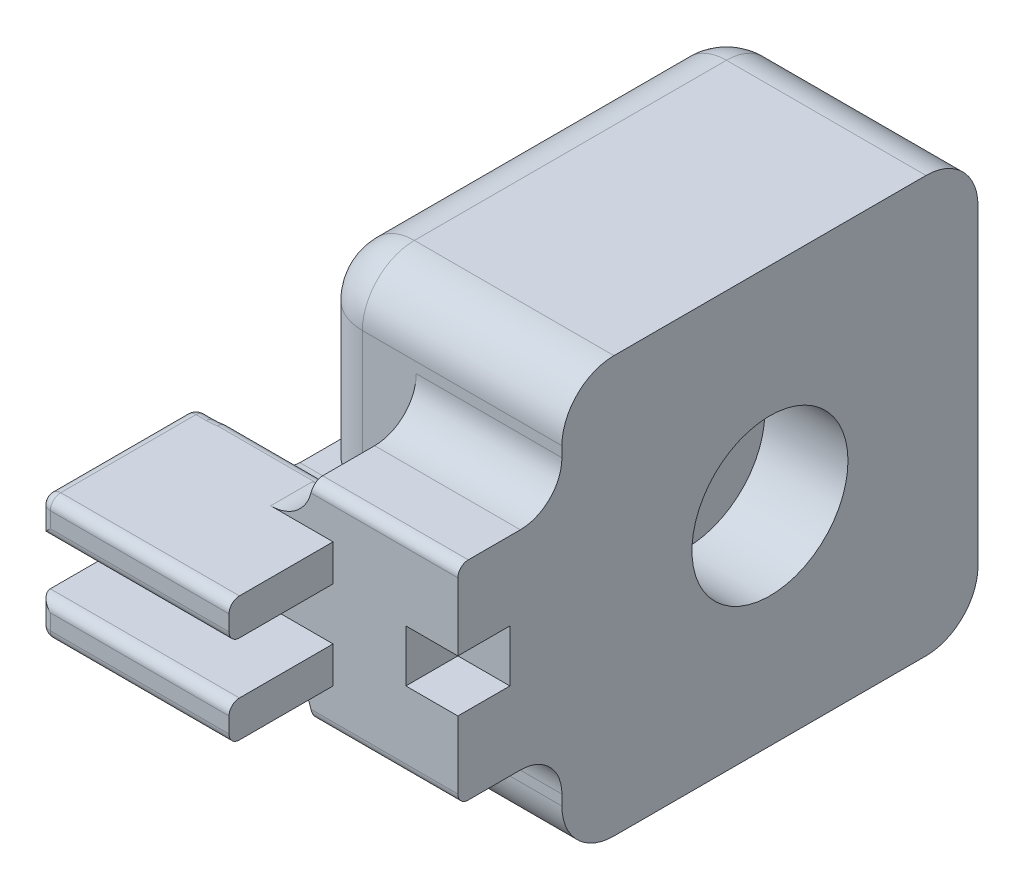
ISO-10303-21;
HEADER;
FILE_DESCRIPTION(('STEP AP214'),'2;1');
FILE_NAME('part.step','',(''),(''),'','','');
FILE_SCHEMA(('AUTOMOTIVE_DESIGN { 1 0 10303 214 1 1 1 1 }'));
ENDSEC;
DATA;
#1=APPLICATION_CONTEXT('core data for automotive mechanical design processes');
#2=APPLICATION_PROTOCOL_DEFINITION('international standard','automotive_design',2000,#1);
#3=PRODUCT_CONTEXT('',#1,'mechanical');
#4=PRODUCT('Part','Part','',(#3));
#5=PRODUCT_RELATED_PRODUCT_CATEGORY('part','',(#4));
#6=PRODUCT_DEFINITION_FORMATION('','',#4);
#7=PRODUCT_DEFINITION_CONTEXT('part definition',#1,'design');
#8=PRODUCT_DEFINITION('design','',#6,#7);
#9=PRODUCT_DEFINITION_SHAPE('','',#8);
#10=(LENGTH_UNIT() NAMED_UNIT(*) SI_UNIT(.MILLI.,.METRE.));
#11=(NAMED_UNIT(*) PLANE_ANGLE_UNIT() SI_UNIT($,.RADIAN.));
#12=(NAMED_UNIT(*) SI_UNIT($,.STERADIAN.) SOLID_ANGLE_UNIT());
#13=UNCERTAINTY_MEASURE_WITH_UNIT(LENGTH_MEASURE(1.E-05),#10,'distance_accuracy_value','');
#14=(GEOMETRIC_REPRESENTATION_CONTEXT(3) GLOBAL_UNCERTAINTY_ASSIGNED_CONTEXT((#13)) GLOBAL_UNIT_ASSIGNED_CONTEXT((#10,
#11,#12)) REPRESENTATION_CONTEXT('',''));
#15=CARTESIAN_POINT('',(0.,0.,0.));
#16=DIRECTION('',(0.,0.,1.));
#17=DIRECTION('',(1.,0.,0.));
#18=AXIS2_PLACEMENT_3D('',#15,#16,#17);
#19=CARTESIAN_POINT('',(111.76,-7.61999999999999,-6.35));
#20=DIRECTION('',(-1.,0.,0.));
#21=DIRECTION('',(0.,-1.,0.));
#22=AXIS2_PLACEMENT_3D('',#19,#20,#21);
#23=PLANE('',#22);
#24=DIRECTION('',(0.,1.,0.));
#25=VECTOR('',#24,1.);
#26=CARTESIAN_POINT('',(111.76,-7.61999999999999,12.7));
#27=LINE('',#26,#25);
#28=CARTESIAN_POINT('',(111.76,-6.34999999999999,12.7));
#29=VERTEX_POINT('',#28);
#30=CARTESIAN_POINT('',(111.76,-4.44499999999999,12.7));
#31=VERTEX_POINT('',#30);
#32=EDGE_CURVE('E426',#29,#31,#27,.T.);
#33=ORIENTED_EDGE('',*,*,#32,.F.);
#34=CARTESIAN_POINT('',(111.76,-6.34999999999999,11.43));
#35=DIRECTION('',(-1.,0.,0.));
#36=DIRECTION('',(0.,-1.,0.));
#37=AXIS2_PLACEMENT_3D('',#34,#35,#36);
#38=CIRCLE('',#37,1.27);
#39=CARTESIAN_POINT('',(111.76,-7.61999999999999,11.43));
#40=VERTEX_POINT('',#39);
#41=EDGE_CURVE('E945',#29,#40,#38,.F.);
#42=ORIENTED_EDGE('',*,*,#41,.T.);
#43=DIRECTION('',(0.,0.,1.));
#44=VECTOR('',#43,1.);
#45=CARTESIAN_POINT('',(111.76,-7.61999999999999,-6.35));
#46=LINE('',#45,#44);
#47=CARTESIAN_POINT('',(111.76,-7.61999999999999,0.));
#48=VERTEX_POINT('',#47);
#49=EDGE_CURVE('E423',#48,#40,#46,.T.);
#50=ORIENTED_EDGE('',*,*,#49,.F.);
#51=DIRECTION('',(0.,-1.,0.));
#52=VECTOR('',#51,1.);
#53=CARTESIAN_POINT('',(111.76,-7.61999999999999,0.));
#54=LINE('',#53,#52);
#55=CARTESIAN_POINT('',(111.76,-3.17499999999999,0.));
#56=VERTEX_POINT('',#55);
#57=EDGE_CURVE('E1078',#56,#48,#54,.T.);
#58=ORIENTED_EDGE('',*,*,#57,.F.);
#59=DIRECTION('',(0.,0.,1.));
#60=VECTOR('',#59,1.);
#61=CARTESIAN_POINT('',(111.76,-3.17499999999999,-23.9483453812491));
#62=LINE('',#61,#60);
#63=CARTESIAN_POINT('',(111.76,-3.17499999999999,11.43));
#64=VERTEX_POINT('',#63);
#65=EDGE_CURVE('E407',#56,#64,#62,.T.);
#66=ORIENTED_EDGE('',*,*,#65,.T.);
#67=CARTESIAN_POINT('',(111.76,-4.44499999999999,11.43));
#68=DIRECTION('',(-1.,0.,0.));
#69=DIRECTION('',(0.,-1.,0.));
#70=AXIS2_PLACEMENT_3D('',#67,#68,#69);
#71=CIRCLE('',#70,1.27);
#72=EDGE_CURVE('E943',#64,#31,#71,.F.);
#73=ORIENTED_EDGE('',*,*,#72,.T.);
#74=EDGE_LOOP('',(#33,#42,#50,#58,#66,#73));
#75=FACE_BOUND('',#74,.T.);
#76=ADVANCED_FACE('F39',(#75),#23,.F.);
#77=CARTESIAN_POINT('',(111.76,7.61999999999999,-6.35));
#78=DIRECTION('',(1.,0.,0.));
#79=DIRECTION('',(0.,1.,0.));
#80=AXIS2_PLACEMENT_3D('',#77,#78,#79);
#81=PLANE('',#80);
#82=DIRECTION('',(0.,0.,1.));
#83=VECTOR('',#82,1.);
#84=CARTESIAN_POINT('',(111.76,7.61999999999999,-6.35));
#85=LINE('',#84,#83);
#86=CARTESIAN_POINT('',(111.76,7.61999999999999,0.));
#87=VERTEX_POINT('',#86);
#88=CARTESIAN_POINT('',(111.76,7.61999999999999,11.43));
#89=VERTEX_POINT('',#88);
#90=EDGE_CURVE('E377',#87,#89,#85,.T.);
#91=ORIENTED_EDGE('',*,*,#90,.T.);
#92=CARTESIAN_POINT('',(111.76,6.34999999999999,11.43));
#93=DIRECTION('',(1.,0.,0.));
#94=DIRECTION('',(0.,1.,0.));
#95=AXIS2_PLACEMENT_3D('',#92,#93,#94);
#96=CIRCLE('',#95,1.27);
#97=CARTESIAN_POINT('',(111.76,6.34999999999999,12.7));
#98=VERTEX_POINT('',#97);
#99=EDGE_CURVE('E955',#89,#98,#96,.T.);
#100=ORIENTED_EDGE('',*,*,#99,.T.);
#101=DIRECTION('',(0.,-1.,0.));
#102=VECTOR('',#101,1.);
#103=CARTESIAN_POINT('',(111.76,7.61999999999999,12.7));
#104=LINE('',#103,#102);
#105=CARTESIAN_POINT('',(111.76,4.44499999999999,12.7));
#106=VERTEX_POINT('',#105);
#107=EDGE_CURVE('E389',#98,#106,#104,.T.);
#108=ORIENTED_EDGE('',*,*,#107,.T.);
#109=CARTESIAN_POINT('',(111.76,4.44499999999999,11.43));
#110=DIRECTION('',(1.,0.,0.));
#111=DIRECTION('',(0.,1.,0.));
#112=AXIS2_PLACEMENT_3D('',#109,#110,#111);
#113=CIRCLE('',#112,1.27);
#114=CARTESIAN_POINT('',(111.76,3.17499999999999,11.43));
#115=VERTEX_POINT('',#114);
#116=EDGE_CURVE('E953',#106,#115,#113,.T.);
#117=ORIENTED_EDGE('',*,*,#116,.T.);
#118=DIRECTION('',(0.,0.,1.));
#119=VECTOR('',#118,1.);
#120=CARTESIAN_POINT('',(111.76,3.17499999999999,-23.9483453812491));
#121=LINE('',#120,#119);
#122=CARTESIAN_POINT('',(111.76,3.17499999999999,0.));
#123=VERTEX_POINT('',#122);
#124=EDGE_CURVE('E397',#123,#115,#121,.T.);
#125=ORIENTED_EDGE('',*,*,#124,.F.);
#126=DIRECTION('',(0.,1.,0.));
#127=VECTOR('',#126,1.);
#128=CARTESIAN_POINT('',(111.76,7.61999999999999,0.));
#129=LINE('',#128,#127);
#130=EDGE_CURVE('E394',#123,#87,#129,.T.);
#131=ORIENTED_EDGE('',*,*,#130,.T.);
#132=EDGE_LOOP('',(#91,#100,#108,#117,#125,#131));
#133=FACE_BOUND('',#132,.T.);
#134=ADVANCED_FACE('F395',(#133),#81,.T.);
#135=CARTESIAN_POINT('',(127.,-2.53999999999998,203.2));
#136=DIRECTION('',(0.,1.,0.));
#137=DIRECTION('',(-1.,0.,0.));
#138=AXIS2_PLACEMENT_3D('',#135,#136,#137);
#139=PLANE('',#138);
#140=DIRECTION('',(0.,0.,-1.));
#141=VECTOR('',#140,1.);
#142=CARTESIAN_POINT('',(109.22,-2.53999999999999,203.2));
#143=LINE('',#142,#141);
#144=CARTESIAN_POINT('',(109.22,-2.53999999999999,-12.7));
#145=VERTEX_POINT('',#144);
#146=CARTESIAN_POINT('',(109.22,-2.53999999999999,-11.43));
#147=VERTEX_POINT('',#146);
#148=EDGE_CURVE('E505',#145,#147,#143,.F.);
#149=ORIENTED_EDGE('',*,*,#148,.T.);
#150=DIRECTION('',(1.,0.,0.));
#151=VECTOR('',#150,1.);
#152=CARTESIAN_POINT('',(96.2888600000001,-2.53999999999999,-11.43));
#153=LINE('',#152,#151);
#154=CARTESIAN_POINT('',(96.2888600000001,-2.53999999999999,-11.43));
#155=VERTEX_POINT('',#154);
#156=EDGE_CURVE('E620',#147,#155,#153,.F.);
#157=ORIENTED_EDGE('',*,*,#156,.T.);
#158=DIRECTION('',(0.,0.,1.));
#159=VECTOR('',#158,1.);
#160=CARTESIAN_POINT('',(96.2888600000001,-2.53999999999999,203.2));
#161=LINE('',#160,#159);
#162=CARTESIAN_POINT('',(96.2888600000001,-2.53999999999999,-19.05));
#163=VERTEX_POINT('',#162);
#164=EDGE_CURVE('E511',#163,#155,#161,.T.);
#165=ORIENTED_EDGE('',*,*,#164,.F.);
#166=CARTESIAN_POINT('',(102.63886,-2.53999999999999,-19.05));
#167=DIRECTION('',(0.,1.,0.));
#168=DIRECTION('',(-1.,0.,0.));
#169=AXIS2_PLACEMENT_3D('',#166,#167,#168);
#170=CIRCLE('',#169,6.35);
#171=CARTESIAN_POINT('',(102.63886,-2.53999999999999,-12.7));
#172=VERTEX_POINT('',#171);
#173=EDGE_CURVE('E566',#163,#172,#170,.T.);
#174=ORIENTED_EDGE('',*,*,#173,.T.);
#175=DIRECTION('',(1.,0.,0.));
#176=VECTOR('',#175,1.);
#177=CARTESIAN_POINT('',(127.,-2.53999999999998,-12.7));
#178=LINE('',#177,#176);
#179=EDGE_CURVE('E496',#172,#145,#178,.T.);
#180=ORIENTED_EDGE('',*,*,#179,.T.);
#181=EDGE_LOOP('',(#149,#157,#165,#174,#180));
#182=FACE_BOUND('',#181,.T.);
#183=ADVANCED_FACE('F1185',(#182),#139,.F.);
#184=CARTESIAN_POINT('',(-46.2514429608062,-25.4,0.));
#185=DIRECTION('',(0.,0.,-1.));
#186=DIRECTION('',(-1.,0.,0.));
#187=AXIS2_PLACEMENT_3D('',#184,#185,#186);
#188=PLANE('',#187);
#189=DIRECTION('',(0.,-1.,0.));
#190=VECTOR('',#189,1.);
#191=CARTESIAN_POINT('',(127.,2.54000000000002,0.));
#192=LINE('',#191,#190);
#193=CARTESIAN_POINT('',(127.,11.43,0.));
#194=VERTEX_POINT('',#193);
#195=CARTESIAN_POINT('',(127.,3.17499999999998,0.));
#196=VERTEX_POINT('',#195);
#197=EDGE_CURVE('E460',#194,#196,#192,.T.);
#198=ORIENTED_EDGE('',*,*,#197,.F.);
#199=DIRECTION('',(1.,0.,0.));
#200=VECTOR('',#199,1.);
#201=CARTESIAN_POINT('',(-46.2514429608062,11.43,0.));
#202=LINE('',#201,#200);
#203=CARTESIAN_POINT('',(109.058688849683,11.43,0.));
#204=VERTEX_POINT('',#203);
#205=EDGE_CURVE('E980',#194,#204,#202,.F.);
#206=ORIENTED_EDGE('',*,*,#205,.T.);
#207=CARTESIAN_POINT('',(104.14,12.7,0.));
#208=DIRECTION('',(0.,0.,-1.));
#209=DIRECTION('',(-1.,0.,0.));
#210=AXIS2_PLACEMENT_3D('',#207,#208,#209);
#211=CIRCLE('',#210,5.08);
#212=CARTESIAN_POINT('',(104.14,7.61999999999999,0.));
#213=VERTEX_POINT('',#212);
#214=EDGE_CURVE('E404',#204,#213,#211,.T.);
#215=ORIENTED_EDGE('',*,*,#214,.T.);
#216=DIRECTION('',(1.,0.,0.));
#217=VECTOR('',#216,1.);
#218=CARTESIAN_POINT('',(0.,7.62,0.));
#219=LINE('',#218,#217);
#220=EDGE_CURVE('E383',#213,#87,#219,.T.);
#221=ORIENTED_EDGE('',*,*,#220,.T.);
#222=ORIENTED_EDGE('',*,*,#130,.F.);
#223=DIRECTION('',(-1.,0.,0.));
#224=VECTOR('',#223,1.);
#225=CARTESIAN_POINT('',(111.76,3.17499999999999,0.));
#226=LINE('',#225,#224);
#227=CARTESIAN_POINT('',(88.6688600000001,3.17499999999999,0.));
#228=VERTEX_POINT('',#227);
#229=EDGE_CURVE('E411',#123,#228,#226,.T.);
#230=ORIENTED_EDGE('',*,*,#229,.T.);
#231=DIRECTION('',(0.,-1.,0.));
#232=VECTOR('',#231,1.);
#233=CARTESIAN_POINT('',(88.6688600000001,-25.4,0.));
#234=LINE('',#233,#232);
#235=CARTESIAN_POINT('',(88.6688600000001,-3.17499999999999,0.));
#236=VERTEX_POINT('',#235);
#237=EDGE_CURVE('E568',#228,#236,#234,.T.);
#238=ORIENTED_EDGE('',*,*,#237,.T.);
#239=DIRECTION('',(1.,0.,0.));
#240=VECTOR('',#239,1.);
#241=CARTESIAN_POINT('',(111.76,-3.17499999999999,0.));
#242=LINE('',#241,#240);
#243=EDGE_CURVE('E405',#236,#56,#242,.T.);
#244=ORIENTED_EDGE('',*,*,#243,.T.);
#245=ORIENTED_EDGE('',*,*,#57,.T.);
#246=DIRECTION('',(-1.,0.,0.));
#247=VECTOR('',#246,1.);
#248=CARTESIAN_POINT('',(0.,-7.62,0.));
#249=LINE('',#248,#247);
#250=CARTESIAN_POINT('',(104.14,-7.61999999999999,0.));
#251=VERTEX_POINT('',#250);
#252=EDGE_CURVE('E399',#48,#251,#249,.T.);
#253=ORIENTED_EDGE('',*,*,#252,.T.);
#254=CARTESIAN_POINT('',(104.14,-12.7,0.));
#255=DIRECTION('',(0.,0.,-1.));
#256=DIRECTION('',(-1.,0.,0.));
#257=AXIS2_PLACEMENT_3D('',#254,#255,#256);
#258=CIRCLE('',#257,5.08);
#259=CARTESIAN_POINT('',(109.058688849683,-11.43,0.));
#260=VERTEX_POINT('',#259);
#261=EDGE_CURVE('E625',#251,#260,#258,.T.);
#262=ORIENTED_EDGE('',*,*,#261,.T.);
#263=DIRECTION('',(1.,0.,0.));
#264=VECTOR('',#263,1.);
#265=CARTESIAN_POINT('',(127.,-11.43,0.));
#266=LINE('',#265,#264);
#267=CARTESIAN_POINT('',(127.,-11.43,0.));
#268=VERTEX_POINT('',#267);
#269=EDGE_CURVE('E977',#260,#268,#266,.T.);
#270=ORIENTED_EDGE('',*,*,#269,.T.);
#271=CARTESIAN_POINT('',(127.,-3.17500000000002,0.));
#272=VERTEX_POINT('',#271);
#273=EDGE_CURVE('E453',#272,#268,#192,.T.);
#274=ORIENTED_EDGE('',*,*,#273,.F.);
#275=DIRECTION('',(1.,0.,0.));
#276=VECTOR('',#275,1.);
#277=CARTESIAN_POINT('',(120.65,-3.17500000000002,0.));
#278=LINE('',#277,#276);
#279=CARTESIAN_POINT('',(120.65,-3.17500000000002,0.));
#280=VERTEX_POINT('',#279);
#281=EDGE_CURVE('E434',#280,#272,#278,.T.);
#282=ORIENTED_EDGE('',*,*,#281,.F.);
#283=DIRECTION('',(0.,-1.,0.));
#284=VECTOR('',#283,1.);
#285=CARTESIAN_POINT('',(120.65,-3.17500000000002,0.));
#286=LINE('',#285,#284);
#287=CARTESIAN_POINT('',(120.65,3.17499999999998,0.));
#288=VERTEX_POINT('',#287);
#289=EDGE_CURVE('E446',#288,#280,#286,.T.);
#290=ORIENTED_EDGE('',*,*,#289,.F.);
#291=DIRECTION('',(-1.,0.,0.));
#292=VECTOR('',#291,1.);
#293=CARTESIAN_POINT('',(120.65,3.17499999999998,0.));
#294=LINE('',#293,#292);
#295=EDGE_CURVE('E429',#196,#288,#294,.T.);
#296=ORIENTED_EDGE('',*,*,#295,.F.);
#297=EDGE_LOOP('',(#198,#206,#215,#221,#222,#230,#238,#244,#245,#253,#262,#270,#274,#282,#290,#296));
#298=FACE_BOUND('',#297,.T.);
#299=ADVANCED_FACE('F402',(#298),#188,.F.);
#300=CARTESIAN_POINT('',(127.001,0.,-38.1));
#301=DIRECTION('',(-1.,0.,0.));
#302=DIRECTION('',(0.,-1.,0.));
#303=AXIS2_PLACEMENT_3D('',#300,#301,#302);
#304=CYLINDRICAL_SURFACE('',#303,4.00000000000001);
#305=CARTESIAN_POINT('',(93.7488600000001,0.,-38.1));
#306=DIRECTION('',(-1.,0.,0.));
#307=DIRECTION('',(0.,-1.,0.));
#308=AXIS2_PLACEMENT_3D('',#305,#306,#307);
#309=CIRCLE('',#308,4.00000000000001);
#310=CARTESIAN_POINT('',(93.7488600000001,-4.,-38.1));
#311=VERTEX_POINT('',#310);
#312=EDGE_CURVE('E477',#311,#311,#309,.T.);
#313=ORIENTED_EDGE('',*,*,#312,.T.);
#314=EDGE_LOOP('',(#313));
#315=FACE_BOUND('',#314,.T.);
#316=CARTESIAN_POINT('',(116.84,0.,-38.1));
#317=DIRECTION('',(1.,0.,0.));
#318=DIRECTION('',(0.,0.,-1.));
#319=AXIS2_PLACEMENT_3D('',#316,#317,#318);
#320=CIRCLE('',#319,4.00000000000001);
#321=CARTESIAN_POINT('',(116.84,0.,-42.1));
#322=VERTEX_POINT('',#321);
#323=EDGE_CURVE('E466',#322,#322,#320,.F.);
#324=ORIENTED_EDGE('',*,*,#323,.F.);
#325=EDGE_LOOP('',(#324));
#326=FACE_BOUND('',#325,.T.);
#327=ADVANCED_FACE('F1204',(#315,#326),#304,.F.);
#328=CARTESIAN_POINT('',(198.842048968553,-25.4,-12.7));
#329=DIRECTION('',(0.,0.,1.));
#330=DIRECTION('',(0.,-1.,0.));
#331=AXIS2_PLACEMENT_3D('',#328,#329,#330);
#332=PLANE('',#331);
#333=DIRECTION('',(0.,-1.,0.));
#334=VECTOR('',#333,1.);
#335=CARTESIAN_POINT('',(109.22,-25.4,-12.7));
#336=LINE('',#335,#334);
#337=CARTESIAN_POINT('',(109.22,2.54000000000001,-12.7));
#338=VERTEX_POINT('',#337);
#339=CARTESIAN_POINT('',(109.22,17.78,-12.7));
#340=VERTEX_POINT('',#339);
#341=EDGE_CURVE('E498',#338,#340,#336,.F.);
#342=ORIENTED_EDGE('',*,*,#341,.T.);
#343=DIRECTION('',(-1.,0.,0.));
#344=VECTOR('',#343,1.);
#345=CARTESIAN_POINT('',(198.842048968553,17.78,-12.7));
#346=LINE('',#345,#344);
#347=CARTESIAN_POINT('',(127.,17.78,-12.7));
#348=VERTEX_POINT('',#347);
#349=EDGE_CURVE('E644',#340,#348,#346,.F.);
#350=ORIENTED_EDGE('',*,*,#349,.T.);
#351=DIRECTION('',(0.,-1.,0.));
#352=VECTOR('',#351,1.);
#353=CARTESIAN_POINT('',(127.,-25.4,-12.7));
#354=LINE('',#353,#352);
#355=CARTESIAN_POINT('',(127.,19.05,-12.7));
#356=VERTEX_POINT('',#355);
#357=EDGE_CURVE('E481',#356,#348,#354,.T.);
#358=ORIENTED_EDGE('',*,*,#357,.F.);
#359=DIRECTION('',(-1.,0.,0.));
#360=VECTOR('',#359,1.);
#361=CARTESIAN_POINT('',(198.842048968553,19.05,-12.7));
#362=LINE('',#361,#360);
#363=CARTESIAN_POINT('',(102.63886,19.05,-12.7));
#364=VERTEX_POINT('',#363);
#365=EDGE_CURVE('E546',#356,#364,#362,.T.);
#366=ORIENTED_EDGE('',*,*,#365,.T.);
#367=DIRECTION('',(0.,1.,0.));
#368=VECTOR('',#367,1.);
#369=CARTESIAN_POINT('',(102.63886,-25.4,-12.7));
#370=LINE('',#369,#368);
#371=CARTESIAN_POINT('',(102.63886,2.54000000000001,-12.7));
#372=VERTEX_POINT('',#371);
#373=EDGE_CURVE('E548',#364,#372,#370,.F.);
#374=ORIENTED_EDGE('',*,*,#373,.T.);
#375=DIRECTION('',(-1.,0.,0.));
#376=VECTOR('',#375,1.);
#377=CARTESIAN_POINT('',(127.,2.54000000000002,-12.7));
#378=LINE('',#377,#376);
#379=EDGE_CURVE('E493',#338,#372,#378,.T.);
#380=ORIENTED_EDGE('',*,*,#379,.F.);
#381=EDGE_LOOP('',(#342,#350,#358,#366,#374,#380));
#382=FACE_BOUND('',#381,.T.);
#383=ADVANCED_FACE('F1131',(#382),#332,.T.);
#384=CARTESIAN_POINT('',(127.,2.54000000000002,203.2));
#385=DIRECTION('',(0.,-1.,0.));
#386=DIRECTION('',(1.,0.,0.));
#387=AXIS2_PLACEMENT_3D('',#384,#385,#386);
#388=PLANE('',#387);
#389=DIRECTION('',(0.,0.,-1.));
#390=VECTOR('',#389,1.);
#391=CARTESIAN_POINT('',(96.2888600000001,2.54000000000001,203.2));
#392=LINE('',#391,#390);
#393=CARTESIAN_POINT('',(96.2888600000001,2.54000000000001,-11.43));
#394=VERTEX_POINT('',#393);
#395=CARTESIAN_POINT('',(96.2888600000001,2.54000000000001,-19.05));
#396=VERTEX_POINT('',#395);
#397=EDGE_CURVE('E526',#394,#396,#392,.T.);
#398=ORIENTED_EDGE('',*,*,#397,.F.);
#399=DIRECTION('',(1.,0.,0.));
#400=VECTOR('',#399,1.);
#401=CARTESIAN_POINT('',(109.22,2.54000000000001,-11.43));
#402=LINE('',#401,#400);
#403=CARTESIAN_POINT('',(109.22,2.54000000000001,-11.43));
#404=VERTEX_POINT('',#403);
#405=EDGE_CURVE('E615',#394,#404,#402,.T.);
#406=ORIENTED_EDGE('',*,*,#405,.T.);
#407=DIRECTION('',(0.,0.,-1.));
#408=VECTOR('',#407,1.);
#409=CARTESIAN_POINT('',(109.22,2.54000000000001,-12.7));
#410=LINE('',#409,#408);
#411=EDGE_CURVE('E503',#404,#338,#410,.T.);
#412=ORIENTED_EDGE('',*,*,#411,.T.);
#413=ORIENTED_EDGE('',*,*,#379,.T.);
#414=CARTESIAN_POINT('',(102.63886,2.54000000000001,-19.05));
#415=DIRECTION('',(0.,-1.,0.));
#416=DIRECTION('',(1.,0.,0.));
#417=AXIS2_PLACEMENT_3D('',#414,#415,#416);
#418=CIRCLE('',#417,6.35);
#419=EDGE_CURVE('E563',#372,#396,#418,.T.);
#420=ORIENTED_EDGE('',*,*,#419,.T.);
#421=EDGE_LOOP('',(#398,#406,#412,#413,#420));
#422=FACE_BOUND('',#421,.T.);
#423=ADVANCED_FACE('F1128',(#422),#388,.F.);
#424=CARTESIAN_POINT('',(127.,-17.78,-12.7));
#425=VERTEX_POINT('',#424);
#426=CARTESIAN_POINT('',(127.,-19.05,-12.7));
#427=VERTEX_POINT('',#426);
#428=EDGE_CURVE('E480',#425,#427,#354,.T.);
#429=ORIENTED_EDGE('',*,*,#428,.F.);
#430=DIRECTION('',(-1.,0.,0.));
#431=VECTOR('',#430,1.);
#432=CARTESIAN_POINT('',(109.22,-17.78,-12.7));
#433=LINE('',#432,#431);
#434=CARTESIAN_POINT('',(109.22,-17.78,-12.7));
#435=VERTEX_POINT('',#434);
#436=EDGE_CURVE('E646',#425,#435,#433,.T.);
#437=ORIENTED_EDGE('',*,*,#436,.T.);
#438=DIRECTION('',(0.,1.,0.));
#439=VECTOR('',#438,1.);
#440=CARTESIAN_POINT('',(109.22,-2.53999999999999,-12.7));
#441=LINE('',#440,#439);
#442=EDGE_CURVE('E500',#435,#145,#441,.T.);
#443=ORIENTED_EDGE('',*,*,#442,.T.);
#444=ORIENTED_EDGE('',*,*,#179,.F.);
#445=DIRECTION('',(0.,1.,0.));
#446=VECTOR('',#445,1.);
#447=CARTESIAN_POINT('',(102.63886,-25.4,-12.7));
#448=LINE('',#447,#446);
#449=CARTESIAN_POINT('',(102.63886,-19.05,-12.7));
#450=VERTEX_POINT('',#449);
#451=EDGE_CURVE('E553',#172,#450,#448,.F.);
#452=ORIENTED_EDGE('',*,*,#451,.T.);
#453=DIRECTION('',(-1.,0.,0.));
#454=VECTOR('',#453,1.);
#455=CARTESIAN_POINT('',(198.842048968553,-19.05,-12.7));
#456=LINE('',#455,#454);
#457=EDGE_CURVE('E550',#450,#427,#456,.F.);
#458=ORIENTED_EDGE('',*,*,#457,.T.);
#459=EDGE_LOOP('',(#429,#437,#443,#444,#452,#458));
#460=FACE_BOUND('',#459,.T.);
#461=ADVANCED_FACE('F1231',(#460),#332,.T.);
#462=CARTESIAN_POINT('',(198.842048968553,25.4,-12.7));
#463=DIRECTION('',(0.,1.,0.));
#464=DIRECTION('',(0.,0.,1.));
#465=AXIS2_PLACEMENT_3D('',#462,#463,#464);
#466=PLANE('',#465);
#467=DIRECTION('',(0.,0.,-1.));
#468=VECTOR('',#467,1.);
#469=CARTESIAN_POINT('',(102.63886,25.4,-12.7));
#470=LINE('',#469,#468);
#471=CARTESIAN_POINT('',(102.63886,25.4,-57.15));
#472=VERTEX_POINT('',#471);
#473=CARTESIAN_POINT('',(102.63886,25.4,-19.05));
#474=VERTEX_POINT('',#473);
#475=EDGE_CURVE('E542',#472,#474,#470,.F.);
#476=ORIENTED_EDGE('',*,*,#475,.T.);
#477=DIRECTION('',(-1.,0.,0.));
#478=VECTOR('',#477,1.);
#479=CARTESIAN_POINT('',(198.842048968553,25.4,-19.05));
#480=LINE('',#479,#478);
#481=CARTESIAN_POINT('',(127.,25.4,-19.05));
#482=VERTEX_POINT('',#481);
#483=EDGE_CURVE('E544',#474,#482,#480,.F.);
#484=ORIENTED_EDGE('',*,*,#483,.T.);
#485=DIRECTION('',(0.,0.,1.));
#486=VECTOR('',#485,1.);
#487=CARTESIAN_POINT('',(127.,25.4,-12.7));
#488=LINE('',#487,#486);
#489=CARTESIAN_POINT('',(127.,25.4,-57.15));
#490=VERTEX_POINT('',#489);
#491=EDGE_CURVE('E484',#490,#482,#488,.T.);
#492=ORIENTED_EDGE('',*,*,#491,.F.);
#493=DIRECTION('',(-1.,0.,0.));
#494=VECTOR('',#493,1.);
#495=CARTESIAN_POINT('',(198.842048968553,25.4,-57.15));
#496=LINE('',#495,#494);
#497=EDGE_CURVE('E540',#490,#472,#496,.T.);
#498=ORIENTED_EDGE('',*,*,#497,.T.);
#499=EDGE_LOOP('',(#476,#484,#492,#498));
#500=FACE_BOUND('',#499,.T.);
#501=ADVANCED_FACE('F1227',(#500),#466,.T.);
#502=CARTESIAN_POINT('',(198.842048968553,-25.4,-63.5));
#503=DIRECTION('',(0.,0.,-1.));
#504=DIRECTION('',(-1.,0.,0.));
#505=AXIS2_PLACEMENT_3D('',#502,#503,#504);
#506=PLANE('',#505);
#507=DIRECTION('',(0.,-1.,0.));
#508=VECTOR('',#507,1.);
#509=CARTESIAN_POINT('',(102.63886,-25.4,-63.5));
#510=LINE('',#509,#508);
#511=CARTESIAN_POINT('',(102.63886,-19.05,-63.5));
#512=VERTEX_POINT('',#511);
#513=CARTESIAN_POINT('',(102.63886,19.05,-63.5));
#514=VERTEX_POINT('',#513);
#515=EDGE_CURVE('E536',#512,#514,#510,.F.);
#516=ORIENTED_EDGE('',*,*,#515,.T.);
#517=DIRECTION('',(-1.,0.,0.));
#518=VECTOR('',#517,1.);
#519=CARTESIAN_POINT('',(198.842048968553,19.05,-63.5));
#520=LINE('',#519,#518);
#521=CARTESIAN_POINT('',(127.,19.05,-63.5));
#522=VERTEX_POINT('',#521);
#523=EDGE_CURVE('E538',#514,#522,#520,.F.);
#524=ORIENTED_EDGE('',*,*,#523,.T.);
#525=DIRECTION('',(0.,1.,0.));
#526=VECTOR('',#525,1.);
#527=CARTESIAN_POINT('',(127.,-25.4,-63.5));
#528=LINE('',#527,#526);
#529=CARTESIAN_POINT('',(127.,-19.05,-63.5));
#530=VERTEX_POINT('',#529);
#531=EDGE_CURVE('E487',#530,#522,#528,.T.);
#532=ORIENTED_EDGE('',*,*,#531,.F.);
#533=DIRECTION('',(-1.,0.,0.));
#534=VECTOR('',#533,1.);
#535=CARTESIAN_POINT('',(198.842048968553,-19.05,-63.5));
#536=LINE('',#535,#534);
#537=EDGE_CURVE('E534',#530,#512,#536,.T.);
#538=ORIENTED_EDGE('',*,*,#537,.T.);
#539=EDGE_LOOP('',(#516,#524,#532,#538));
#540=FACE_BOUND('',#539,.T.);
#541=ADVANCED_FACE('F1230',(#540),#506,.T.);
#542=CARTESIAN_POINT('',(198.842048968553,-25.4,-12.7));
#543=DIRECTION('',(0.,-1.,0.));
#544=DIRECTION('',(0.,0.,-1.));
#545=AXIS2_PLACEMENT_3D('',#542,#543,#544);
#546=PLANE('',#545);
#547=DIRECTION('',(0.,0.,1.));
#548=VECTOR('',#547,1.);
#549=CARTESIAN_POINT('',(102.63886,-25.4,-12.7));
#550=LINE('',#549,#548);
#551=CARTESIAN_POINT('',(102.63886,-25.4,-19.05));
#552=VERTEX_POINT('',#551);
#553=CARTESIAN_POINT('',(102.63886,-25.4,-57.15));
#554=VERTEX_POINT('',#553);
#555=EDGE_CURVE('E530',#552,#554,#550,.F.);
#556=ORIENTED_EDGE('',*,*,#555,.T.);
#557=DIRECTION('',(-1.,0.,0.));
#558=VECTOR('',#557,1.);
#559=CARTESIAN_POINT('',(198.842048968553,-25.4,-57.15));
#560=LINE('',#559,#558);
#561=CARTESIAN_POINT('',(127.,-25.4,-57.15));
#562=VERTEX_POINT('',#561);
#563=EDGE_CURVE('E532',#554,#562,#560,.F.);
#564=ORIENTED_EDGE('',*,*,#563,.T.);
#565=DIRECTION('',(0.,0.,-1.));
#566=VECTOR('',#565,1.);
#567=CARTESIAN_POINT('',(127.,-25.4,-12.7));
#568=LINE('',#567,#566);
#569=CARTESIAN_POINT('',(127.,-25.4,-19.05));
#570=VERTEX_POINT('',#569);
#571=EDGE_CURVE('E490',#570,#562,#568,.T.);
#572=ORIENTED_EDGE('',*,*,#571,.F.);
#573=DIRECTION('',(-1.,0.,0.));
#574=VECTOR('',#573,1.);
#575=CARTESIAN_POINT('',(198.842048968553,-25.4,-19.05));
#576=LINE('',#575,#574);
#577=EDGE_CURVE('E528',#570,#552,#576,.T.);
#578=ORIENTED_EDGE('',*,*,#577,.T.);
#579=EDGE_LOOP('',(#556,#564,#572,#578));
#580=FACE_BOUND('',#579,.T.);
#581=ADVANCED_FACE('F1222',(#580),#546,.T.);
#582=CARTESIAN_POINT('',(93.7488600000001,0.,0.));
#583=DIRECTION('',(-1.,0.,0.));
#584=DIRECTION('',(0.,0.,1.));
#585=AXIS2_PLACEMENT_3D('',#582,#583,#584);
#586=PLANE('',#585);
#587=ORIENTED_EDGE('',*,*,#312,.F.);
#588=EDGE_LOOP('',(#587));
#589=FACE_BOUND('',#588,.T.);
#590=CARTESIAN_POINT('',(93.7488600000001,0.,-38.1));
#591=DIRECTION('',(-1.,0.,0.));
#592=DIRECTION('',(0.,0.,1.));
#593=AXIS2_PLACEMENT_3D('',#590,#591,#592);
#594=CIRCLE('',#593,8.255);
#595=CARTESIAN_POINT('',(93.7488600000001,0.,-29.845));
#596=VERTEX_POINT('',#595);
#597=EDGE_CURVE('E474',#596,#596,#594,.T.);
#598=ORIENTED_EDGE('',*,*,#597,.T.);
#599=EDGE_LOOP('',(#598));
#600=FACE_BOUND('',#599,.T.);
#601=ADVANCED_FACE('F1219',(#589,#600),#586,.T.);
#602=CARTESIAN_POINT('',(127.,2.54000000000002,203.2));
#603=DIRECTION('',(-1.,0.,0.));
#604=DIRECTION('',(0.,0.,1.));
#605=AXIS2_PLACEMENT_3D('',#602,#603,#604);
#606=PLANE('',#605);
#607=CARTESIAN_POINT('',(127.,0.,-38.1));
#608=DIRECTION('',(1.,0.,0.));
#609=DIRECTION('',(0.,0.,-1.));
#610=AXIS2_PLACEMENT_3D('',#607,#608,#609);
#611=CIRCLE('',#610,9.52500000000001);
#612=CARTESIAN_POINT('',(127.,0.,-47.625));
#613=VERTEX_POINT('',#612);
#614=EDGE_CURVE('E462',#613,#613,#611,.T.);
#615=ORIENTED_EDGE('',*,*,#614,.F.);
#616=EDGE_LOOP('',(#615));
#617=FACE_BOUND('',#616,.T.);
#618=DIRECTION('',(0.,0.,-1.));
#619=VECTOR('',#618,1.);
#620=CARTESIAN_POINT('',(127.,12.7,215.9));
#621=LINE('',#620,#619);
#622=CARTESIAN_POINT('',(127.,12.7,-1.26999999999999));
#623=VERTEX_POINT('',#622);
#624=CARTESIAN_POINT('',(127.,12.7,-7.62000000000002));
#625=VERTEX_POINT('',#624);
#626=EDGE_CURVE('E471',#623,#625,#621,.T.);
#627=ORIENTED_EDGE('',*,*,#626,.F.);
#628=CARTESIAN_POINT('',(127.,11.43,-1.26999999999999));
#629=DIRECTION('',(-1.,0.,0.));
#630=DIRECTION('',(0.,0.,1.));
#631=AXIS2_PLACEMENT_3D('',#628,#629,#630);
#632=CIRCLE('',#631,1.27);
#633=EDGE_CURVE('E975',#623,#194,#632,.F.);
#634=ORIENTED_EDGE('',*,*,#633,.T.);
#635=ORIENTED_EDGE('',*,*,#197,.T.);
#636=DIRECTION('',(0.,0.,1.));
#637=VECTOR('',#636,1.);
#638=CARTESIAN_POINT('',(127.,3.17499999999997,-6.35));
#639=LINE('',#638,#637);
#640=CARTESIAN_POINT('',(127.,3.17499999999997,-6.35));
#641=VERTEX_POINT('',#640);
#642=EDGE_CURVE('E443',#641,#196,#639,.T.);
#643=ORIENTED_EDGE('',*,*,#642,.F.);
#644=DIRECTION('',(0.,1.,0.));
#645=VECTOR('',#644,1.);
#646=CARTESIAN_POINT('',(127.,-3.17500000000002,-6.35));
#647=LINE('',#646,#645);
#648=CARTESIAN_POINT('',(127.,-3.17500000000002,-6.35));
#649=VERTEX_POINT('',#648);
#650=EDGE_CURVE('E430',#649,#641,#647,.T.);
#651=ORIENTED_EDGE('',*,*,#650,.F.);
#652=DIRECTION('',(0.,0.,1.));
#653=VECTOR('',#652,1.);
#654=CARTESIAN_POINT('',(127.,-3.17500000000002,-6.35));
#655=LINE('',#654,#653);
#656=EDGE_CURVE('E450',#649,#272,#655,.T.);
#657=ORIENTED_EDGE('',*,*,#656,.T.);
#658=ORIENTED_EDGE('',*,*,#273,.T.);
#659=CARTESIAN_POINT('',(127.,-11.43,-1.27));
#660=DIRECTION('',(-1.,0.,0.));
#661=DIRECTION('',(0.,0.,1.));
#662=AXIS2_PLACEMENT_3D('',#659,#660,#661);
#663=CIRCLE('',#662,1.27);
#664=CARTESIAN_POINT('',(127.,-12.7,-1.26999999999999));
#665=VERTEX_POINT('',#664);
#666=EDGE_CURVE('E973',#268,#665,#663,.F.);
#667=ORIENTED_EDGE('',*,*,#666,.T.);
#668=DIRECTION('',(0.,0.,-1.));
#669=VECTOR('',#668,1.);
#670=CARTESIAN_POINT('',(127.,-12.7,215.9));
#671=LINE('',#670,#669);
#672=CARTESIAN_POINT('',(127.,-12.7,-7.62000000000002));
#673=VERTEX_POINT('',#672);
#674=EDGE_CURVE('E469',#665,#673,#671,.T.);
#675=ORIENTED_EDGE('',*,*,#674,.T.);
#676=CARTESIAN_POINT('',(127.,-17.78,-7.62000000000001));
#677=DIRECTION('',(-1.,0.,0.));
#678=DIRECTION('',(0.,0.,1.));
#679=AXIS2_PLACEMENT_3D('',#676,#677,#678);
#680=CIRCLE('',#679,5.08);
#681=EDGE_CURVE('E661',#673,#425,#680,.T.);
#682=ORIENTED_EDGE('',*,*,#681,.T.);
#683=ORIENTED_EDGE('',*,*,#428,.T.);
#684=CARTESIAN_POINT('',(127.,-19.05,-19.05));
#685=DIRECTION('',(-1.,0.,0.));
#686=DIRECTION('',(0.,0.,1.));
#687=AXIS2_PLACEMENT_3D('',#684,#685,#686);
#688=CIRCLE('',#687,6.35);
#689=EDGE_CURVE('E555',#427,#570,#688,.F.);
#690=ORIENTED_EDGE('',*,*,#689,.T.);
#691=ORIENTED_EDGE('',*,*,#571,.T.);
#692=CARTESIAN_POINT('',(127.,-19.05,-57.15));
#693=DIRECTION('',(-1.,0.,0.));
#694=DIRECTION('',(0.,0.,1.));
#695=AXIS2_PLACEMENT_3D('',#692,#693,#694);
#696=CIRCLE('',#695,6.35);
#697=EDGE_CURVE('E557',#562,#530,#696,.F.);
#698=ORIENTED_EDGE('',*,*,#697,.T.);
#699=ORIENTED_EDGE('',*,*,#531,.T.);
#700=CARTESIAN_POINT('',(127.,19.05,-57.15));
#701=DIRECTION('',(-1.,0.,0.));
#702=DIRECTION('',(0.,0.,1.));
#703=AXIS2_PLACEMENT_3D('',#700,#701,#702);
#704=CIRCLE('',#703,6.35);
#705=EDGE_CURVE('E559',#522,#490,#704,.F.);
#706=ORIENTED_EDGE('',*,*,#705,.T.);
#707=ORIENTED_EDGE('',*,*,#491,.T.);
#708=CARTESIAN_POINT('',(127.,19.05,-19.05));
#709=DIRECTION('',(-1.,0.,0.));
#710=DIRECTION('',(0.,0.,1.));
#711=AXIS2_PLACEMENT_3D('',#708,#709,#710);
#712=CIRCLE('',#711,6.35);
#713=EDGE_CURVE('E561',#482,#356,#712,.F.);
#714=ORIENTED_EDGE('',*,*,#713,.T.);
#715=ORIENTED_EDGE('',*,*,#357,.T.);
#716=CARTESIAN_POINT('',(127.,17.78,-7.62000000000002));
#717=DIRECTION('',(-1.,0.,0.));
#718=DIRECTION('',(0.,0.,1.));
#719=AXIS2_PLACEMENT_3D('',#716,#717,#718);
#720=CIRCLE('',#719,5.08);
#721=EDGE_CURVE('E655',#348,#625,#720,.T.);
#722=ORIENTED_EDGE('',*,*,#721,.T.);
#723=EDGE_LOOP('',(#627,#634,#635,#643,#651,#657,#658,#667,#675,#682,#683,#690,#691,#698,#699,
#706,#707,#714,#715,#722));
#724=FACE_BOUND('',#723,.T.);
#725=ADVANCED_FACE('F1095',(#617,#724),#606,.F.);
#726=CARTESIAN_POINT('',(96.2888600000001,0.,0.));
#727=DIRECTION('',(-1.,0.,0.));
#728=DIRECTION('',(0.,0.,1.));
#729=AXIS2_PLACEMENT_3D('',#726,#727,#728);
#730=PLANE('',#729);
#731=ORIENTED_EDGE('',*,*,#164,.T.);
#732=DIRECTION('',(0.,-1.,0.));
#733=VECTOR('',#732,1.);
#734=CARTESIAN_POINT('',(96.2888600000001,0.,-11.43));
#735=LINE('',#734,#733);
#736=EDGE_CURVE('E622',#155,#394,#735,.F.);
#737=ORIENTED_EDGE('',*,*,#736,.T.);
#738=ORIENTED_EDGE('',*,*,#397,.T.);
#739=DIRECTION('',(0.,1.,0.));
#740=VECTOR('',#739,1.);
#741=CARTESIAN_POINT('',(96.2888600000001,0.,-19.05));
#742=LINE('',#741,#740);
#743=CARTESIAN_POINT('',(96.2888600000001,19.05,-19.05));
#744=VERTEX_POINT('',#743);
#745=EDGE_CURVE('E524',#396,#744,#742,.T.);
#746=ORIENTED_EDGE('',*,*,#745,.T.);
#747=DIRECTION('',(0.,0.,-1.));
#748=VECTOR('',#747,1.);
#749=CARTESIAN_POINT('',(96.2888600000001,19.05,0.));
#750=LINE('',#749,#748);
#751=CARTESIAN_POINT('',(96.2888600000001,19.05,-57.15));
#752=VERTEX_POINT('',#751);
#753=EDGE_CURVE('E522',#744,#752,#750,.T.);
#754=ORIENTED_EDGE('',*,*,#753,.T.);
#755=DIRECTION('',(0.,-1.,0.));
#756=VECTOR('',#755,1.);
#757=CARTESIAN_POINT('',(96.2888600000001,0.,-57.15));
#758=LINE('',#757,#756);
#759=CARTESIAN_POINT('',(96.2888600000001,-19.05,-57.15));
#760=VERTEX_POINT('',#759);
#761=EDGE_CURVE('E520',#752,#760,#758,.T.);
#762=ORIENTED_EDGE('',*,*,#761,.T.);
#763=DIRECTION('',(0.,0.,1.));
#764=VECTOR('',#763,1.);
#765=CARTESIAN_POINT('',(96.2888600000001,-19.05,0.));
#766=LINE('',#765,#764);
#767=CARTESIAN_POINT('',(96.2888600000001,-19.05,-19.05));
#768=VERTEX_POINT('',#767);
#769=EDGE_CURVE('E517',#760,#768,#766,.T.);
#770=ORIENTED_EDGE('',*,*,#769,.T.);
#771=DIRECTION('',(0.,1.,0.));
#772=VECTOR('',#771,1.);
#773=CARTESIAN_POINT('',(96.2888600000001,0.,-19.05));
#774=LINE('',#773,#772);
#775=EDGE_CURVE('E514',#768,#163,#774,.T.);
#776=ORIENTED_EDGE('',*,*,#775,.T.);
#777=EDGE_LOOP('',(#731,#737,#738,#746,#754,#762,#770,#776));
#778=FACE_BOUND('',#777,.T.);
#779=CARTESIAN_POINT('',(96.2888600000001,0.,-38.1));
#780=DIRECTION('',(-1.,0.,0.));
#781=DIRECTION('',(0.,0.,1.));
#782=AXIS2_PLACEMENT_3D('',#779,#780,#781);
#783=CIRCLE('',#782,13.335);
#784=CARTESIAN_POINT('',(96.2888600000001,0.,-24.765));
#785=VERTEX_POINT('',#784);
#786=EDGE_CURVE('E508',#785,#785,#783,.F.);
#787=ORIENTED_EDGE('',*,*,#786,.T.);
#788=EDGE_LOOP('',(#787));
#789=FACE_BOUND('',#788,.T.);
#790=ADVANCED_FACE('F1154',(#778,#789),#730,.T.);
#791=CARTESIAN_POINT('',(127.,12.7,215.9));
#792=DIRECTION('',(0.,-1.,0.));
#793=DIRECTION('',(0.,0.,-1.));
#794=AXIS2_PLACEMENT_3D('',#791,#792,#793);
#795=PLANE('',#794);
#796=DIRECTION('',(0.,0.,1.));
#797=VECTOR('',#796,1.);
#798=CARTESIAN_POINT('',(109.22,12.7,-40.0566372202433));
#799=LINE('',#798,#797);
#800=CARTESIAN_POINT('',(109.22,12.7,-7.62000000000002));
#801=VERTEX_POINT('',#800);
#802=CARTESIAN_POINT('',(109.22,12.7,-1.26999999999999));
#803=VERTEX_POINT('',#802);
#804=EDGE_CURVE('E641',#801,#803,#799,.T.);
#805=ORIENTED_EDGE('',*,*,#804,.T.);
#806=DIRECTION('',(1.,0.,0.));
#807=VECTOR('',#806,1.);
#808=CARTESIAN_POINT('',(127.,12.7,-1.26999999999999));
#809=LINE('',#808,#807);
#810=EDGE_CURVE('E970',#803,#623,#809,.T.);
#811=ORIENTED_EDGE('',*,*,#810,.T.);
#812=ORIENTED_EDGE('',*,*,#626,.T.);
#813=DIRECTION('',(-1.,0.,0.));
#814=VECTOR('',#813,1.);
#815=CARTESIAN_POINT('',(127.,12.7,-7.62000000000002));
#816=LINE('',#815,#814);
#817=EDGE_CURVE('E628',#625,#801,#816,.T.);
#818=ORIENTED_EDGE('',*,*,#817,.T.);
#819=EDGE_LOOP('',(#805,#811,#812,#818));
#820=FACE_BOUND('',#819,.T.);
#821=ADVANCED_FACE('F1115',(#820),#795,.F.);
#822=CARTESIAN_POINT('',(127.,-12.7,215.9));
#823=DIRECTION('',(0.,-1.,0.));
#824=DIRECTION('',(1.,0.,0.));
#825=AXIS2_PLACEMENT_3D('',#822,#823,#824);
#826=PLANE('',#825);
#827=ORIENTED_EDGE('',*,*,#674,.F.);
#828=DIRECTION('',(1.,0.,0.));
#829=VECTOR('',#828,1.);
#830=CARTESIAN_POINT('',(109.22,-12.7,-1.27));
#831=LINE('',#830,#829);
#832=CARTESIAN_POINT('',(109.22,-12.7,-1.27));
#833=VERTEX_POINT('',#832);
#834=EDGE_CURVE('E981',#665,#833,#831,.F.);
#835=ORIENTED_EDGE('',*,*,#834,.T.);
#836=DIRECTION('',(0.,0.,1.));
#837=VECTOR('',#836,1.);
#838=CARTESIAN_POINT('',(109.22,-12.7,-40.0566372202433));
#839=LINE('',#838,#837);
#840=CARTESIAN_POINT('',(109.22,-12.7,-7.62000000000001));
#841=VERTEX_POINT('',#840);
#842=EDGE_CURVE('E1079',#841,#833,#839,.T.);
#843=ORIENTED_EDGE('',*,*,#842,.F.);
#844=DIRECTION('',(-1.,0.,0.));
#845=VECTOR('',#844,1.);
#846=CARTESIAN_POINT('',(127.,-12.7,-7.62000000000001));
#847=LINE('',#846,#845);
#848=EDGE_CURVE('E649',#841,#673,#847,.F.);
#849=ORIENTED_EDGE('',*,*,#848,.T.);
#850=EDGE_LOOP('',(#827,#835,#843,#849));
#851=FACE_BOUND('',#850,.T.);
#852=ADVANCED_FACE('F1212',(#851),#826,.T.);
#853=CARTESIAN_POINT('',(198.842048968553,19.05,-19.05));
#854=DIRECTION('',(-1.,0.,0.));
#855=DIRECTION('',(0.,-1.,0.));
#856=AXIS2_PLACEMENT_3D('',#853,#854,#855);
#857=CYLINDRICAL_SURFACE('',#856,6.35);
#858=ORIENTED_EDGE('',*,*,#713,.F.);
#859=ORIENTED_EDGE('',*,*,#483,.F.);
#860=CARTESIAN_POINT('',(102.63886,19.05,-19.05));
#861=DIRECTION('',(-1.,0.,0.));
#862=DIRECTION('',(0.,0.,1.));
#863=AXIS2_PLACEMENT_3D('',#860,#861,#862);
#864=CIRCLE('',#863,6.35);
#865=EDGE_CURVE('E472',#364,#474,#864,.T.);
#866=ORIENTED_EDGE('',*,*,#865,.F.);
#867=ORIENTED_EDGE('',*,*,#365,.F.);
#868=EDGE_LOOP('',(#858,#859,#866,#867));
#869=FACE_BOUND('',#868,.T.);
#870=ADVANCED_FACE('F1144',(#869),#857,.T.);
#871=CARTESIAN_POINT('',(102.63886,0.,-19.05));
#872=DIRECTION('',(0.,1.,0.));
#873=DIRECTION('',(0.,0.,1.));
#874=AXIS2_PLACEMENT_3D('',#871,#872,#873);
#875=CYLINDRICAL_SURFACE('',#874,6.35);
#876=ORIENTED_EDGE('',*,*,#419,.F.);
#877=ORIENTED_EDGE('',*,*,#373,.F.);
#878=CARTESIAN_POINT('',(102.63886,19.05,-19.05));
#879=DIRECTION('',(0.,1.,0.));
#880=DIRECTION('',(0.,0.,1.));
#881=AXIS2_PLACEMENT_3D('',#878,#879,#880);
#882=CIRCLE('',#881,6.35);
#883=EDGE_CURVE('E598',#744,#364,#882,.T.);
#884=ORIENTED_EDGE('',*,*,#883,.F.);
#885=ORIENTED_EDGE('',*,*,#745,.F.);
#886=EDGE_LOOP('',(#876,#877,#884,#885));
#887=FACE_BOUND('',#886,.T.);
#888=ADVANCED_FACE('F1138',(#887),#875,.T.);
#889=CARTESIAN_POINT('',(102.63886,19.05,-19.05));
#890=DIRECTION('',(0.,0.,1.));
#891=DIRECTION('',(0.,-1.,0.));
#892=AXIS2_PLACEMENT_3D('',#889,#890,#891);
#893=SPHERICAL_SURFACE('',#892,6.35);
#894=ORIENTED_EDGE('',*,*,#883,.T.);
#895=ORIENTED_EDGE('',*,*,#865,.T.);
#896=CARTESIAN_POINT('',(102.63886,19.05,-19.05));
#897=DIRECTION('',(0.,0.,1.));
#898=DIRECTION('',(1.,0.,0.));
#899=AXIS2_PLACEMENT_3D('',#896,#897,#898);
#900=CIRCLE('',#899,6.35);
#901=EDGE_CURVE('E595',#744,#474,#900,.F.);
#902=ORIENTED_EDGE('',*,*,#901,.F.);
#903=EDGE_LOOP('',(#894,#895,#902));
#904=FACE_BOUND('',#903,.T.);
#905=ADVANCED_FACE('F1146',(#904),#893,.T.);
#906=CARTESIAN_POINT('',(198.842048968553,19.05,-57.15));
#907=DIRECTION('',(-1.,0.,0.));
#908=DIRECTION('',(0.,-1.,0.));
#909=AXIS2_PLACEMENT_3D('',#906,#907,#908);
#910=CYLINDRICAL_SURFACE('',#909,6.35);
#911=ORIENTED_EDGE('',*,*,#705,.F.);
#912=ORIENTED_EDGE('',*,*,#523,.F.);
#913=CARTESIAN_POINT('',(102.63886,19.05,-57.15));
#914=DIRECTION('',(-1.,0.,0.));
#915=DIRECTION('',(0.,0.,1.));
#916=AXIS2_PLACEMENT_3D('',#913,#914,#915);
#917=CIRCLE('',#916,6.35);
#918=EDGE_CURVE('E592',#472,#514,#917,.T.);
#919=ORIENTED_EDGE('',*,*,#918,.F.);
#920=ORIENTED_EDGE('',*,*,#497,.F.);
#921=EDGE_LOOP('',(#911,#912,#919,#920));
#922=FACE_BOUND('',#921,.T.);
#923=ADVANCED_FACE('F1282',(#922),#910,.T.);
#924=CARTESIAN_POINT('',(102.63886,19.05,0.));
#925=DIRECTION('',(0.,0.,-1.));
#926=DIRECTION('',(0.,1.,0.));
#927=AXIS2_PLACEMENT_3D('',#924,#925,#926);
#928=CYLINDRICAL_SURFACE('',#927,6.35);
#929=ORIENTED_EDGE('',*,*,#901,.T.);
#930=ORIENTED_EDGE('',*,*,#475,.F.);
#931=CARTESIAN_POINT('',(102.63886,19.05,-57.15));
#932=DIRECTION('',(0.,0.,-1.));
#933=DIRECTION('',(-1.,0.,0.));
#934=AXIS2_PLACEMENT_3D('',#931,#932,#933);
#935=CIRCLE('',#934,6.35);
#936=EDGE_CURVE('E589',#752,#472,#935,.T.);
#937=ORIENTED_EDGE('',*,*,#936,.F.);
#938=ORIENTED_EDGE('',*,*,#753,.F.);
#939=EDGE_LOOP('',(#929,#930,#937,#938));
#940=FACE_BOUND('',#939,.T.);
#941=ADVANCED_FACE('F1151',(#940),#928,.T.);
#942=CARTESIAN_POINT('',(102.63886,19.05,-57.15));
#943=DIRECTION('',(0.,1.,0.));
#944=DIRECTION('',(0.,0.,1.));
#945=AXIS2_PLACEMENT_3D('',#942,#943,#944);
#946=SPHERICAL_SURFACE('',#945,6.35);
#947=ORIENTED_EDGE('',*,*,#936,.T.);
#948=ORIENTED_EDGE('',*,*,#918,.T.);
#949=CARTESIAN_POINT('',(102.63886,19.05,-57.15));
#950=DIRECTION('',(0.,1.,0.));
#951=DIRECTION('',(-1.,0.,0.));
#952=AXIS2_PLACEMENT_3D('',#949,#950,#951);
#953=CIRCLE('',#952,6.35);
#954=EDGE_CURVE('E586',#752,#514,#953,.F.);
#955=ORIENTED_EDGE('',*,*,#954,.F.);
#956=EDGE_LOOP('',(#947,#948,#955));
#957=FACE_BOUND('',#956,.T.);
#958=ADVANCED_FACE('F1275',(#957),#946,.T.);
#959=CARTESIAN_POINT('',(198.842048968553,-19.05,-57.15));
#960=DIRECTION('',(-1.,0.,0.));
#961=DIRECTION('',(0.,-1.,0.));
#962=AXIS2_PLACEMENT_3D('',#959,#960,#961);
#963=CYLINDRICAL_SURFACE('',#962,6.35);
#964=ORIENTED_EDGE('',*,*,#697,.F.);
#965=ORIENTED_EDGE('',*,*,#563,.F.);
#966=CARTESIAN_POINT('',(102.63886,-19.05,-57.15));
#967=DIRECTION('',(-1.,0.,0.));
#968=DIRECTION('',(0.,0.,1.));
#969=AXIS2_PLACEMENT_3D('',#966,#967,#968);
#970=CIRCLE('',#969,6.35);
#971=EDGE_CURVE('E583',#512,#554,#970,.T.);
#972=ORIENTED_EDGE('',*,*,#971,.F.);
#973=ORIENTED_EDGE('',*,*,#537,.F.);
#974=EDGE_LOOP('',(#964,#965,#972,#973));
#975=FACE_BOUND('',#974,.T.);
#976=ADVANCED_FACE('F1271',(#975),#963,.T.);
#977=CARTESIAN_POINT('',(102.63886,0.,-57.15));
#978=DIRECTION('',(0.,-1.,0.));
#979=DIRECTION('',(0.,0.,-1.));
#980=AXIS2_PLACEMENT_3D('',#977,#978,#979);
#981=CYLINDRICAL_SURFACE('',#980,6.35);
#982=ORIENTED_EDGE('',*,*,#954,.T.);
#983=ORIENTED_EDGE('',*,*,#515,.F.);
#984=CARTESIAN_POINT('',(102.63886,-19.05,-57.15));
#985=DIRECTION('',(0.,-1.,0.));
#986=DIRECTION('',(0.,0.,-1.));
#987=AXIS2_PLACEMENT_3D('',#984,#985,#986);
#988=CIRCLE('',#987,6.35);
#989=EDGE_CURVE('E580',#760,#512,#988,.T.);
#990=ORIENTED_EDGE('',*,*,#989,.F.);
#991=ORIENTED_EDGE('',*,*,#761,.F.);
#992=EDGE_LOOP('',(#982,#983,#990,#991));
#993=FACE_BOUND('',#992,.T.);
#994=ADVANCED_FACE('F1267',(#993),#981,.T.);
#995=CARTESIAN_POINT('',(102.63886,0.,-19.05));
#996=DIRECTION('',(0.,1.,0.));
#997=DIRECTION('',(0.,0.,1.));
#998=AXIS2_PLACEMENT_3D('',#995,#996,#997);
#999=CYLINDRICAL_SURFACE('',#998,6.35);
#1000=ORIENTED_EDGE('',*,*,#173,.F.);
#1001=ORIENTED_EDGE('',*,*,#775,.F.);
#1002=CARTESIAN_POINT('',(102.63886,-19.05,-19.05));
#1003=DIRECTION('',(0.,-1.,0.));
#1004=DIRECTION('',(1.,0.,0.));
#1005=AXIS2_PLACEMENT_3D('',#1002,#1003,#1004);
#1006=CIRCLE('',#1005,6.35);
#1007=EDGE_CURVE('E577',#450,#768,#1006,.T.);
#1008=ORIENTED_EDGE('',*,*,#1007,.F.);
#1009=ORIENTED_EDGE('',*,*,#451,.F.);
#1010=EDGE_LOOP('',(#1000,#1001,#1008,#1009));
#1011=FACE_BOUND('',#1010,.T.);
#1012=ADVANCED_FACE('F1263',(#1011),#999,.T.);
#1013=CARTESIAN_POINT('',(198.842048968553,-19.05,-19.05));
#1014=DIRECTION('',(-1.,0.,0.));
#1015=DIRECTION('',(0.,-1.,0.));
#1016=AXIS2_PLACEMENT_3D('',#1013,#1014,#1015);
#1017=CYLINDRICAL_SURFACE('',#1016,6.35);
#1018=ORIENTED_EDGE('',*,*,#689,.F.);
#1019=ORIENTED_EDGE('',*,*,#457,.F.);
#1020=CARTESIAN_POINT('',(102.63886,-19.05,-19.05));
#1021=DIRECTION('',(-1.,0.,0.));
#1022=DIRECTION('',(0.,0.,1.));
#1023=AXIS2_PLACEMENT_3D('',#1020,#1021,#1022);
#1024=CIRCLE('',#1023,6.35);
#1025=EDGE_CURVE('E574',#552,#450,#1024,.T.);
#1026=ORIENTED_EDGE('',*,*,#1025,.F.);
#1027=ORIENTED_EDGE('',*,*,#577,.F.);
#1028=EDGE_LOOP('',(#1018,#1019,#1026,#1027));
#1029=FACE_BOUND('',#1028,.T.);
#1030=ADVANCED_FACE('F1259',(#1029),#1017,.T.);
#1031=CARTESIAN_POINT('',(102.63886,-19.05,-57.15));
#1032=DIRECTION('',(0.,0.,-1.));
#1033=DIRECTION('',(0.,1.,0.));
#1034=AXIS2_PLACEMENT_3D('',#1031,#1032,#1033);
#1035=SPHERICAL_SURFACE('',#1034,6.35);
#1036=ORIENTED_EDGE('',*,*,#989,.T.);
#1037=ORIENTED_EDGE('',*,*,#971,.T.);
#1038=CARTESIAN_POINT('',(102.63886,-19.05,-57.15));
#1039=DIRECTION('',(0.,0.,-1.));
#1040=DIRECTION('',(-1.,0.,0.));
#1041=AXIS2_PLACEMENT_3D('',#1038,#1039,#1040);
#1042=CIRCLE('',#1041,6.35);
#1043=EDGE_CURVE('E571',#760,#554,#1042,.F.);
#1044=ORIENTED_EDGE('',*,*,#1043,.F.);
#1045=EDGE_LOOP('',(#1036,#1037,#1044));
#1046=FACE_BOUND('',#1045,.T.);
#1047=ADVANCED_FACE('F1255',(#1046),#1035,.T.);
#1048=CARTESIAN_POINT('',(102.63886,-19.05,-19.05));
#1049=DIRECTION('',(0.,0.,1.));
#1050=DIRECTION('',(1.,0.,0.));
#1051=AXIS2_PLACEMENT_3D('',#1048,#1049,#1050);
#1052=SPHERICAL_SURFACE('',#1051,6.35);
#1053=ORIENTED_EDGE('',*,*,#1025,.T.);
#1054=ORIENTED_EDGE('',*,*,#1007,.T.);
#1055=CARTESIAN_POINT('',(102.63886,-19.05,-19.05));
#1056=DIRECTION('',(0.,0.,1.));
#1057=DIRECTION('',(1.,0.,0.));
#1058=AXIS2_PLACEMENT_3D('',#1055,#1056,#1057);
#1059=CIRCLE('',#1058,6.35);
#1060=EDGE_CURVE('E569',#552,#768,#1059,.F.);
#1061=ORIENTED_EDGE('',*,*,#1060,.F.);
#1062=EDGE_LOOP('',(#1053,#1054,#1061));
#1063=FACE_BOUND('',#1062,.T.);
#1064=ADVANCED_FACE('F1251',(#1063),#1052,.T.);
#1065=CARTESIAN_POINT('',(102.63886,-19.05,0.));
#1066=DIRECTION('',(0.,0.,1.));
#1067=DIRECTION('',(0.,-1.,0.));
#1068=AXIS2_PLACEMENT_3D('',#1065,#1066,#1067);
#1069=CYLINDRICAL_SURFACE('',#1068,6.35);
#1070=ORIENTED_EDGE('',*,*,#1043,.T.);
#1071=ORIENTED_EDGE('',*,*,#555,.F.);
#1072=ORIENTED_EDGE('',*,*,#1060,.T.);
#1073=ORIENTED_EDGE('',*,*,#769,.F.);
#1074=EDGE_LOOP('',(#1070,#1071,#1072,#1073));
#1075=FACE_BOUND('',#1074,.T.);
#1076=ADVANCED_FACE('F1248',(#1075),#1069,.T.);
#1077=CARTESIAN_POINT('',(89.9388600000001,0.,-38.1));
#1078=DIRECTION('',(-1.,0.,0.));
#1079=DIRECTION('',(0.,0.,1.));
#1080=AXIS2_PLACEMENT_3D('',#1077,#1078,#1079);
#1081=TOROIDAL_SURFACE('',#1080,13.335,6.35);
#1082=ORIENTED_EDGE('',*,*,#786,.F.);
#1083=EDGE_LOOP('',(#1082));
#1084=FACE_BOUND('',#1083,.T.);
#1085=ORIENTED_EDGE('',*,*,#597,.F.);
#1086=EDGE_LOOP('',(#1085));
#1087=FACE_BOUND('',#1086,.T.);
#1088=ADVANCED_FACE('F689',(#1084,#1087),#1081,.F.);
#1089=CARTESIAN_POINT('',(116.84,0.,-38.1));
#1090=DIRECTION('',(1.,0.,0.));
#1091=DIRECTION('',(0.,0.,-1.));
#1092=AXIS2_PLACEMENT_3D('',#1089,#1090,#1091);
#1093=PLANE('',#1092);
#1094=CARTESIAN_POINT('',(116.84,0.,-38.1));
#1095=DIRECTION('',(1.,0.,0.));
#1096=DIRECTION('',(0.,0.,-1.));
#1097=AXIS2_PLACEMENT_3D('',#1094,#1095,#1096);
#1098=CIRCLE('',#1097,9.52500000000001);
#1099=CARTESIAN_POINT('',(116.84,0.,-47.625));
#1100=VERTEX_POINT('',#1099);
#1101=EDGE_CURVE('E463',#1100,#1100,#1098,.T.);
#1102=ORIENTED_EDGE('',*,*,#1101,.T.);
#1103=EDGE_LOOP('',(#1102));
#1104=FACE_BOUND('',#1103,.T.);
#1105=ORIENTED_EDGE('',*,*,#323,.T.);
#1106=EDGE_LOOP('',(#1105));
#1107=FACE_BOUND('',#1106,.T.);
#1108=ADVANCED_FACE('F1205',(#1104,#1107),#1093,.T.);
#1109=CARTESIAN_POINT('',(116.84,0.,-38.1));
#1110=DIRECTION('',(1.,0.,0.));
#1111=DIRECTION('',(0.,0.,-1.));
#1112=AXIS2_PLACEMENT_3D('',#1109,#1110,#1111);
#1113=CYLINDRICAL_SURFACE('',#1112,9.52500000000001);
#1114=ORIENTED_EDGE('',*,*,#1101,.F.);
#1115=EDGE_LOOP('',(#1114));
#1116=FACE_BOUND('',#1115,.T.);
#1117=ORIENTED_EDGE('',*,*,#614,.T.);
#1118=EDGE_LOOP('',(#1117));
#1119=FACE_BOUND('',#1118,.T.);
#1120=ADVANCED_FACE('F1197',(#1116,#1119),#1113,.F.);
#1121=CARTESIAN_POINT('',(120.65,-3.17500000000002,-6.35));
#1122=DIRECTION('',(0.,-1.,0.));
#1123=DIRECTION('',(1.,0.,0.));
#1124=AXIS2_PLACEMENT_3D('',#1121,#1122,#1123);
#1125=PLANE('',#1124);
#1126=ORIENTED_EDGE('',*,*,#281,.T.);
#1127=ORIENTED_EDGE('',*,*,#656,.F.);
#1128=DIRECTION('',(1.,0.,0.));
#1129=VECTOR('',#1128,1.);
#1130=CARTESIAN_POINT('',(120.65,-3.17500000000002,-6.35));
#1131=LINE('',#1130,#1129);
#1132=CARTESIAN_POINT('',(120.65,-3.17500000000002,-6.35));
#1133=VERTEX_POINT('',#1132);
#1134=EDGE_CURVE('E440',#1133,#649,#1131,.T.);
#1135=ORIENTED_EDGE('',*,*,#1134,.F.);
#1136=DIRECTION('',(0.,0.,1.));
#1137=VECTOR('',#1136,1.);
#1138=CARTESIAN_POINT('',(120.65,-3.17500000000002,-6.35));
#1139=LINE('',#1138,#1137);
#1140=EDGE_CURVE('E454',#1133,#280,#1139,.T.);
#1141=ORIENTED_EDGE('',*,*,#1140,.T.);
#1142=EDGE_LOOP('',(#1126,#1127,#1135,#1141));
#1143=FACE_BOUND('',#1142,.T.);
#1144=ADVANCED_FACE('F1100',(#1143),#1125,.F.);
#1145=CARTESIAN_POINT('',(120.65,-3.17500000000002,-6.35));
#1146=DIRECTION('',(-1.,0.,0.));
#1147=DIRECTION('',(0.,0.,1.));
#1148=AXIS2_PLACEMENT_3D('',#1145,#1146,#1147);
#1149=PLANE('',#1148);
#1150=ORIENTED_EDGE('',*,*,#289,.T.);
#1151=ORIENTED_EDGE('',*,*,#1140,.F.);
#1152=DIRECTION('',(0.,-1.,0.));
#1153=VECTOR('',#1152,1.);
#1154=CARTESIAN_POINT('',(120.65,-3.17500000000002,-6.35));
#1155=LINE('',#1154,#1153);
#1156=CARTESIAN_POINT('',(120.65,3.17499999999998,-6.35));
#1157=VERTEX_POINT('',#1156);
#1158=EDGE_CURVE('E437',#1157,#1133,#1155,.T.);
#1159=ORIENTED_EDGE('',*,*,#1158,.F.);
#1160=DIRECTION('',(0.,0.,1.));
#1161=VECTOR('',#1160,1.);
#1162=CARTESIAN_POINT('',(120.65,3.17499999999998,-6.35));
#1163=LINE('',#1162,#1161);
#1164=EDGE_CURVE('E456',#1157,#288,#1163,.T.);
#1165=ORIENTED_EDGE('',*,*,#1164,.T.);
#1166=EDGE_LOOP('',(#1150,#1151,#1159,#1165));
#1167=FACE_BOUND('',#1166,.T.);
#1168=ADVANCED_FACE('F1105',(#1167),#1149,.F.);
#1169=CARTESIAN_POINT('',(120.65,3.17499999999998,-6.35));
#1170=DIRECTION('',(0.,1.,0.));
#1171=DIRECTION('',(-1.,0.,0.));
#1172=AXIS2_PLACEMENT_3D('',#1169,#1170,#1171);
#1173=PLANE('',#1172);
#1174=ORIENTED_EDGE('',*,*,#295,.T.);
#1175=ORIENTED_EDGE('',*,*,#1164,.F.);
#1176=DIRECTION('',(-1.,0.,0.));
#1177=VECTOR('',#1176,1.);
#1178=CARTESIAN_POINT('',(120.65,3.17499999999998,-6.35));
#1179=LINE('',#1178,#1177);
#1180=EDGE_CURVE('E433',#641,#1157,#1179,.T.);
#1181=ORIENTED_EDGE('',*,*,#1180,.F.);
#1182=ORIENTED_EDGE('',*,*,#642,.T.);
#1183=EDGE_LOOP('',(#1174,#1175,#1181,#1182));
#1184=FACE_BOUND('',#1183,.T.);
#1185=ADVANCED_FACE('F1110',(#1184),#1173,.F.);
#1186=CARTESIAN_POINT('',(0.,0.,-6.35));
#1187=DIRECTION('',(0.,0.,-1.));
#1188=DIRECTION('',(-1.,0.,0.));
#1189=AXIS2_PLACEMENT_3D('',#1186,#1187,#1188);
#1190=PLANE('',#1189);
#1191=ORIENTED_EDGE('',*,*,#650,.T.);
#1192=ORIENTED_EDGE('',*,*,#1180,.T.);
#1193=ORIENTED_EDGE('',*,*,#1158,.T.);
#1194=ORIENTED_EDGE('',*,*,#1134,.T.);
#1195=EDGE_LOOP('',(#1191,#1192,#1193,#1194));
#1196=FACE_BOUND('',#1195,.T.);
#1197=ADVANCED_FACE('F1102',(#1196),#1190,.F.);
#1198=CARTESIAN_POINT('',(88.6688600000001,25.4,6.55850350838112));
#1199=DIRECTION('',(1.,0.,0.));
#1200=DIRECTION('',(0.,1.,0.));
#1201=AXIS2_PLACEMENT_3D('',#1198,#1199,#1200);
#1202=PLANE('',#1201);
#1203=DIRECTION('',(0.,0.,1.));
#1204=VECTOR('',#1203,1.);
#1205=CARTESIAN_POINT('',(88.6688600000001,3.17499999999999,-23.9483453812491));
#1206=LINE('',#1205,#1204);
#1207=CARTESIAN_POINT('',(88.6688600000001,3.17499999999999,11.43));
#1208=VERTEX_POINT('',#1207);
#1209=EDGE_CURVE('E413',#228,#1208,#1206,.T.);
#1210=ORIENTED_EDGE('',*,*,#1209,.T.);
#1211=DIRECTION('',(0.,-1.,0.));
#1212=VECTOR('',#1211,1.);
#1213=CARTESIAN_POINT('',(88.6688600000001,7.61999999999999,11.43));
#1214=LINE('',#1213,#1212);
#1215=CARTESIAN_POINT('',(88.6688600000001,6.34999999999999,11.43));
#1216=VERTEX_POINT('',#1215);
#1217=EDGE_CURVE('E968',#1208,#1216,#1214,.F.);
#1218=ORIENTED_EDGE('',*,*,#1217,.T.);
#1219=DIRECTION('',(0.,0.,-1.));
#1220=VECTOR('',#1219,1.);
#1221=CARTESIAN_POINT('',(88.6688600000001,6.34999999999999,6.55850350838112));
#1222=LINE('',#1221,#1220);
#1223=CARTESIAN_POINT('',(88.6688600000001,6.34999999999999,-5.08));
#1224=VERTEX_POINT('',#1223);
#1225=EDGE_CURVE('E963',#1216,#1224,#1222,.T.);
#1226=ORIENTED_EDGE('',*,*,#1225,.T.);
#1227=DIRECTION('',(0.,1.,0.));
#1228=VECTOR('',#1227,1.);
#1229=CARTESIAN_POINT('',(88.6688600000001,25.4,-5.08));
#1230=LINE('',#1229,#1228);
#1231=CARTESIAN_POINT('',(88.6688600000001,-6.34999999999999,-5.08));
#1232=VERTEX_POINT('',#1231);
#1233=EDGE_CURVE('E961',#1224,#1232,#1230,.F.);
#1234=ORIENTED_EDGE('',*,*,#1233,.T.);
#1235=DIRECTION('',(0.,0.,-1.));
#1236=VECTOR('',#1235,1.);
#1237=CARTESIAN_POINT('',(88.6688600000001,-6.34999999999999,6.55850350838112));
#1238=LINE('',#1237,#1236);
#1239=CARTESIAN_POINT('',(88.6688600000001,-6.34999999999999,11.43));
#1240=VERTEX_POINT('',#1239);
#1241=EDGE_CURVE('E850',#1232,#1240,#1238,.F.);
#1242=ORIENTED_EDGE('',*,*,#1241,.T.);
#1243=DIRECTION('',(0.,1.,0.));
#1244=VECTOR('',#1243,1.);
#1245=CARTESIAN_POINT('',(88.6688600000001,25.4,11.43));
#1246=LINE('',#1245,#1244);
#1247=CARTESIAN_POINT('',(88.6688600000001,-3.17499999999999,11.43));
#1248=VERTEX_POINT('',#1247);
#1249=EDGE_CURVE('E966',#1240,#1248,#1246,.T.);
#1250=ORIENTED_EDGE('',*,*,#1249,.T.);
#1251=DIRECTION('',(0.,0.,1.));
#1252=VECTOR('',#1251,1.);
#1253=CARTESIAN_POINT('',(88.6688600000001,-3.17499999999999,-23.9483453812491));
#1254=LINE('',#1253,#1252);
#1255=EDGE_CURVE('E390',#236,#1248,#1254,.T.);
#1256=ORIENTED_EDGE('',*,*,#1255,.F.);
#1257=ORIENTED_EDGE('',*,*,#237,.F.);
#1258=EDGE_LOOP('',(#1210,#1218,#1226,#1234,#1242,#1250,#1256,#1257));
#1259=FACE_BOUND('',#1258,.T.);
#1260=ADVANCED_FACE('F1053',(#1259),#1202,.F.);
#1261=CARTESIAN_POINT('',(88.6688600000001,-7.61999999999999,-6.35));
#1262=DIRECTION('',(0.,0.,1.));
#1263=DIRECTION('',(1.,0.,0.));
#1264=AXIS2_PLACEMENT_3D('',#1261,#1262,#1263);
#1265=PLANE('',#1264);
#1266=DIRECTION('',(0.,1.,0.));
#1267=VECTOR('',#1266,1.);
#1268=CARTESIAN_POINT('',(89.93886,-7.61999999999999,-6.35));
#1269=LINE('',#1268,#1267);
#1270=CARTESIAN_POINT('',(89.93886,-6.34999999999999,-6.35));
#1271=VERTEX_POINT('',#1270);
#1272=CARTESIAN_POINT('',(89.93886,6.34999999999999,-6.35));
#1273=VERTEX_POINT('',#1272);
#1274=EDGE_CURVE('E929',#1271,#1273,#1269,.T.);
#1275=ORIENTED_EDGE('',*,*,#1274,.T.);
#1276=DIRECTION('',(1.,0.,0.));
#1277=VECTOR('',#1276,1.);
#1278=CARTESIAN_POINT('',(88.6688600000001,6.34999999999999,-6.35));
#1279=LINE('',#1278,#1277);
#1280=CARTESIAN_POINT('',(91.2088600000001,6.34999999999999,-6.35));
#1281=VERTEX_POINT('',#1280);
#1282=EDGE_CURVE('E894',#1273,#1281,#1279,.T.);
#1283=ORIENTED_EDGE('',*,*,#1282,.T.);
#1284=DIRECTION('',(0.,-1.,0.));
#1285=VECTOR('',#1284,1.);
#1286=CARTESIAN_POINT('',(91.2088600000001,-7.61999999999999,-6.35));
#1287=LINE('',#1286,#1285);
#1288=CARTESIAN_POINT('',(91.2088600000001,-6.34999999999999,-6.35));
#1289=VERTEX_POINT('',#1288);
#1290=EDGE_CURVE('E617',#1281,#1289,#1287,.T.);
#1291=ORIENTED_EDGE('',*,*,#1290,.T.);
#1292=DIRECTION('',(1.,0.,0.));
#1293=VECTOR('',#1292,1.);
#1294=CARTESIAN_POINT('',(88.6688600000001,-6.34999999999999,-6.35));
#1295=LINE('',#1294,#1293);
#1296=EDGE_CURVE('E931',#1289,#1271,#1295,.F.);
#1297=ORIENTED_EDGE('',*,*,#1296,.T.);
#1298=EDGE_LOOP('',(#1275,#1283,#1291,#1297));
#1299=FACE_BOUND('',#1298,.T.);
#1300=ADVANCED_FACE('F1003',(#1299),#1265,.F.);
#1301=CARTESIAN_POINT('',(88.6688600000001,-7.61999999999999,12.7));
#1302=DIRECTION('',(0.,0.,-1.));
#1303=DIRECTION('',(-1.,0.,0.));
#1304=AXIS2_PLACEMENT_3D('',#1301,#1302,#1303);
#1305=PLANE('',#1304);
#1306=DIRECTION('',(0.,1.,0.));
#1307=VECTOR('',#1306,1.);
#1308=CARTESIAN_POINT('',(89.93886,-7.61999999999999,12.7));
#1309=LINE('',#1308,#1307);
#1310=CARTESIAN_POINT('',(89.93886,-4.44499999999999,12.7));
#1311=VERTEX_POINT('',#1310);
#1312=CARTESIAN_POINT('',(89.93886,-6.34999999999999,12.7));
#1313=VERTEX_POINT('',#1312);
#1314=EDGE_CURVE('E937',#1311,#1313,#1309,.F.);
#1315=ORIENTED_EDGE('',*,*,#1314,.T.);
#1316=DIRECTION('',(-1.,0.,0.));
#1317=VECTOR('',#1316,1.);
#1318=CARTESIAN_POINT('',(88.6688600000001,-6.34999999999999,12.7));
#1319=LINE('',#1318,#1317);
#1320=EDGE_CURVE('E941',#1313,#29,#1319,.F.);
#1321=ORIENTED_EDGE('',*,*,#1320,.T.);
#1322=ORIENTED_EDGE('',*,*,#32,.T.);
#1323=DIRECTION('',(1.,0.,0.));
#1324=VECTOR('',#1323,1.);
#1325=CARTESIAN_POINT('',(88.6688600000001,-4.44499999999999,12.7));
#1326=LINE('',#1325,#1324);
#1327=EDGE_CURVE('E939',#31,#1311,#1326,.F.);
#1328=ORIENTED_EDGE('',*,*,#1327,.T.);
#1329=EDGE_LOOP('',(#1315,#1321,#1322,#1328));
#1330=FACE_BOUND('',#1329,.T.);
#1331=ADVANCED_FACE('F1065',(#1330),#1305,.F.);
#1332=CARTESIAN_POINT('',(0.,-7.62,0.));
#1333=DIRECTION('',(0.,1.,0.));
#1334=DIRECTION('',(-1.,0.,0.));
#1335=AXIS2_PLACEMENT_3D('',#1332,#1333,#1334);
#1336=PLANE('',#1335);
#1337=CARTESIAN_POINT('',(91.2088600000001,-7.61999999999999,-11.43));
#1338=DIRECTION('',(0.,1.,0.));
#1339=DIRECTION('',(-1.,0.,0.));
#1340=AXIS2_PLACEMENT_3D('',#1337,#1338,#1339);
#1341=CIRCLE('',#1340,6.35);
#1342=CARTESIAN_POINT('',(91.2088600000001,-7.61999999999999,-5.08));
#1343=VERTEX_POINT('',#1342);
#1344=CARTESIAN_POINT('',(92.4788600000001,-7.61999999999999,-5.20829605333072));
#1345=VERTEX_POINT('',#1344);
#1346=EDGE_CURVE('E919',#1343,#1345,#1341,.T.);
#1347=ORIENTED_EDGE('',*,*,#1346,.T.);
#1348=DIRECTION('',(-1.,0.,0.));
#1349=VECTOR('',#1348,1.);
#1350=CARTESIAN_POINT('',(0.,-7.62,-5.20829605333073));
#1351=LINE('',#1350,#1349);
#1352=CARTESIAN_POINT('',(104.382178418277,-7.61999999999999,-5.20829605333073));
#1353=VERTEX_POINT('',#1352);
#1354=EDGE_CURVE('E56',#1345,#1353,#1351,.F.);
#1355=ORIENTED_EDGE('',*,*,#1354,.T.);
#1356=CARTESIAN_POINT('',(109.22,-12.7,-11.43));
#1357=CARTESIAN_POINT('',(109.22,-12.7,-11.43));
#1358=CARTESIAN_POINT('',(109.22,-12.7,-11.43));
#1359=CARTESIAN_POINT('',(109.219910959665,-12.4786910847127,-11.1533638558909));
#1360=CARTESIAN_POINT('',(109.220295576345,-12.4509780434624,-11.1809780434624));
#1361=CARTESIAN_POINT('',(109.219910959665,-12.4233638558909,-11.2086910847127));
#1362=CARTESIAN_POINT('',(109.205530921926,-12.2573256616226,-10.8766570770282));
#1363=CARTESIAN_POINT('',(109.201903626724,-12.2012704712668,-10.9312704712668));
#1364=CARTESIAN_POINT('',(109.205530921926,-12.1466570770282,-10.9873256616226));
#1365=CARTESIAN_POINT('',(109.147795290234,-11.8184015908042,-10.3280019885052));
#1366=CARTESIAN_POINT('',(109.129642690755,-11.7089399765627,-10.4389399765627));
#1367=CARTESIAN_POINT('',(109.147795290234,-11.5980019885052,-10.5484015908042));
#1368=CARTESIAN_POINT('',(109.104687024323,-11.6008265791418,-10.0560332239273));
#1369=CARTESIAN_POINT('',(109.075670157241,-11.4649044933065,-10.1949044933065));
#1370=CARTESIAN_POINT('',(109.104687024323,-11.3260332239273,-10.3308265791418));
#1371=CARTESIAN_POINT('',(108.990088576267,-11.1731886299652,-9.5214857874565));
#1372=CARTESIAN_POINT('',(108.933514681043,-10.9895263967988,-9.7195263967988));
#1373=CARTESIAN_POINT('',(108.990088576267,-10.7914857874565,-9.9031886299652));
#1374=CARTESIAN_POINT('',(108.919086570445,-10.9630609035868,-9.2588261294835));
#1375=CARTESIAN_POINT('',(108.845128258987,-10.7567889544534,-9.48678895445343));
#1376=CARTESIAN_POINT('',(108.919086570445,-10.5288261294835,-9.6930609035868));
#1377=CARTESIAN_POINT('',(108.749642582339,-10.5539770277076,-8.74747128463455));
#1378=CARTESIAN_POINT('',(108.636947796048,-10.3093988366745,-9.03939883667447));
#1379=CARTESIAN_POINT('',(108.749642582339,-10.0174712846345,-9.28397702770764));
#1380=CARTESIAN_POINT('',(108.65191965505,-10.354873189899,-8.49859148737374));
#1381=CARTESIAN_POINT('',(108.516855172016,-10.0933975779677,-8.82339757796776));
#1382=CARTESIAN_POINT('',(108.65191965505,-9.76859148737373,-9.08487318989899));
#1383=CARTESIAN_POINT('',(108.430479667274,-9.97132963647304,-8.01916204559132));
#1384=CARTESIAN_POINT('',(108.249162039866,-9.68452017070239,-8.4145201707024));
#1385=CARTESIAN_POINT('',(108.430479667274,-9.2891620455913,-8.70132963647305));
#1386=CARTESIAN_POINT('',(108.30768901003,-9.78662488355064,-7.78828110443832));
#1387=CARTESIAN_POINT('',(108.101188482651,-9.49037874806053,-8.22037874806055));
#1388=CARTESIAN_POINT('',(108.30768901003,-9.05828110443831,-8.51662488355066));
#1389=CARTESIAN_POINT('',(108.038003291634,-9.435164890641,-7.34895611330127));
#1390=CARTESIAN_POINT('',(107.783016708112,-9.12964187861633,-7.85964187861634));
#1391=CARTESIAN_POINT('',(108.038003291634,-8.61895611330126,-8.16516489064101));
#1392=CARTESIAN_POINT('',(107.892201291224,-9.26799430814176,-7.13999288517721));
#1393=CARTESIAN_POINT('',(107.612415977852,-8.96191814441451,-7.69191814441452));
#1394=CARTESIAN_POINT('',(107.892201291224,-8.4099928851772,-7.99799430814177));
#1395=CARTESIAN_POINT('',(107.578824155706,-8.95462125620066,-6.74827657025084));
#1396=CARTESIAN_POINT('',(107.255684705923,-8.65739522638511,-7.38739522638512));
#1397=CARTESIAN_POINT('',(107.578824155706,-8.01827657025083,-7.68462125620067));
#1398=CARTESIAN_POINT('',(107.412441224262,-8.8078289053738,-6.56478613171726));
#1399=CARTESIAN_POINT('',(107.069206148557,-8.51966861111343,-7.24966861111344));
#1400=CARTESIAN_POINT('',(107.412441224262,-7.83478613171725,-7.53782890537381));
#1401=CARTESIAN_POINT('',(107.060662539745,-8.53790685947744,-6.22738357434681));
#1402=CARTESIAN_POINT('',(106.688631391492,-8.27684928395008,-7.00684928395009));
#1403=CARTESIAN_POINT('',(107.060662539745,-7.4973835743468,-7.26790685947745));
#1404=CARTESIAN_POINT('',(106.876457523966,-8.41401014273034,-6.07251267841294));
#1405=CARTESIAN_POINT('',(106.49437265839,-8.17108981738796,-6.90108981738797));
#1406=CARTESIAN_POINT('',(106.876457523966,-7.34251267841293,-7.14401014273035));
#1407=CARTESIAN_POINT('',(106.492218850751,-8.19218081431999,-5.79522601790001));
#1408=CARTESIAN_POINT('',(106.106521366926,-7.99149128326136,-6.72149128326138));
#1409=CARTESIAN_POINT('',(106.492218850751,-7.0652260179,-6.92218081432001));
#1410=CARTESIAN_POINT('',(106.29324353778,-8.09334317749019,-5.67167897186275));
#1411=CARTESIAN_POINT('',(105.913119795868,-7.91727595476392,-6.64727595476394));
#1412=CARTESIAN_POINT('',(106.29324353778,-6.94167897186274,-6.82334317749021));
#1413=CARTESIAN_POINT('',(105.883057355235,-7.92345246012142,-5.45931557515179));
#1414=CARTESIAN_POINT('',(105.53376642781,-7.79714183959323,-6.52714183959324));
#1415=CARTESIAN_POINT('',(105.883057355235,-6.72931557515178,-6.65345246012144));
#1416=CARTESIAN_POINT('',(105.672636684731,-7.85145864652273,-5.36932330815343));
#1417=CARTESIAN_POINT('',(105.348518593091,-7.75110777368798,-6.48110777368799));
#1418=CARTESIAN_POINT('',(105.672636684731,-6.63932330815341,-6.58145864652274));
#1419=CARTESIAN_POINT('',(105.243505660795,-7.73648735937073,-5.22560919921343));
#1420=CARTESIAN_POINT('',(104.988031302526,-7.68140261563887,-6.41140261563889));
#1421=CARTESIAN_POINT('',(105.243505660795,-6.49560919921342,-6.46648735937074));
#1422=CARTESIAN_POINT('',(105.025233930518,-7.69270353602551,-5.17087942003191));
#1423=CARTESIAN_POINT('',(104.814076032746,-7.65777787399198,-6.38777787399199));
#1424=CARTESIAN_POINT('',(105.025233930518,-6.44087942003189,-6.42270353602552));
#1425=CARTESIAN_POINT('',(104.584557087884,-7.6346964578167,-5.09837057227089));
#1426=CARTESIAN_POINT('',(104.472565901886,-7.62704029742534,-6.35704029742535));
#1427=CARTESIAN_POINT('',(104.584557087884,-6.36837057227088,-6.36469645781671));
#1428=CARTESIAN_POINT('',(104.362278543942,-7.61999999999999,-5.08));
#1429=CARTESIAN_POINT('',(104.306768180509,-7.61999999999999,-6.35));
#1430=CARTESIAN_POINT('',(104.362278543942,-6.34999999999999,-6.35));
#1431=CARTESIAN_POINT('',(103.917721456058,-7.61999999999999,-5.08));
#1432=CARTESIAN_POINT('',(103.973231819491,-7.61999999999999,-6.35));
#1433=CARTESIAN_POINT('',(103.917721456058,-6.34999999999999,-6.35));
#1434=CARTESIAN_POINT('',(103.695442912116,-7.6346964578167,-5.09837057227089));
#1435=CARTESIAN_POINT('',(103.807434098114,-7.62704029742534,-6.35704029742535));
#1436=CARTESIAN_POINT('',(103.695442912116,-6.36837057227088,-6.36469645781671));
#1437=CARTESIAN_POINT('',(103.254766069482,-7.69270353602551,-5.17087942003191));
#1438=CARTESIAN_POINT('',(103.465923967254,-7.65777787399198,-6.38777787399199));
#1439=CARTESIAN_POINT('',(103.254766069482,-6.44087942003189,-6.42270353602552));
#1440=CARTESIAN_POINT('',(103.036494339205,-7.73648735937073,-5.22560919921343));
#1441=CARTESIAN_POINT('',(103.291968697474,-7.68140261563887,-6.41140261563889));
#1442=CARTESIAN_POINT('',(103.036494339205,-6.49560919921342,-6.46648735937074));
#1443=CARTESIAN_POINT('',(102.607363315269,-7.85145864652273,-5.36932330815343));
#1444=CARTESIAN_POINT('',(102.931481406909,-7.75110777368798,-6.48110777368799));
#1445=CARTESIAN_POINT('',(102.607363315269,-6.63932330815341,-6.58145864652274));
#1446=CARTESIAN_POINT('',(102.396942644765,-7.92345246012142,-5.45931557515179));
#1447=CARTESIAN_POINT('',(102.74623357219,-7.79714183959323,-6.52714183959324));
#1448=CARTESIAN_POINT('',(102.396942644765,-6.72931557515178,-6.65345246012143));
#1449=CARTESIAN_POINT('',(101.986756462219,-8.09334317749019,-5.67167897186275));
#1450=CARTESIAN_POINT('',(102.366880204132,-7.91727595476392,-6.64727595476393));
#1451=CARTESIAN_POINT('',(101.986756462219,-6.94167897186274,-6.8233431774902));
#1452=CARTESIAN_POINT('',(101.787781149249,-8.19218081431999,-5.79522601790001));
#1453=CARTESIAN_POINT('',(102.173478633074,-7.99149128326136,-6.72149128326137));
#1454=CARTESIAN_POINT('',(101.787781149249,-7.06522601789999,-6.92218081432));
#1455=CARTESIAN_POINT('',(101.403542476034,-8.41401014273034,-6.07251267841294));
#1456=CARTESIAN_POINT('',(101.78562734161,-8.17108981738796,-6.90108981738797));
#1457=CARTESIAN_POINT('',(101.403542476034,-7.34251267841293,-7.14401014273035));
#1458=CARTESIAN_POINT('',(101.219337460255,-8.53790685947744,-6.22738357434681));
#1459=CARTESIAN_POINT('',(101.591368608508,-8.27684928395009,-7.0068492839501));
#1460=CARTESIAN_POINT('',(101.219337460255,-7.4973835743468,-7.26790685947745));
#1461=CARTESIAN_POINT('',(100.867558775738,-8.8078289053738,-6.56478613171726));
#1462=CARTESIAN_POINT('',(101.210793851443,-8.51966861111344,-7.24966861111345));
#1463=CARTESIAN_POINT('',(100.867558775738,-7.83478613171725,-7.53782890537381));
#1464=CARTESIAN_POINT('',(100.701175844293,-8.95462125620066,-6.74827657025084));
#1465=CARTESIAN_POINT('',(101.024315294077,-8.65739522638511,-7.38739522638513));
#1466=CARTESIAN_POINT('',(100.701175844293,-8.01827657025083,-7.68462125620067));
#1467=CARTESIAN_POINT('',(100.387798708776,-9.26799430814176,-7.13999288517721));
#1468=CARTESIAN_POINT('',(100.667584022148,-8.96191814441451,-7.69191814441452));
#1469=CARTESIAN_POINT('',(100.387798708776,-8.4099928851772,-7.99799430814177));
#1470=CARTESIAN_POINT('',(100.241996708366,-9.435164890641,-7.34895611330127));
#1471=CARTESIAN_POINT('',(100.496983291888,-9.12964187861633,-7.85964187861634));
#1472=CARTESIAN_POINT('',(100.241996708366,-8.61895611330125,-8.16516489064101));
#1473=CARTESIAN_POINT('',(99.9723109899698,-9.78662488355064,-7.78828110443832));
#1474=CARTESIAN_POINT('',(100.178811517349,-9.49037874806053,-8.22037874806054));
#1475=CARTESIAN_POINT('',(99.9723109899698,-9.05828110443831,-8.51662488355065));
#1476=CARTESIAN_POINT('',(99.8495203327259,-9.97132963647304,-8.01916204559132));
#1477=CARTESIAN_POINT('',(100.030837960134,-9.68452017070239,-8.4145201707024));
#1478=CARTESIAN_POINT('',(99.8495203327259,-9.2891620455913,-8.70132963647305));
#1479=CARTESIAN_POINT('',(99.6280803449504,-10.354873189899,-8.49859148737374));
#1480=CARTESIAN_POINT('',(99.7631448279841,-10.0933975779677,-8.82339757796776));
#1481=CARTESIAN_POINT('',(99.6280803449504,-9.76859148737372,-9.08487318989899));
#1482=CARTESIAN_POINT('',(99.5303574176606,-10.5539770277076,-8.74747128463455));
#1483=CARTESIAN_POINT('',(99.6430522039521,-10.3093988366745,-9.03939883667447));
#1484=CARTESIAN_POINT('',(99.5303574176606,-10.0174712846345,-9.28397702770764));
#1485=CARTESIAN_POINT('',(99.360913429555,-10.9630609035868,-9.2588261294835));
#1486=CARTESIAN_POINT('',(99.4348717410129,-10.7567889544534,-9.48678895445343));
#1487=CARTESIAN_POINT('',(99.360913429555,-10.5288261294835,-9.6930609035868));
#1488=CARTESIAN_POINT('',(99.289911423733,-11.1731886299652,-9.5214857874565));
#1489=CARTESIAN_POINT('',(99.3464853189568,-10.9895263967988,-9.7195263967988));
#1490=CARTESIAN_POINT('',(99.289911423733,-10.7914857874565,-9.9031886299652));
#1491=CARTESIAN_POINT('',(99.1753129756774,-11.6008265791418,-10.0560332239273));
#1492=CARTESIAN_POINT('',(99.2043298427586,-11.4649044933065,-10.1949044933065));
#1493=CARTESIAN_POINT('',(99.1753129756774,-11.3260332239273,-10.3308265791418));
#1494=CARTESIAN_POINT('',(99.1322047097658,-11.8184015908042,-10.3280019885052));
#1495=CARTESIAN_POINT('',(99.1503573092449,-11.7089399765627,-10.4389399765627));
#1496=CARTESIAN_POINT('',(99.1322047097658,-11.5980019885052,-10.5484015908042));
#1497=CARTESIAN_POINT('',(99.0744690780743,-12.2573256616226,-10.8766570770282));
#1498=CARTESIAN_POINT('',(99.0780963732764,-12.2012704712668,-10.9312704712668));
#1499=CARTESIAN_POINT('',(99.0744690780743,-12.1466570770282,-10.9873256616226));
#1500=CARTESIAN_POINT('',(99.060089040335,-12.4786910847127,-11.1533638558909));
#1501=CARTESIAN_POINT('',(99.0597044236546,-12.4509780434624,-11.1809780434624));
#1502=CARTESIAN_POINT('',(99.060089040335,-12.4233638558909,-11.2086910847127));
#1503=CARTESIAN_POINT('',(99.06,-12.7,-11.43));
#1504=CARTESIAN_POINT('',(99.06,-12.7,-11.43));
#1505=CARTESIAN_POINT('',(99.06,-12.7,-11.43));
#1506=(BOUNDED_SURFACE() B_SPLINE_SURFACE(3,2,((#1356,#1357,#1358),(#1359,#1360,#1361),(#1362,
#1363,#1364),(#1365,#1366,#1367),(#1368,#1369,#1370),(#1371,#1372,#1373),(#1374,#1375,#1376),
(#1377,#1378,#1379),(#1380,#1381,#1382),(#1383,#1384,#1385),(#1386,#1387,#1388),(#1389,#1390,
#1391),(#1392,#1393,#1394),(#1395,#1396,#1397),(#1398,#1399,#1400),(#1401,#1402,#1403),(#1404,
#1405,#1406),(#1407,#1408,#1409),(#1410,#1411,#1412),(#1413,#1414,#1415),(#1416,#1417,#1418),
(#1419,#1420,#1421),(#1422,#1423,#1424),(#1425,#1426,#1427),(#1428,#1429,#1430),(#1431,#1432,
#1433),(#1434,#1435,#1436),(#1437,#1438,#1439),(#1440,#1441,#1442),(#1443,#1444,#1445),(#1446,
#1447,#1448),(#1449,#1450,#1451),(#1452,#1453,#1454),(#1455,#1456,#1457),(#1458,#1459,#1460),
(#1461,#1462,#1463),(#1464,#1465,#1466),(#1467,#1468,#1469),(#1470,#1471,#1472),(#1473,#1474,
#1475),(#1476,#1477,#1478),(#1479,#1480,#1481),(#1482,#1483,#1484),(#1485,#1486,#1487),(#1488,
#1489,#1490),(#1491,#1492,#1493),(#1494,#1495,#1496),(#1497,#1498,#1499),(#1500,#1501,#1502),
(#1503,#1504,#1505)),.UNSPECIFIED.,.F.,.F.,.F.) B_SPLINE_SURFACE_WITH_KNOTS((4,2,2,2,2,2,2,2,2,
2,2,2,2,2,2,2,2,2,2,2,2,2,2,2,4),(3,3),(0.,1.17341684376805,2.33685977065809,3.48078832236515,
4.59653688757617,5.67677110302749,6.71596340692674,7.71088391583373,8.66108468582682,
9.56932066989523,10.4417969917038,11.2880759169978,12.1204702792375,12.9528646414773,
13.7991435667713,14.6716198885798,15.5798558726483,16.5300566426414,17.5249771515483,
18.5641694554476,19.6444036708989,20.7601522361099,21.904080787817,23.067523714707,
24.2409405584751),(0.,1.),
.UNSPECIFIED.) GEOMETRIC_REPRESENTATION_ITEM() RATIONAL_B_SPLINE_SURFACE(((1.,1.,1.),(1.,
1.00000566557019,1.),(1.,0.998576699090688,1.),(1.,0.992910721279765,1.),(1.,0.988697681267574,
1.),(1.,0.977617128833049,1.),(1.,0.970795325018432,1.),(1.,0.954789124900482,1.),(1.,
0.945667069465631,1.),(1.,0.925487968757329,1.),(1.,0.914501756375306,1.),(1.,0.891169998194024,
1.),(1.,0.878891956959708,1.),(1.,0.853706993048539,1.),(1.,0.840849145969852,1.),(1.,
0.815387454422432,1.),(1.,0.802798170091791,1.),(1.,0.778880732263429,1.),(1.,0.767521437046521,
1.),(1.,0.747118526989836,1.),(1.,0.738001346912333,1.),(1.,0.723039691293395,1.),(1.,
0.717105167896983,1.),(1.,0.709170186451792,1.),(1.,0.707106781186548,1.),(1.,0.707106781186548,
1.),(1.,0.709170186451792,1.),(1.,0.717105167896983,1.),(1.,0.723039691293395,1.),(1.,
0.738001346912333,1.),(1.,0.747118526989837,1.),(1.,0.767521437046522,1.),(1.,0.778880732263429,
1.),(1.,0.802798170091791,1.),(1.,0.81538745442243,1.),(1.,0.84084914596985,1.),(1.,
0.853706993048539,1.),(1.,0.878891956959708,1.),(1.,0.891169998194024,1.),(1.,0.914501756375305,
1.),(1.,0.925487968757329,1.),(1.,0.945667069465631,1.),(1.,0.954789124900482,1.),(1.,
0.970795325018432,1.),(1.,0.977617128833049,1.),(1.,0.988697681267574,1.),(1.,0.992910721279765,
1.),(1.,0.998576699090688,1.),(1.,1.00000566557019,1.),(1.,1.,1.))) REPRESENTATION_ITEM('') SURFACE());
#1507=CARTESIAN_POINT('',(104.382178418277,-7.61999999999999,-5.20829605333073));
#1508=CARTESIAN_POINT('',(104.313078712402,-7.62000000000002,-5.16963702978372));
#1509=CARTESIAN_POINT('',(104.24323980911,-7.61999999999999,-5.13231829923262));
#1510=CARTESIAN_POINT('',(104.16602715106,-7.61999999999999,-5.09309150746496));
#1511=CARTESIAN_POINT('',(104.159387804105,-7.61999999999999,-5.08973471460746));
#1512=CARTESIAN_POINT('',(104.14849727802,-7.61999999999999,-5.08425530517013));
#1513=CARTESIAN_POINT('',(104.144249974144,-7.61999999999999,-5.08212498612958));
#1514=CARTESIAN_POINT('',(104.14,-7.61999999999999,-5.08));
#1515=B_SPLINE_CURVE_WITH_KNOTS('',3,(#1507,#1508,#1509,#1510,#1511,#1512,#1513,#1514),
.UNSPECIFIED.,.F.,.F.,(4,2,2,4),(0.,0.237497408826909,0.259816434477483,0.274071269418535),.UNSPECIFIED.);
#1516=CARTESIAN_POINT('',(104.14,-7.61999999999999,-5.08));
#1517=VERTEX_POINT('',#1516);
#1518=EDGE_CURVE('E11',#1353,#1517,#1515,.T.);
#1519=ORIENTED_EDGE('',*,*,#1518,.T.);
#1520=DIRECTION('',(0.,0.,1.));
#1521=VECTOR('',#1520,1.);
#1522=CARTESIAN_POINT('',(104.14,-7.61999999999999,0.));
#1523=LINE('',#1522,#1521);
#1524=EDGE_CURVE('E611',#1517,#251,#1523,.T.);
#1525=ORIENTED_EDGE('',*,*,#1524,.T.);
#1526=ORIENTED_EDGE('',*,*,#252,.F.);
#1527=ORIENTED_EDGE('',*,*,#49,.T.);
#1528=DIRECTION('',(-1.,0.,0.));
#1529=VECTOR('',#1528,1.);
#1530=CARTESIAN_POINT('',(0.,-7.62,11.43));
#1531=LINE('',#1530,#1529);
#1532=CARTESIAN_POINT('',(89.93886,-7.61999999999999,11.43));
#1533=VERTEX_POINT('',#1532);
#1534=EDGE_CURVE('E915',#40,#1533,#1531,.T.);
#1535=ORIENTED_EDGE('',*,*,#1534,.T.);
#1536=DIRECTION('',(0.,0.,-1.));
#1537=VECTOR('',#1536,1.);
#1538=CARTESIAN_POINT('',(89.93886,-7.61999999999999,0.));
#1539=LINE('',#1538,#1537);
#1540=CARTESIAN_POINT('',(89.93886,-7.61999999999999,-5.08));
#1541=VERTEX_POINT('',#1540);
#1542=EDGE_CURVE('E852',#1533,#1541,#1539,.T.);
#1543=ORIENTED_EDGE('',*,*,#1542,.T.);
#1544=DIRECTION('',(1.,0.,0.));
#1545=VECTOR('',#1544,1.);
#1546=CARTESIAN_POINT('',(0.,-7.62,-5.08));
#1547=LINE('',#1546,#1545);
#1548=EDGE_CURVE('E917',#1541,#1343,#1547,.T.);
#1549=ORIENTED_EDGE('',*,*,#1548,.T.);
#1550=EDGE_LOOP('',(#1347,#1355,#1519,#1525,#1526,#1527,#1535,#1543,#1549));
#1551=FACE_BOUND('',#1550,.T.);
#1552=ADVANCED_FACE('F1074',(#1551),#1336,.F.);
#1553=CARTESIAN_POINT('',(88.6688600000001,7.61999999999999,12.7));
#1554=DIRECTION('',(0.,0.,1.));
#1555=DIRECTION('',(1.,0.,0.));
#1556=AXIS2_PLACEMENT_3D('',#1553,#1554,#1555);
#1557=PLANE('',#1556);
#1558=ORIENTED_EDGE('',*,*,#107,.F.);
#1559=DIRECTION('',(-1.,0.,0.));
#1560=VECTOR('',#1559,1.);
#1561=CARTESIAN_POINT('',(88.6688600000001,6.34999999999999,12.7));
#1562=LINE('',#1561,#1560);
#1563=CARTESIAN_POINT('',(89.93886,6.34999999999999,12.7));
#1564=VERTEX_POINT('',#1563);
#1565=EDGE_CURVE('E951',#98,#1564,#1562,.T.);
#1566=ORIENTED_EDGE('',*,*,#1565,.T.);
#1567=DIRECTION('',(0.,-1.,0.));
#1568=VECTOR('',#1567,1.);
#1569=CARTESIAN_POINT('',(89.93886,3.17499999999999,12.7));
#1570=LINE('',#1569,#1568);
#1571=CARTESIAN_POINT('',(89.93886,4.44499999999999,12.7));
#1572=VERTEX_POINT('',#1571);
#1573=EDGE_CURVE('E947',#1564,#1572,#1570,.T.);
#1574=ORIENTED_EDGE('',*,*,#1573,.T.);
#1575=DIRECTION('',(-1.,0.,0.));
#1576=VECTOR('',#1575,1.);
#1577=CARTESIAN_POINT('',(111.76,4.44499999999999,12.7));
#1578=LINE('',#1577,#1576);
#1579=EDGE_CURVE('E949',#1572,#106,#1578,.F.);
#1580=ORIENTED_EDGE('',*,*,#1579,.T.);
#1581=EDGE_LOOP('',(#1558,#1566,#1574,#1580));
#1582=FACE_BOUND('',#1581,.T.);
#1583=ADVANCED_FACE('F1042',(#1582),#1557,.T.);
#1584=CARTESIAN_POINT('',(0.,7.62,0.));
#1585=DIRECTION('',(0.,-1.,0.));
#1586=DIRECTION('',(-1.,0.,0.));
#1587=AXIS2_PLACEMENT_3D('',#1584,#1585,#1586);
#1588=PLANE('',#1587);
#1589=CARTESIAN_POINT('',(109.22,12.7,-11.43));
#1590=CARTESIAN_POINT('',(109.22,12.7,-11.43));
#1591=CARTESIAN_POINT('',(109.22,12.7,-11.43));
#1592=CARTESIAN_POINT('',(109.219910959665,12.4233638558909,-11.2086910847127));
#1593=CARTESIAN_POINT('',(109.220295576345,12.4509780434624,-11.1809780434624));
#1594=CARTESIAN_POINT('',(109.219910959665,12.4786910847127,-11.1533638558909));
#1595=CARTESIAN_POINT('',(109.205530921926,12.1466570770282,-10.9873256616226));
#1596=CARTESIAN_POINT('',(109.201903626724,12.2012704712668,-10.9312704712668));
#1597=CARTESIAN_POINT('',(109.205530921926,12.2573256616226,-10.8766570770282));
#1598=CARTESIAN_POINT('',(109.147795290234,11.5980019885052,-10.5484015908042));
#1599=CARTESIAN_POINT('',(109.129642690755,11.7089399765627,-10.4389399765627));
#1600=CARTESIAN_POINT('',(109.147795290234,11.8184015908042,-10.3280019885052));
#1601=CARTESIAN_POINT('',(109.104687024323,11.3260332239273,-10.3308265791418));
#1602=CARTESIAN_POINT('',(109.075670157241,11.4649044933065,-10.1949044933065));
#1603=CARTESIAN_POINT('',(109.104687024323,11.6008265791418,-10.0560332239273));
#1604=CARTESIAN_POINT('',(108.990088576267,10.7914857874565,-9.9031886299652));
#1605=CARTESIAN_POINT('',(108.933514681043,10.9895263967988,-9.7195263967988));
#1606=CARTESIAN_POINT('',(108.990088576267,11.1731886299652,-9.5214857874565));
#1607=CARTESIAN_POINT('',(108.919086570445,10.5288261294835,-9.6930609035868));
#1608=CARTESIAN_POINT('',(108.845128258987,10.7567889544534,-9.48678895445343));
#1609=CARTESIAN_POINT('',(108.919086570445,10.9630609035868,-9.2588261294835));
#1610=CARTESIAN_POINT('',(108.749642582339,10.0174712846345,-9.28397702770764));
#1611=CARTESIAN_POINT('',(108.636947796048,10.3093988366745,-9.03939883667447));
#1612=CARTESIAN_POINT('',(108.749642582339,10.5539770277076,-8.74747128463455));
#1613=CARTESIAN_POINT('',(108.65191965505,9.76859148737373,-9.08487318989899));
#1614=CARTESIAN_POINT('',(108.516855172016,10.0933975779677,-8.82339757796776));
#1615=CARTESIAN_POINT('',(108.65191965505,10.354873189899,-8.49859148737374));
#1616=CARTESIAN_POINT('',(108.430479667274,9.2891620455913,-8.70132963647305));
#1617=CARTESIAN_POINT('',(108.249162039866,9.68452017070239,-8.4145201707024));
#1618=CARTESIAN_POINT('',(108.430479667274,9.97132963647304,-8.01916204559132));
#1619=CARTESIAN_POINT('',(108.30768901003,9.05828110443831,-8.51662488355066));
#1620=CARTESIAN_POINT('',(108.101188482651,9.49037874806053,-8.22037874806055));
#1621=CARTESIAN_POINT('',(108.30768901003,9.78662488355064,-7.78828110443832));
#1622=CARTESIAN_POINT('',(108.038003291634,8.61895611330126,-8.16516489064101));
#1623=CARTESIAN_POINT('',(107.783016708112,9.12964187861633,-7.85964187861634));
#1624=CARTESIAN_POINT('',(108.038003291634,9.435164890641,-7.34895611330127));
#1625=CARTESIAN_POINT('',(107.892201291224,8.4099928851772,-7.99799430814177));
#1626=CARTESIAN_POINT('',(107.612415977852,8.96191814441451,-7.69191814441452));
#1627=CARTESIAN_POINT('',(107.892201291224,9.26799430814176,-7.13999288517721));
#1628=CARTESIAN_POINT('',(107.578824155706,8.01827657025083,-7.68462125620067));
#1629=CARTESIAN_POINT('',(107.255684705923,8.65739522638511,-7.38739522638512));
#1630=CARTESIAN_POINT('',(107.578824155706,8.95462125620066,-6.74827657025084));
#1631=CARTESIAN_POINT('',(107.412441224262,7.83478613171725,-7.53782890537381));
#1632=CARTESIAN_POINT('',(107.069206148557,8.51966861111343,-7.24966861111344));
#1633=CARTESIAN_POINT('',(107.412441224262,8.8078289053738,-6.56478613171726));
#1634=CARTESIAN_POINT('',(107.060662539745,7.4973835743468,-7.26790685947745));
#1635=CARTESIAN_POINT('',(106.688631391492,8.27684928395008,-7.00684928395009));
#1636=CARTESIAN_POINT('',(107.060662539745,8.53790685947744,-6.22738357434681));
#1637=CARTESIAN_POINT('',(106.876457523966,7.34251267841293,-7.14401014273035));
#1638=CARTESIAN_POINT('',(106.49437265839,8.17108981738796,-6.90108981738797));
#1639=CARTESIAN_POINT('',(106.876457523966,8.41401014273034,-6.07251267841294));
#1640=CARTESIAN_POINT('',(106.492218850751,7.0652260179,-6.92218081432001));
#1641=CARTESIAN_POINT('',(106.106521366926,7.99149128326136,-6.72149128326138));
#1642=CARTESIAN_POINT('',(106.492218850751,8.19218081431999,-5.79522601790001));
#1643=CARTESIAN_POINT('',(106.29324353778,6.94167897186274,-6.82334317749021));
#1644=CARTESIAN_POINT('',(105.913119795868,7.91727595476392,-6.64727595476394));
#1645=CARTESIAN_POINT('',(106.29324353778,8.09334317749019,-5.67167897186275));
#1646=CARTESIAN_POINT('',(105.883057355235,6.72931557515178,-6.65345246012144));
#1647=CARTESIAN_POINT('',(105.53376642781,7.79714183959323,-6.52714183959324));
#1648=CARTESIAN_POINT('',(105.883057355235,7.92345246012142,-5.45931557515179));
#1649=CARTESIAN_POINT('',(105.672636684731,6.63932330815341,-6.58145864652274));
#1650=CARTESIAN_POINT('',(105.348518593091,7.75110777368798,-6.48110777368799));
#1651=CARTESIAN_POINT('',(105.672636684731,7.85145864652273,-5.36932330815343));
#1652=CARTESIAN_POINT('',(105.243505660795,6.49560919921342,-6.46648735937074));
#1653=CARTESIAN_POINT('',(104.988031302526,7.68140261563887,-6.41140261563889));
#1654=CARTESIAN_POINT('',(105.243505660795,7.73648735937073,-5.22560919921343));
#1655=CARTESIAN_POINT('',(105.025233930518,6.44087942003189,-6.42270353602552));
#1656=CARTESIAN_POINT('',(104.814076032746,7.65777787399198,-6.38777787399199));
#1657=CARTESIAN_POINT('',(105.025233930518,7.69270353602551,-5.17087942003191));
#1658=CARTESIAN_POINT('',(104.584557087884,6.36837057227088,-6.36469645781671));
#1659=CARTESIAN_POINT('',(104.472565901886,7.62704029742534,-6.35704029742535));
#1660=CARTESIAN_POINT('',(104.584557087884,7.6346964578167,-5.09837057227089));
#1661=CARTESIAN_POINT('',(104.362278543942,6.34999999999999,-6.35));
#1662=CARTESIAN_POINT('',(104.306768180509,7.61999999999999,-6.35));
#1663=CARTESIAN_POINT('',(104.362278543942,7.61999999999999,-5.08));
#1664=CARTESIAN_POINT('',(103.917721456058,6.34999999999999,-6.35));
#1665=CARTESIAN_POINT('',(103.973231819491,7.61999999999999,-6.35));
#1666=CARTESIAN_POINT('',(103.917721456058,7.61999999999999,-5.08));
#1667=CARTESIAN_POINT('',(103.695442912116,6.36837057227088,-6.36469645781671));
#1668=CARTESIAN_POINT('',(103.807434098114,7.62704029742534,-6.35704029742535));
#1669=CARTESIAN_POINT('',(103.695442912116,7.6346964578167,-5.09837057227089));
#1670=CARTESIAN_POINT('',(103.254766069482,6.44087942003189,-6.42270353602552));
#1671=CARTESIAN_POINT('',(103.465923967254,7.65777787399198,-6.38777787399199));
#1672=CARTESIAN_POINT('',(103.254766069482,7.69270353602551,-5.17087942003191));
#1673=CARTESIAN_POINT('',(103.036494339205,6.49560919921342,-6.46648735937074));
#1674=CARTESIAN_POINT('',(103.291968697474,7.68140261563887,-6.41140261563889));
#1675=CARTESIAN_POINT('',(103.036494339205,7.73648735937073,-5.22560919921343));
#1676=CARTESIAN_POINT('',(102.607363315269,6.63932330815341,-6.58145864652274));
#1677=CARTESIAN_POINT('',(102.931481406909,7.75110777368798,-6.48110777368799));
#1678=CARTESIAN_POINT('',(102.607363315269,7.85145864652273,-5.36932330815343));
#1679=CARTESIAN_POINT('',(102.396942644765,6.72931557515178,-6.65345246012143));
#1680=CARTESIAN_POINT('',(102.74623357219,7.79714183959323,-6.52714183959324));
#1681=CARTESIAN_POINT('',(102.396942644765,7.92345246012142,-5.45931557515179));
#1682=CARTESIAN_POINT('',(101.986756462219,6.94167897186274,-6.8233431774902));
#1683=CARTESIAN_POINT('',(102.366880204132,7.91727595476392,-6.64727595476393));
#1684=CARTESIAN_POINT('',(101.986756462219,8.09334317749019,-5.67167897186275));
#1685=CARTESIAN_POINT('',(101.787781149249,7.06522601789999,-6.92218081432));
#1686=CARTESIAN_POINT('',(102.173478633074,7.99149128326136,-6.72149128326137));
#1687=CARTESIAN_POINT('',(101.787781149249,8.19218081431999,-5.79522601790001));
#1688=CARTESIAN_POINT('',(101.403542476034,7.34251267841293,-7.14401014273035));
#1689=CARTESIAN_POINT('',(101.78562734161,8.17108981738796,-6.90108981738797));
#1690=CARTESIAN_POINT('',(101.403542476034,8.41401014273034,-6.07251267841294));
#1691=CARTESIAN_POINT('',(101.219337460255,7.4973835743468,-7.26790685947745));
#1692=CARTESIAN_POINT('',(101.591368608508,8.27684928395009,-7.0068492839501));
#1693=CARTESIAN_POINT('',(101.219337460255,8.53790685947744,-6.22738357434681));
#1694=CARTESIAN_POINT('',(100.867558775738,7.83478613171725,-7.53782890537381));
#1695=CARTESIAN_POINT('',(101.210793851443,8.51966861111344,-7.24966861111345));
#1696=CARTESIAN_POINT('',(100.867558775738,8.8078289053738,-6.56478613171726));
#1697=CARTESIAN_POINT('',(100.701175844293,8.01827657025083,-7.68462125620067));
#1698=CARTESIAN_POINT('',(101.024315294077,8.65739522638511,-7.38739522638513));
#1699=CARTESIAN_POINT('',(100.701175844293,8.95462125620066,-6.74827657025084));
#1700=CARTESIAN_POINT('',(100.387798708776,8.4099928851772,-7.99799430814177));
#1701=CARTESIAN_POINT('',(100.667584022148,8.96191814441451,-7.69191814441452));
#1702=CARTESIAN_POINT('',(100.387798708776,9.26799430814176,-7.13999288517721));
#1703=CARTESIAN_POINT('',(100.241996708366,8.61895611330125,-8.16516489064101));
#1704=CARTESIAN_POINT('',(100.496983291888,9.12964187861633,-7.85964187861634));
#1705=CARTESIAN_POINT('',(100.241996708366,9.435164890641,-7.34895611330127));
#1706=CARTESIAN_POINT('',(99.9723109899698,9.05828110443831,-8.51662488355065));
#1707=CARTESIAN_POINT('',(100.178811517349,9.49037874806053,-8.22037874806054));
#1708=CARTESIAN_POINT('',(99.9723109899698,9.78662488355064,-7.78828110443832));
#1709=CARTESIAN_POINT('',(99.8495203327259,9.2891620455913,-8.70132963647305));
#1710=CARTESIAN_POINT('',(100.030837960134,9.68452017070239,-8.4145201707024));
#1711=CARTESIAN_POINT('',(99.8495203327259,9.97132963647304,-8.01916204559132));
#1712=CARTESIAN_POINT('',(99.6280803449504,9.76859148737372,-9.08487318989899));
#1713=CARTESIAN_POINT('',(99.7631448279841,10.0933975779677,-8.82339757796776));
#1714=CARTESIAN_POINT('',(99.6280803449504,10.354873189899,-8.49859148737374));
#1715=CARTESIAN_POINT('',(99.5303574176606,10.0174712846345,-9.28397702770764));
#1716=CARTESIAN_POINT('',(99.6430522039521,10.3093988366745,-9.03939883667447));
#1717=CARTESIAN_POINT('',(99.5303574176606,10.5539770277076,-8.74747128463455));
#1718=CARTESIAN_POINT('',(99.360913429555,10.5288261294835,-9.6930609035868));
#1719=CARTESIAN_POINT('',(99.4348717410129,10.7567889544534,-9.48678895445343));
#1720=CARTESIAN_POINT('',(99.360913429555,10.9630609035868,-9.2588261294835));
#1721=CARTESIAN_POINT('',(99.289911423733,10.7914857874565,-9.9031886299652));
#1722=CARTESIAN_POINT('',(99.3464853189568,10.9895263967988,-9.7195263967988));
#1723=CARTESIAN_POINT('',(99.289911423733,11.1731886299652,-9.5214857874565));
#1724=CARTESIAN_POINT('',(99.1753129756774,11.3260332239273,-10.3308265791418));
#1725=CARTESIAN_POINT('',(99.2043298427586,11.4649044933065,-10.1949044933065));
#1726=CARTESIAN_POINT('',(99.1753129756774,11.6008265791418,-10.0560332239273));
#1727=CARTESIAN_POINT('',(99.1322047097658,11.5980019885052,-10.5484015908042));
#1728=CARTESIAN_POINT('',(99.1503573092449,11.7089399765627,-10.4389399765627));
#1729=CARTESIAN_POINT('',(99.1322047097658,11.8184015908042,-10.3280019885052));
#1730=CARTESIAN_POINT('',(99.0744690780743,12.1466570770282,-10.9873256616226));
#1731=CARTESIAN_POINT('',(99.0780963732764,12.2012704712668,-10.9312704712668));
#1732=CARTESIAN_POINT('',(99.0744690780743,12.2573256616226,-10.8766570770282));
#1733=CARTESIAN_POINT('',(99.060089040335,12.4233638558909,-11.2086910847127));
#1734=CARTESIAN_POINT('',(99.0597044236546,12.4509780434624,-11.1809780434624));
#1735=CARTESIAN_POINT('',(99.060089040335,12.4786910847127,-11.1533638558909));
#1736=CARTESIAN_POINT('',(99.06,12.7,-11.43));
#1737=CARTESIAN_POINT('',(99.06,12.7,-11.43));
#1738=CARTESIAN_POINT('',(99.06,12.7,-11.43));
#1739=(BOUNDED_SURFACE() B_SPLINE_SURFACE(3,2,((#1589,#1590,#1591),(#1592,#1593,#1594),(#1595,
#1596,#1597),(#1598,#1599,#1600),(#1601,#1602,#1603),(#1604,#1605,#1606),(#1607,#1608,#1609),
(#1610,#1611,#1612),(#1613,#1614,#1615),(#1616,#1617,#1618),(#1619,#1620,#1621),(#1622,#1623,
#1624),(#1625,#1626,#1627),(#1628,#1629,#1630),(#1631,#1632,#1633),(#1634,#1635,#1636),(#1637,
#1638,#1639),(#1640,#1641,#1642),(#1643,#1644,#1645),(#1646,#1647,#1648),(#1649,#1650,#1651),
(#1652,#1653,#1654),(#1655,#1656,#1657),(#1658,#1659,#1660),(#1661,#1662,#1663),(#1664,#1665,
#1666),(#1667,#1668,#1669),(#1670,#1671,#1672),(#1673,#1674,#1675),(#1676,#1677,#1678),(#1679,
#1680,#1681),(#1682,#1683,#1684),(#1685,#1686,#1687),(#1688,#1689,#1690),(#1691,#1692,#1693),
(#1694,#1695,#1696),(#1697,#1698,#1699),(#1700,#1701,#1702),(#1703,#1704,#1705),(#1706,#1707,
#1708),(#1709,#1710,#1711),(#1712,#1713,#1714),(#1715,#1716,#1717),(#1718,#1719,#1720),(#1721,
#1722,#1723),(#1724,#1725,#1726),(#1727,#1728,#1729),(#1730,#1731,#1732),(#1733,#1734,#1735),
(#1736,#1737,#1738)),.UNSPECIFIED.,.F.,.F.,.F.) B_SPLINE_SURFACE_WITH_KNOTS((4,2,2,2,2,2,2,2,2,
2,2,2,2,2,2,2,2,2,2,2,2,2,2,2,4),(3,3),(0.,1.17341684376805,2.33685977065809,3.48078832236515,
4.59653688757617,5.67677110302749,6.71596340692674,7.71088391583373,8.66108468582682,
9.56932066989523,10.4417969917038,11.2880759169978,12.1204702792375,12.9528646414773,
13.7991435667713,14.6716198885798,15.5798558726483,16.5300566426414,17.5249771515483,
18.5641694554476,19.6444036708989,20.7601522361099,21.904080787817,23.067523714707,
24.2409405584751),(0.,1.),
.UNSPECIFIED.) GEOMETRIC_REPRESENTATION_ITEM() RATIONAL_B_SPLINE_SURFACE(((1.,1.,1.),(1.,
1.00000566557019,1.),(1.,0.998576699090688,1.),(1.,0.992910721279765,1.),(1.,0.988697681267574,
1.),(1.,0.977617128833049,1.),(1.,0.970795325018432,1.),(1.,0.954789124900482,1.),(1.,
0.945667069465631,1.),(1.,0.925487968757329,1.),(1.,0.914501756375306,1.),(1.,0.891169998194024,
1.),(1.,0.878891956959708,1.),(1.,0.853706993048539,1.),(1.,0.840849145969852,1.),(1.,
0.815387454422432,1.),(1.,0.802798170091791,1.),(1.,0.778880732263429,1.),(1.,0.767521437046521,
1.),(1.,0.747118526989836,1.),(1.,0.738001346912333,1.),(1.,0.723039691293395,1.),(1.,
0.717105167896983,1.),(1.,0.709170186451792,1.),(1.,0.707106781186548,1.),(1.,0.707106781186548,
1.),(1.,0.709170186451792,1.),(1.,0.717105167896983,1.),(1.,0.723039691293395,1.),(1.,
0.738001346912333,1.),(1.,0.747118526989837,1.),(1.,0.767521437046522,1.),(1.,0.778880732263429,
1.),(1.,0.802798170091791,1.),(1.,0.81538745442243,1.),(1.,0.84084914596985,1.),(1.,
0.853706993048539,1.),(1.,0.878891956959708,1.),(1.,0.891169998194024,1.),(1.,0.914501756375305,
1.),(1.,0.925487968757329,1.),(1.,0.945667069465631,1.),(1.,0.954789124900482,1.),(1.,
0.970795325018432,1.),(1.,0.977617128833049,1.),(1.,0.988697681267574,1.),(1.,0.992910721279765,
1.),(1.,0.998576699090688,1.),(1.,1.00000566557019,1.),(1.,1.,1.))) REPRESENTATION_ITEM('') SURFACE());
#1740=CARTESIAN_POINT('',(104.382178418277,7.61999999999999,-5.20829605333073));
#1741=CARTESIAN_POINT('',(104.313078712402,7.62000000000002,-5.16963702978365));
#1742=CARTESIAN_POINT('',(104.24323980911,7.61999999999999,-5.13231829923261));
#1743=CARTESIAN_POINT('',(104.16602715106,7.61999999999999,-5.09309150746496));
#1744=CARTESIAN_POINT('',(104.159387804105,7.61999999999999,-5.08973471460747));
#1745=CARTESIAN_POINT('',(104.14849727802,7.61999999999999,-5.08425530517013));
#1746=CARTESIAN_POINT('',(104.144249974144,7.61999999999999,-5.08212498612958));
#1747=CARTESIAN_POINT('',(104.14,7.61999999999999,-5.08));
#1748=B_SPLINE_CURVE_WITH_KNOTS('',3,(#1740,#1741,#1742,#1743,#1744,#1745,#1746,#1747),
.UNSPECIFIED.,.F.,.F.,(4,2,2,4),(0.,0.237497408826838,0.259816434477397,0.27407126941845),.UNSPECIFIED.);
#1749=CARTESIAN_POINT('',(104.14,7.61999999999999,-5.08));
#1750=VERTEX_POINT('',#1749);
#1751=CARTESIAN_POINT('',(104.382178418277,7.61999999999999,-5.20829605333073));
#1752=VERTEX_POINT('',#1751);
#1753=EDGE_CURVE('E762',#1750,#1752,#1748,.F.);
#1754=ORIENTED_EDGE('',*,*,#1753,.T.);
#1755=DIRECTION('',(-1.,0.,0.));
#1756=VECTOR('',#1755,1.);
#1757=CARTESIAN_POINT('',(0.,7.62,-5.20829605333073));
#1758=LINE('',#1757,#1756);
#1759=CARTESIAN_POINT('',(92.4788600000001,7.61999999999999,-5.20829605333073));
#1760=VERTEX_POINT('',#1759);
#1761=EDGE_CURVE('E898',#1752,#1760,#1758,.T.);
#1762=ORIENTED_EDGE('',*,*,#1761,.T.);
#1763=CARTESIAN_POINT('',(91.2088600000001,7.61999999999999,-11.43));
#1764=DIRECTION('',(0.,-1.,0.));
#1765=DIRECTION('',(1.,0.,0.));
#1766=AXIS2_PLACEMENT_3D('',#1763,#1764,#1765);
#1767=CIRCLE('',#1766,6.35);
#1768=CARTESIAN_POINT('',(91.2088600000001,7.61999999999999,-5.08));
#1769=VERTEX_POINT('',#1768);
#1770=EDGE_CURVE('E891',#1760,#1769,#1767,.T.);
#1771=ORIENTED_EDGE('',*,*,#1770,.T.);
#1772=DIRECTION('',(1.,0.,0.));
#1773=VECTOR('',#1772,1.);
#1774=CARTESIAN_POINT('',(0.,7.62,-5.08));
#1775=LINE('',#1774,#1773);
#1776=CARTESIAN_POINT('',(89.93886,7.61999999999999,-5.08));
#1777=VERTEX_POINT('',#1776);
#1778=EDGE_CURVE('E895',#1769,#1777,#1775,.F.);
#1779=ORIENTED_EDGE('',*,*,#1778,.T.);
#1780=DIRECTION('',(0.,0.,-1.));
#1781=VECTOR('',#1780,1.);
#1782=CARTESIAN_POINT('',(89.93886,7.61999999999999,0.));
#1783=LINE('',#1782,#1781);
#1784=CARTESIAN_POINT('',(89.93886,7.61999999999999,11.43));
#1785=VERTEX_POINT('',#1784);
#1786=EDGE_CURVE('E900',#1777,#1785,#1783,.F.);
#1787=ORIENTED_EDGE('',*,*,#1786,.T.);
#1788=DIRECTION('',(-1.,0.,0.));
#1789=VECTOR('',#1788,1.);
#1790=CARTESIAN_POINT('',(111.76,7.61999999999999,11.43));
#1791=LINE('',#1790,#1789);
#1792=EDGE_CURVE('E386',#1785,#89,#1791,.F.);
#1793=ORIENTED_EDGE('',*,*,#1792,.T.);
#1794=ORIENTED_EDGE('',*,*,#90,.F.);
#1795=ORIENTED_EDGE('',*,*,#220,.F.);
#1796=DIRECTION('',(0.,0.,-1.));
#1797=VECTOR('',#1796,1.);
#1798=CARTESIAN_POINT('',(104.14,7.61999999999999,0.));
#1799=LINE('',#1798,#1797);
#1800=EDGE_CURVE('E606',#213,#1750,#1799,.T.);
#1801=ORIENTED_EDGE('',*,*,#1800,.T.);
#1802=EDGE_LOOP('',(#1754,#1762,#1771,#1779,#1787,#1793,#1794,#1795,#1801));
#1803=FACE_BOUND('',#1802,.T.);
#1804=ADVANCED_FACE('F380',(#1803),#1588,.F.);
#1805=CARTESIAN_POINT('',(111.76,3.17499999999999,-23.9483453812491));
#1806=DIRECTION('',(0.,1.,0.));
#1807=DIRECTION('',(0.,0.,1.));
#1808=AXIS2_PLACEMENT_3D('',#1805,#1806,#1807);
#1809=PLANE('',#1808);
#1810=ORIENTED_EDGE('',*,*,#124,.T.);
#1811=DIRECTION('',(-1.,0.,0.));
#1812=VECTOR('',#1811,1.);
#1813=CARTESIAN_POINT('',(88.6688600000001,3.17499999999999,11.43));
#1814=LINE('',#1813,#1812);
#1815=EDGE_CURVE('E957',#115,#1208,#1814,.T.);
#1816=ORIENTED_EDGE('',*,*,#1815,.T.);
#1817=ORIENTED_EDGE('',*,*,#1209,.F.);
#1818=ORIENTED_EDGE('',*,*,#229,.F.);
#1819=EDGE_LOOP('',(#1810,#1816,#1817,#1818));
#1820=FACE_BOUND('',#1819,.T.);
#1821=ADVANCED_FACE('F1047',(#1820),#1809,.F.);
#1822=CARTESIAN_POINT('',(111.76,-3.17499999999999,-23.9483453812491));
#1823=DIRECTION('',(0.,-1.,0.));
#1824=DIRECTION('',(0.,0.,-1.));
#1825=AXIS2_PLACEMENT_3D('',#1822,#1823,#1824);
#1826=PLANE('',#1825);
#1827=ORIENTED_EDGE('',*,*,#1255,.T.);
#1828=DIRECTION('',(1.,0.,0.));
#1829=VECTOR('',#1828,1.);
#1830=CARTESIAN_POINT('',(111.76,-3.17499999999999,11.43));
#1831=LINE('',#1830,#1829);
#1832=EDGE_CURVE('E959',#1248,#64,#1831,.T.);
#1833=ORIENTED_EDGE('',*,*,#1832,.T.);
#1834=ORIENTED_EDGE('',*,*,#65,.F.);
#1835=ORIENTED_EDGE('',*,*,#243,.F.);
#1836=EDGE_LOOP('',(#1827,#1833,#1834,#1835));
#1837=FACE_BOUND('',#1836,.T.);
#1838=ADVANCED_FACE('F1056',(#1837),#1826,.F.);
#1839=CARTESIAN_POINT('',(109.22,12.7,-40.0566372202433));
#1840=DIRECTION('',(-1.,0.,0.));
#1841=DIRECTION('',(0.,0.,1.));
#1842=AXIS2_PLACEMENT_3D('',#1839,#1840,#1841);
#1843=PLANE('',#1842);
#1844=ORIENTED_EDGE('',*,*,#411,.F.);
#1845=DIRECTION('',(0.,-1.,0.));
#1846=VECTOR('',#1845,1.);
#1847=CARTESIAN_POINT('',(109.22,12.7,-11.43));
#1848=LINE('',#1847,#1846);
#1849=CARTESIAN_POINT('',(109.22,12.7,-11.43));
#1850=VERTEX_POINT('',#1849);
#1851=EDGE_CURVE('E608',#404,#1850,#1848,.F.);
#1852=ORIENTED_EDGE('',*,*,#1851,.T.);
#1853=DIRECTION('',(0.,0.,-1.));
#1854=VECTOR('',#1853,1.);
#1855=CARTESIAN_POINT('',(109.22,12.7,-9.52500000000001));
#1856=LINE('',#1855,#1854);
#1857=EDGE_CURVE('E663',#1850,#801,#1856,.F.);
#1858=ORIENTED_EDGE('',*,*,#1857,.T.);
#1859=CARTESIAN_POINT('',(109.22,17.78,-7.62000000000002));
#1860=DIRECTION('',(-1.,0.,0.));
#1861=DIRECTION('',(0.,0.,1.));
#1862=AXIS2_PLACEMENT_3D('',#1859,#1860,#1861);
#1863=CIRCLE('',#1862,5.08);
#1864=EDGE_CURVE('E652',#801,#340,#1863,.F.);
#1865=ORIENTED_EDGE('',*,*,#1864,.T.);
#1866=ORIENTED_EDGE('',*,*,#341,.F.);
#1867=EDGE_LOOP('',(#1844,#1852,#1858,#1865,#1866));
#1868=FACE_BOUND('',#1867,.T.);
#1869=ADVANCED_FACE('F1123',(#1868),#1843,.T.);
#1870=ORIENTED_EDGE('',*,*,#442,.F.);
#1871=CARTESIAN_POINT('',(109.22,-17.78,-7.62000000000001));
#1872=DIRECTION('',(-1.,0.,0.));
#1873=DIRECTION('',(0.,0.,1.));
#1874=AXIS2_PLACEMENT_3D('',#1871,#1872,#1873);
#1875=CIRCLE('',#1874,5.08);
#1876=EDGE_CURVE('E658',#435,#841,#1875,.F.);
#1877=ORIENTED_EDGE('',*,*,#1876,.T.);
#1878=DIRECTION('',(0.,0.,1.));
#1879=VECTOR('',#1878,1.);
#1880=CARTESIAN_POINT('',(109.22,-12.7,-9.52500000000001));
#1881=LINE('',#1880,#1879);
#1882=CARTESIAN_POINT('',(109.22,-12.7,-11.43));
#1883=VERTEX_POINT('',#1882);
#1884=EDGE_CURVE('E666',#1883,#841,#1881,.T.);
#1885=ORIENTED_EDGE('',*,*,#1884,.F.);
#1886=DIRECTION('',(0.,-1.,0.));
#1887=VECTOR('',#1886,1.);
#1888=CARTESIAN_POINT('',(109.22,12.7,-11.43));
#1889=LINE('',#1888,#1887);
#1890=EDGE_CURVE('E613',#1883,#147,#1889,.F.);
#1891=ORIENTED_EDGE('',*,*,#1890,.T.);
#1892=ORIENTED_EDGE('',*,*,#148,.F.);
#1893=EDGE_LOOP('',(#1870,#1877,#1885,#1891,#1892));
#1894=FACE_BOUND('',#1893,.T.);
#1895=ADVANCED_FACE('F1170',(#1894),#1843,.T.);
#1896=CARTESIAN_POINT('',(104.14,-12.7,0.));
#1897=DIRECTION('',(0.,0.,1.));
#1898=DIRECTION('',(1.,0.,0.));
#1899=AXIS2_PLACEMENT_3D('',#1896,#1897,#1898);
#1900=CYLINDRICAL_SURFACE('',#1899,5.08);
#1901=ORIENTED_EDGE('',*,*,#1524,.F.);
#1902=CARTESIAN_POINT('',(104.14,-12.7,-11.43));
#1903=DIRECTION('',(0.,0.78086880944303,-0.624695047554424));
#1904=DIRECTION('',(0.,-0.624695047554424,-0.78086880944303));
#1905=AXIS2_PLACEMENT_3D('',#1902,#1903,#1904);
#1906=ELLIPSE('',#1905,8.13196778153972,5.08);
#1907=EDGE_CURVE('E912',#1517,#1883,#1906,.T.);
#1908=ORIENTED_EDGE('',*,*,#1907,.T.);
#1909=ORIENTED_EDGE('',*,*,#1884,.T.);
#1910=ORIENTED_EDGE('',*,*,#842,.T.);
#1911=CARTESIAN_POINT('',(109.22,-12.7,-1.27));
#1912=CARTESIAN_POINT('',(109.219997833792,-12.6999997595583,-1.2342909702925));
#1913=CARTESIAN_POINT('',(109.220000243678,-12.6984929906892,-1.19859904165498));
#1914=CARTESIAN_POINT('',(109.219995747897,-12.6924818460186,-1.1274701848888));
#1915=CARTESIAN_POINT('',(109.219988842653,-12.6879776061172,-1.09203324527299));
#1916=CARTESIAN_POINT('',(109.219926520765,-12.6700101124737,-0.986539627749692));
#1917=CARTESIAN_POINT('',(109.219829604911,-12.6520919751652,-0.917188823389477));
#1918=CARTESIAN_POINT('',(109.219163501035,-12.6048728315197,-0.782478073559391));
#1919=CARTESIAN_POINT('',(109.218594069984,-12.5755659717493,-0.717120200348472));
#1920=CARTESIAN_POINT('',(109.216427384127,-12.5064100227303,-0.592260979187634));
#1921=CARTESIAN_POINT('',(109.214830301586,-12.4665627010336,-0.532758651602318));
#1922=CARTESIAN_POINT('',(109.209954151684,-12.3776059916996,-0.42146878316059));
#1923=CARTESIAN_POINT('',(109.206679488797,-12.3285210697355,-0.369661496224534));
#1924=CARTESIAN_POINT('',(109.197787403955,-12.222497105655,-0.275066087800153));
#1925=CARTESIAN_POINT('',(109.192170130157,-12.1655585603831,-0.232277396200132));
#1926=CARTESIAN_POINT('',(109.17811235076,-12.0462495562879,-0.1573237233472));
#1927=CARTESIAN_POINT('',(109.169702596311,-11.9839435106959,-0.125050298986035));
#1928=CARTESIAN_POINT('',(109.14970286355,-11.8553072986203,-0.0713055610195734));
#1929=CARTESIAN_POINT('',(109.138113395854,-11.7889777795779,-0.0498325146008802));
#1930=CARTESIAN_POINT('',(109.115463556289,-11.6735645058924,-0.0225923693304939));
#1931=CARTESIAN_POINT('',(109.10519217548,-11.6249480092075,-0.0140941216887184));
#1932=CARTESIAN_POINT('',(109.08309103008,-11.527492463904,-0.00279697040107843));
#1933=CARTESIAN_POINT('',(109.071263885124,-11.4786539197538,1.13864565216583E-05));
#1934=CARTESIAN_POINT('',(109.058688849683,-11.43,0.));
#1935=B_SPLINE_CURVE_WITH_KNOTS('',3,(#1911,#1912,#1913,#1914,#1915,#1916,#1917,#1918,#1919,
#1920,#1921,#1922,#1923,#1924,#1925,#1926,#1927,#1928,#1929,#1930,#1931,#1932,#1933,#1934),
.UNSPECIFIED.,.F.,.F.,(4,2,2,2,2,2,2,2,2,2,2,4),(0.,0.107061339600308,0.214117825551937,
0.427901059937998,0.641794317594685,0.855651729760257,1.06895051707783,1.28223581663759,
1.49324625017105,1.70422281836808,1.85512563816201,2.00577754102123),.UNSPECIFIED.);
#1936=EDGE_CURVE('E906',#833,#260,#1935,.T.);
#1937=ORIENTED_EDGE('',*,*,#1936,.T.);
#1938=ORIENTED_EDGE('',*,*,#261,.F.);
#1939=EDGE_LOOP('',(#1901,#1908,#1909,#1910,#1937,#1938));
#1940=FACE_BOUND('',#1939,.T.);
#1941=ADVANCED_FACE('F802',(#1940),#1900,.F.);
#1942=CARTESIAN_POINT('',(104.14,-7.61999999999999,-11.43));
#1943=DIRECTION('',(0.,-1.,0.));
#1944=DIRECTION('',(0.,0.,-1.));
#1945=AXIS2_PLACEMENT_3D('',#1942,#1943,#1944);
#1946=CYLINDRICAL_SURFACE('',#1945,5.08);
#1947=ORIENTED_EDGE('',*,*,#1890,.F.);
#1948=CARTESIAN_POINT('',(104.14,-12.7,-11.43));
#1949=DIRECTION('',(0.,0.624695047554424,-0.78086880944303));
#1950=DIRECTION('',(0.,-0.78086880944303,-0.624695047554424));
#1951=AXIS2_PLACEMENT_3D('',#1948,#1949,#1950);
#1952=ELLIPSE('',#1951,8.13196778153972,5.08);
#1953=CARTESIAN_POINT('',(105.25512195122,-6.50487804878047,-6.47390243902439));
#1954=VERTEX_POINT('',#1953);
#1955=EDGE_CURVE('E904',#1883,#1954,#1952,.F.);
#1956=ORIENTED_EDGE('',*,*,#1955,.T.);
#1957=CARTESIAN_POINT('',(104.14,-7.61999999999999,-11.43));
#1958=DIRECTION('',(0.707106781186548,-0.707106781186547,0.));
#1959=DIRECTION('',(-0.707106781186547,-0.707106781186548,0.));
#1960=AXIS2_PLACEMENT_3D('',#1957,#1958,#1959);
#1961=ELLIPSE('',#1960,7.18420489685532,5.08);
#1962=EDGE_CURVE('E638',#147,#1954,#1961,.T.);
#1963=ORIENTED_EDGE('',*,*,#1962,.F.);
#1964=EDGE_LOOP('',(#1947,#1956,#1963));
#1965=FACE_BOUND('',#1964,.T.);
#1966=ADVANCED_FACE('F800',(#1965),#1946,.F.);
#1967=CARTESIAN_POINT('',(88.6688600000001,-7.61999999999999,-11.43));
#1968=DIRECTION('',(-1.,0.,0.));
#1969=DIRECTION('',(0.,-1.,0.));
#1970=AXIS2_PLACEMENT_3D('',#1967,#1968,#1969);
#1971=CYLINDRICAL_SURFACE('',#1970,5.08);
#1972=CARTESIAN_POINT('',(105.25512195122,-6.50487804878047,-6.47390243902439));
#1973=CARTESIAN_POINT('',(105.247774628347,-6.51217325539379,-6.47226113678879));
#1974=CARTESIAN_POINT('',(105.240663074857,-6.51970547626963,-6.47058318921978));
#1975=CARTESIAN_POINT('',(105.227067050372,-6.5352061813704,-6.46716963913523));
#1976=CARTESIAN_POINT('',(105.220578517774,-6.54317122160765,-6.46543452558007));
#1977=CARTESIAN_POINT('',(105.208274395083,-6.55960641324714,-6.46189813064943));
#1978=CARTESIAN_POINT('',(105.202459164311,-6.56807683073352,-6.46009681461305));
#1979=CARTESIAN_POINT('',(105.191667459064,-6.58560338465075,-6.45641940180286));
#1980=CARTESIAN_POINT('',(105.186697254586,-6.59466326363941,-6.45454286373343));
#1981=CARTESIAN_POINT('',(105.182274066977,-6.60399999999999,-6.45263684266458));
#1982=B_SPLINE_CURVE_WITH_KNOTS('',3,(#1972,#1973,#1974,#1975,#1976,#1977,#1978,#1979,#1980,
#1981),.UNSPECIFIED.,.F.,.F.,(4,2,2,2,4),(0.,0.0314514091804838,0.0626814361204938,
0.093928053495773,0.125397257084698),.UNSPECIFIED.);
#1983=CARTESIAN_POINT('',(105.182274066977,-6.60399999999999,-6.45263684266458));
#1984=VERTEX_POINT('',#1983);
#1985=EDGE_CURVE('E49',#1954,#1984,#1982,.T.);
#1986=ORIENTED_EDGE('',*,*,#1985,.T.);
#1987=DIRECTION('',(-1.,0.,0.));
#1988=VECTOR('',#1987,1.);
#1989=CARTESIAN_POINT('',(88.6688600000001,-6.60399999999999,-6.45263684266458));
#1990=LINE('',#1989,#1988);
#1991=CARTESIAN_POINT('',(92.3462306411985,-6.60399999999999,-6.45263684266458));
#1992=VERTEX_POINT('',#1991);
#1993=EDGE_CURVE('E64',#1984,#1992,#1990,.T.);
#1994=ORIENTED_EDGE('',*,*,#1993,.T.);
#1995=CARTESIAN_POINT('',(92.3462306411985,-6.60399999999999,-6.45263684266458));
#1996=CARTESIAN_POINT('',(92.3458420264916,-6.58940973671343,-6.45561285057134));
#1997=CARTESIAN_POINT('',(92.3470511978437,-6.57488742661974,-6.45864613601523));
#1998=CARTESIAN_POINT('',(92.3520996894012,-6.54656799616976,-6.46468595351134));
#1999=CARTESIAN_POINT('',(92.3558914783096,-6.53276254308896,-6.46769199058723));
#2000=CARTESIAN_POINT('',(92.3674439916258,-6.50070063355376,-6.47480700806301));
#2001=CARTESIAN_POINT('',(92.3761747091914,-6.48280089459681,-6.47889033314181));
#2002=CARTESIAN_POINT('',(92.3963366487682,-6.44835724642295,-6.48692706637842));
#2003=CARTESIAN_POINT('',(92.4077974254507,-6.43183105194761,-6.49087847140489));
#2004=CARTESIAN_POINT('',(92.4292065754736,-6.40423749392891,-6.49761040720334));
#2005=CARTESIAN_POINT('',(92.4387690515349,-6.39287109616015,-6.50042737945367));
#2006=CARTESIAN_POINT('',(92.458437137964,-6.37092872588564,-6.50594218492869));
#2007=CARTESIAN_POINT('',(92.4685313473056,-6.36034288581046,-6.50864121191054));
#2008=CARTESIAN_POINT('',(92.4788600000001,-6.34999999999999,-6.51131115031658));
#2009=B_SPLINE_CURVE_WITH_KNOTS('',3,(#1995,#1996,#1997,#1998,#1999,#2000,#2001,#2002,#2003,
#2004,#2005,#2006,#2007,#2008),.UNSPECIFIED.,.F.,.F.,(4,2,2,2,2,2,4),(0.,0.044462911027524,
0.0881288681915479,0.148774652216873,0.210109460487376,0.255437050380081,0.300025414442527),.UNSPECIFIED.);
#2010=CARTESIAN_POINT('',(92.4788600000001,-6.34999999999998,-6.51131115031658));
#2011=VERTEX_POINT('',#2010);
#2012=EDGE_CURVE('E922',#1992,#2011,#2009,.T.);
#2013=ORIENTED_EDGE('',*,*,#2012,.T.);
#2014=CARTESIAN_POINT('',(91.2088600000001,-7.61999999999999,-11.43));
#2015=DIRECTION('',(0.707106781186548,-0.707106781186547,0.));
#2016=DIRECTION('',(-0.707106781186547,-0.707106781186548,0.));
#2017=AXIS2_PLACEMENT_3D('',#2014,#2015,#2016);
#2018=ELLIPSE('',#2017,7.18420489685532,5.08);
#2019=EDGE_CURVE('E635',#155,#2011,#2018,.T.);
#2020=ORIENTED_EDGE('',*,*,#2019,.F.);
#2021=ORIENTED_EDGE('',*,*,#156,.F.);
#2022=ORIENTED_EDGE('',*,*,#1962,.T.);
#2023=EDGE_LOOP('',(#1986,#1994,#2013,#2020,#2021,#2022));
#2024=FACE_BOUND('',#2023,.T.);
#2025=ADVANCED_FACE('F779',(#2024),#1971,.F.);
#2026=CARTESIAN_POINT('',(91.2088600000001,-7.61999999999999,-11.43));
#2027=DIRECTION('',(0.,-1.,0.));
#2028=DIRECTION('',(0.,0.,-1.));
#2029=AXIS2_PLACEMENT_3D('',#2026,#2027,#2028);
#2030=CYLINDRICAL_SURFACE('',#2029,5.08);
#2031=ORIENTED_EDGE('',*,*,#1290,.F.);
#2032=CARTESIAN_POINT('',(91.2088600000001,6.34999999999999,-11.43));
#2033=DIRECTION('',(0.,-1.,0.));
#2034=DIRECTION('',(1.,0.,0.));
#2035=AXIS2_PLACEMENT_3D('',#2032,#2033,#2034);
#2036=CIRCLE('',#2035,5.08);
#2037=CARTESIAN_POINT('',(92.4788600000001,6.34999999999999,-6.51131115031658));
#2038=VERTEX_POINT('',#2037);
#2039=EDGE_CURVE('E893',#1281,#2038,#2036,.F.);
#2040=ORIENTED_EDGE('',*,*,#2039,.T.);
#2041=CARTESIAN_POINT('',(91.2088600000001,7.62000000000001,-11.43));
#2042=DIRECTION('',(-0.707106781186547,-0.707106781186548,0.));
#2043=DIRECTION('',(0.707106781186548,-0.707106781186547,0.));
#2044=AXIS2_PLACEMENT_3D('',#2041,#2042,#2043);
#2045=ELLIPSE('',#2044,7.18420489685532,5.08);
#2046=EDGE_CURVE('E632',#394,#2038,#2045,.T.);
#2047=ORIENTED_EDGE('',*,*,#2046,.F.);
#2048=ORIENTED_EDGE('',*,*,#736,.F.);
#2049=ORIENTED_EDGE('',*,*,#2019,.T.);
#2050=CARTESIAN_POINT('',(91.2088600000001,-6.34999999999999,-11.43));
#2051=DIRECTION('',(0.,1.,0.));
#2052=DIRECTION('',(-1.,0.,0.));
#2053=AXIS2_PLACEMENT_3D('',#2050,#2051,#2052);
#2054=CIRCLE('',#2053,5.08);
#2055=EDGE_CURVE('E934',#2011,#1289,#2054,.F.);
#2056=ORIENTED_EDGE('',*,*,#2055,.T.);
#2057=EDGE_LOOP('',(#2031,#2040,#2047,#2048,#2049,#2056));
#2058=FACE_BOUND('',#2057,.T.);
#2059=ADVANCED_FACE('F750',(#2058),#2030,.F.);
#2060=CARTESIAN_POINT('',(127.,7.62000000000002,-11.43));
#2061=DIRECTION('',(-1.,0.,0.));
#2062=DIRECTION('',(0.,-1.,0.));
#2063=AXIS2_PLACEMENT_3D('',#2060,#2061,#2062);
#2064=CYLINDRICAL_SURFACE('',#2063,5.08);
#2065=CARTESIAN_POINT('',(92.4788600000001,6.34999999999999,-6.51131115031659));
#2066=CARTESIAN_POINT('',(92.4639858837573,6.36494816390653,-6.50745440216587));
#2067=CARTESIAN_POINT('',(92.4495104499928,6.38041241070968,-6.50353160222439));
#2068=CARTESIAN_POINT('',(92.4218602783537,6.41307331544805,-6.49542542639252));
#2069=CARTESIAN_POINT('',(92.4087268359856,6.43030349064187,-6.49123799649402));
#2070=CARTESIAN_POINT('',(92.3874955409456,6.46280228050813,-6.48353551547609));
#2071=CARTESIAN_POINT('',(92.3789168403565,6.4777563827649,-6.48005707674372));
#2072=CARTESIAN_POINT('',(92.3643213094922,6.50868448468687,-6.47302254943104));
#2073=CARTESIAN_POINT('',(92.358275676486,6.5246445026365,-6.46946784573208));
#2074=CARTESIAN_POINT('',(92.3512256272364,6.55123947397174,-6.46368758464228));
#2075=CARTESIAN_POINT('',(92.3491788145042,6.56159749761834,-6.46146940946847));
#2076=CARTESIAN_POINT('',(92.346539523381,6.58263105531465,-6.45703462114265));
#2077=CARTESIAN_POINT('',(92.345965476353,6.59330893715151,-6.4548183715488));
#2078=CARTESIAN_POINT('',(92.3462306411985,6.60399999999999,-6.45263684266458));
#2079=B_SPLINE_CURVE_WITH_KNOTS('',3,(#2065,#2066,#2067,#2068,#2069,#2070,#2071,#2072,#2073,
#2074,#2075,#2076,#2077,#2078),.UNSPECIFIED.,.F.,.F.,(4,2,2,2,2,2,4),(0.,0.0644549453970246,
0.130512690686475,0.183125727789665,0.235123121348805,0.267393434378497,0.300065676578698),.UNSPECIFIED.);
#2080=CARTESIAN_POINT('',(92.3462306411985,6.60399999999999,-6.45263684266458));
#2081=VERTEX_POINT('',#2080);
#2082=EDGE_CURVE('E737',#2038,#2081,#2079,.T.);
#2083=ORIENTED_EDGE('',*,*,#2082,.T.);
#2084=DIRECTION('',(-1.,0.,0.));
#2085=VECTOR('',#2084,1.);
#2086=CARTESIAN_POINT('',(127.,6.60399999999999,-6.45263684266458));
#2087=LINE('',#2086,#2085);
#2088=CARTESIAN_POINT('',(105.182274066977,6.60399999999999,-6.45263684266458));
#2089=VERTEX_POINT('',#2088);
#2090=EDGE_CURVE('E743',#2081,#2089,#2087,.F.);
#2091=ORIENTED_EDGE('',*,*,#2090,.T.);
#2092=CARTESIAN_POINT('',(105.182274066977,6.60399999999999,-6.45263684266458));
#2093=CARTESIAN_POINT('',(105.186697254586,6.59466326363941,-6.45454286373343));
#2094=CARTESIAN_POINT('',(105.191667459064,6.58560338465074,-6.45641940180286));
#2095=CARTESIAN_POINT('',(105.202459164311,6.56807683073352,-6.46009681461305));
#2096=CARTESIAN_POINT('',(105.208274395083,6.55960641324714,-6.46189813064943));
#2097=CARTESIAN_POINT('',(105.220578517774,6.54317122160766,-6.46543452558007));
#2098=CARTESIAN_POINT('',(105.227067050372,6.5352061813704,-6.46716963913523));
#2099=CARTESIAN_POINT('',(105.240663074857,6.51970547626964,-6.47058318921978));
#2100=CARTESIAN_POINT('',(105.247774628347,6.5121732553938,-6.47226113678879));
#2101=CARTESIAN_POINT('',(105.25512195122,6.50487804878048,-6.47390243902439));
#2102=B_SPLINE_CURVE_WITH_KNOTS('',3,(#2092,#2093,#2094,#2095,#2096,#2097,#2098,#2099,#2100,
#2101),.UNSPECIFIED.,.F.,.F.,(4,2,2,2,4),(0.,0.0314692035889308,0.0627158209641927,
0.0939458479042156,0.125397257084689),.UNSPECIFIED.);
#2103=CARTESIAN_POINT('',(105.25512195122,6.50487804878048,-6.47390243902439));
#2104=VERTEX_POINT('',#2103);
#2105=EDGE_CURVE('E755',#2089,#2104,#2102,.T.);
#2106=ORIENTED_EDGE('',*,*,#2105,.T.);
#2107=CARTESIAN_POINT('',(104.14,7.62000000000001,-11.43));
#2108=DIRECTION('',(-0.707106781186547,-0.707106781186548,0.));
#2109=DIRECTION('',(0.707106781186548,-0.707106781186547,0.));
#2110=AXIS2_PLACEMENT_3D('',#2107,#2108,#2109);
#2111=ELLIPSE('',#2110,7.18420489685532,5.08);
#2112=EDGE_CURVE('E629',#404,#2104,#2111,.T.);
#2113=ORIENTED_EDGE('',*,*,#2112,.F.);
#2114=ORIENTED_EDGE('',*,*,#405,.F.);
#2115=ORIENTED_EDGE('',*,*,#2046,.T.);
#2116=EDGE_LOOP('',(#2083,#2091,#2106,#2113,#2114,#2115));
#2117=FACE_BOUND('',#2116,.T.);
#2118=ADVANCED_FACE('F746',(#2117),#2064,.F.);
#2119=CARTESIAN_POINT('',(104.14,-7.61999999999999,-11.43));
#2120=DIRECTION('',(0.,-1.,0.));
#2121=DIRECTION('',(0.,0.,-1.));
#2122=AXIS2_PLACEMENT_3D('',#2119,#2120,#2121);
#2123=CYLINDRICAL_SURFACE('',#2122,5.08);
#2124=ORIENTED_EDGE('',*,*,#2112,.T.);
#2125=CARTESIAN_POINT('',(104.14,12.7,-11.43));
#2126=DIRECTION('',(0.,0.624695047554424,0.78086880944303));
#2127=DIRECTION('',(0.,0.78086880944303,-0.624695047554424));
#2128=AXIS2_PLACEMENT_3D('',#2125,#2126,#2127);
#2129=ELLIPSE('',#2128,8.13196778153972,5.08);
#2130=EDGE_CURVE('E744',#2104,#1850,#2129,.T.);
#2131=ORIENTED_EDGE('',*,*,#2130,.T.);
#2132=ORIENTED_EDGE('',*,*,#1851,.F.);
#2133=EDGE_LOOP('',(#2124,#2131,#2132));
#2134=FACE_BOUND('',#2133,.T.);
#2135=ADVANCED_FACE('F687',(#2134),#2123,.F.);
#2136=CARTESIAN_POINT('',(104.14,12.7,0.));
#2137=DIRECTION('',(0.,0.,-1.));
#2138=DIRECTION('',(-1.,0.,0.));
#2139=AXIS2_PLACEMENT_3D('',#2136,#2137,#2138);
#2140=CYLINDRICAL_SURFACE('',#2139,5.08);
#2141=ORIENTED_EDGE('',*,*,#1857,.F.);
#2142=CARTESIAN_POINT('',(104.14,12.7,-11.43));
#2143=DIRECTION('',(0.,0.78086880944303,0.624695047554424));
#2144=DIRECTION('',(0.,0.624695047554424,-0.78086880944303));
#2145=AXIS2_PLACEMENT_3D('',#2142,#2143,#2144);
#2146=ELLIPSE('',#2145,8.13196778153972,5.08);
#2147=EDGE_CURVE('E676',#1850,#1750,#2146,.F.);
#2148=ORIENTED_EDGE('',*,*,#2147,.T.);
#2149=ORIENTED_EDGE('',*,*,#1800,.F.);
#2150=ORIENTED_EDGE('',*,*,#214,.F.);
#2151=CARTESIAN_POINT('',(109.058688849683,11.43,0.));
#2152=CARTESIAN_POINT('',(109.067597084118,11.4644940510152,-2.25186159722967E-07));
#2153=CARTESIAN_POINT('',(109.076134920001,11.4990693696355,-0.00140645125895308));
#2154=CARTESIAN_POINT('',(109.092436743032,11.5681746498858,-0.00706240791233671));
#2155=CARTESIAN_POINT('',(109.100200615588,11.6027046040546,-0.0113125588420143));
#2156=CARTESIAN_POINT('',(109.122259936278,11.7058151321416,-0.0283616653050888));
#2157=CARTESIAN_POINT('',(109.135345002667,11.7740016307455,-0.0454591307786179));
#2158=CARTESIAN_POINT('',(109.158206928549,11.9071680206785,-0.0909434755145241));
#2159=CARTESIAN_POINT('',(109.167978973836,11.9721431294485,-0.11934665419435));
#2160=CARTESIAN_POINT('',(109.184443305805,12.0967259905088,-0.186769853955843));
#2161=CARTESIAN_POINT('',(109.191137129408,12.1563364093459,-0.225784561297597));
#2162=CARTESIAN_POINT('',(109.201853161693,12.2674321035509,-0.312658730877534));
#2163=CARTESIAN_POINT('',(109.205916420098,12.3190321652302,-0.360366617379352));
#2164=CARTESIAN_POINT('',(109.212149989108,12.4137276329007,-0.463716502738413));
#2165=CARTESIAN_POINT('',(109.214319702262,12.4568203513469,-0.519360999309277));
#2166=CARTESIAN_POINT('',(109.217417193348,12.5334991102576,-0.637403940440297));
#2167=CARTESIAN_POINT('',(109.218336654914,12.5670203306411,-0.699844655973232));
#2168=CARTESIAN_POINT('',(109.219497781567,12.6232189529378,-0.829420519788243));
#2169=CARTESIAN_POINT('',(109.219739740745,12.6459010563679,-0.896553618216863));
#2170=CARTESIAN_POINT('',(109.219954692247,12.6751828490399,-1.0149297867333));
#2171=CARTESIAN_POINT('',(109.219982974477,12.6844797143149,-1.06552335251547));
#2172=CARTESIAN_POINT('',(109.219999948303,12.6968903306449,-1.1674048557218));
#2173=CARTESIAN_POINT('',(109.219988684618,12.7000110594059,-1.21869194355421));
#2174=CARTESIAN_POINT('',(109.22,12.7,-1.26999999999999));
#2175=B_SPLINE_CURVE_WITH_KNOTS('',3,(#2151,#2152,#2153,#2154,#2155,#2156,#2157,#2158,#2159,
#2160,#2161,#2162,#2163,#2164,#2165,#2166,#2167,#2168,#2169,#2170,#2171,#2172,#2173,#2174),
.UNSPECIFIED.,.F.,.F.,(4,2,2,2,2,2,2,2,2,2,2,4),(0.,0.106818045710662,0.213651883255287,
0.4270587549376,0.640774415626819,0.854383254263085,1.06457283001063,1.27482870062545,
1.48647641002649,1.69803223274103,1.8519955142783,2.00578475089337),.UNSPECIFIED.);
#2176=EDGE_CURVE('E669',#204,#803,#2175,.T.);
#2177=ORIENTED_EDGE('',*,*,#2176,.T.);
#2178=ORIENTED_EDGE('',*,*,#804,.F.);
#2179=EDGE_LOOP('',(#2141,#2148,#2149,#2150,#2177,#2178));
#2180=FACE_BOUND('',#2179,.T.);
#2181=ADVANCED_FACE('F681',(#2180),#2140,.F.);
#2182=CARTESIAN_POINT('',(127.,17.78,-7.62000000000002));
#2183=DIRECTION('',(-1.,0.,0.));
#2184=DIRECTION('',(0.,0.,1.));
#2185=AXIS2_PLACEMENT_3D('',#2182,#2183,#2184);
#2186=CYLINDRICAL_SURFACE('',#2185,5.08);
#2187=ORIENTED_EDGE('',*,*,#721,.F.);
#2188=ORIENTED_EDGE('',*,*,#349,.F.);
#2189=ORIENTED_EDGE('',*,*,#1864,.F.);
#2190=ORIENTED_EDGE('',*,*,#817,.F.);
#2191=EDGE_LOOP('',(#2187,#2188,#2189,#2190));
#2192=FACE_BOUND('',#2191,.T.);
#2193=ADVANCED_FACE('F686',(#2192),#2186,.F.);
#2194=CARTESIAN_POINT('',(198.842048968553,-17.78,-7.62000000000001));
#2195=DIRECTION('',(1.,0.,0.));
#2196=DIRECTION('',(0.,1.,0.));
#2197=AXIS2_PLACEMENT_3D('',#2194,#2195,#2196);
#2198=CYLINDRICAL_SURFACE('',#2197,5.08);
#2199=ORIENTED_EDGE('',*,*,#681,.F.);
#2200=ORIENTED_EDGE('',*,*,#848,.F.);
#2201=ORIENTED_EDGE('',*,*,#1876,.F.);
#2202=ORIENTED_EDGE('',*,*,#436,.F.);
#2203=EDGE_LOOP('',(#2199,#2200,#2201,#2202));
#2204=FACE_BOUND('',#2203,.T.);
#2205=ADVANCED_FACE('F705',(#2204),#2198,.F.);
#2206=CARTESIAN_POINT('',(111.76,-4.44499999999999,11.43));
#2207=DIRECTION('',(1.,0.,0.));
#2208=DIRECTION('',(0.,0.,-1.));
#2209=AXIS2_PLACEMENT_3D('',#2206,#2207,#2208);
#2210=CYLINDRICAL_SURFACE('',#2209,1.27);
#2211=ORIENTED_EDGE('',*,*,#72,.F.);
#2212=ORIENTED_EDGE('',*,*,#1832,.F.);
#2213=CARTESIAN_POINT('',(89.93886,-4.44499999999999,11.43));
#2214=DIRECTION('',(0.707106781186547,0.707106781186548,0.));
#2215=DIRECTION('',(-0.707106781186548,0.707106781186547,0.));
#2216=AXIS2_PLACEMENT_3D('',#2213,#2214,#2215);
#2217=ELLIPSE('',#2216,1.79605122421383,1.27);
#2218=EDGE_CURVE('E44',#1311,#1248,#2217,.F.);
#2219=ORIENTED_EDGE('',*,*,#2218,.F.);
#2220=ORIENTED_EDGE('',*,*,#1327,.F.);
#2221=EDGE_LOOP('',(#2211,#2212,#2219,#2220));
#2222=FACE_BOUND('',#2221,.T.);
#2223=ADVANCED_FACE('F791',(#2222),#2210,.T.);
#2224=ORIENTED_EDGE('',*,*,#1907,.F.);
#2225=ORIENTED_EDGE('',*,*,#1518,.F.);
#2226=CARTESIAN_POINT('',(105.182274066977,-6.60399999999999,-6.45263684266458));
#2227=CARTESIAN_POINT('',(105.165830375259,-6.63811637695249,-6.44568726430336));
#2228=CARTESIAN_POINT('',(105.150176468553,-6.67229750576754,-6.4372351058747));
#2229=CARTESIAN_POINT('',(105.120168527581,-6.74034584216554,-6.41733556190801));
#2230=CARTESIAN_POINT('',(105.105814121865,-6.77421313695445,-6.40588903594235));
#2231=CARTESIAN_POINT('',(105.078143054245,-6.84114592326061,-6.38003162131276));
#2232=CARTESIAN_POINT('',(105.064824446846,-6.87421283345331,-6.3656264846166));
#2233=CARTESIAN_POINT('',(105.03910662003,-6.93928139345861,-6.33388712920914));
#2234=CARTESIAN_POINT('',(105.026707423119,-6.97128301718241,-6.31655283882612));
#2235=CARTESIAN_POINT('',(105.00236034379,-7.03395481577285,-6.27901936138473));
#2236=CARTESIAN_POINT('',(104.990414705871,-7.06461845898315,-6.25880781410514));
#2237=CARTESIAN_POINT('',(104.967056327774,-7.12421916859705,-6.21568674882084));
#2238=CARTESIAN_POINT('',(104.955643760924,-7.15315567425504,-6.1927763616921));
#2239=CARTESIAN_POINT('',(104.933024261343,-7.20896661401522,-6.14447956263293));
#2240=CARTESIAN_POINT('',(104.921817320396,-7.23584113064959,-6.1190932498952));
#2241=CARTESIAN_POINT('',(104.899463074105,-7.28728578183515,-6.06605992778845));
#2242=CARTESIAN_POINT('',(104.888315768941,-7.31185590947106,-6.03841291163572));
#2243=CARTESIAN_POINT('',(104.865531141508,-7.35876017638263,-5.98076227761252));
#2244=CARTESIAN_POINT('',(104.85388913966,-7.38105812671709,-5.95073104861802));
#2245=CARTESIAN_POINT('',(104.830053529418,-7.42282370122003,-5.8889848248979));
#2246=CARTESIAN_POINT('',(104.817860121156,-7.44229234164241,-5.85727044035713));
#2247=CARTESIAN_POINT('',(104.792445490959,-7.47822033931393,-5.79257891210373));
#2248=CARTESIAN_POINT('',(104.779224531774,-7.49468046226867,-5.7596020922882));
#2249=CARTESIAN_POINT('',(104.751259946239,-7.52446727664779,-5.69292136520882));
#2250=CARTESIAN_POINT('',(104.736517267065,-7.53779590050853,-5.65921792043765));
#2251=CARTESIAN_POINT('',(104.701091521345,-7.56404435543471,-5.58370897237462));
#2252=CARTESIAN_POINT('',(104.679827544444,-7.5761259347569,-5.54186786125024));
#2253=CARTESIAN_POINT('',(104.644224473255,-7.59067573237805,-5.4804609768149));
#2254=CARTESIAN_POINT('',(104.631741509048,-7.59492979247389,-5.46022132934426));
#2255=CARTESIAN_POINT('',(104.605495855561,-7.60232751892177,-5.42038147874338));
#2256=CARTESIAN_POINT('',(104.591734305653,-7.60547216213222,-5.40078072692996));
#2257=CARTESIAN_POINT('',(104.566182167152,-7.610013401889,-5.36788399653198));
#2258=CARTESIAN_POINT('',(104.554824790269,-7.61165221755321,-5.35428540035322));
#2259=CARTESIAN_POINT('',(104.531274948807,-7.61443525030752,-5.32779136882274));
#2260=CARTESIAN_POINT('',(104.519082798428,-7.61557965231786,-5.31489567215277));
#2261=CARTESIAN_POINT('',(104.493736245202,-7.61742381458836,-5.29009345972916));
#2262=CARTESIAN_POINT('',(104.480584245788,-7.61812464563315,-5.27818462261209));
#2263=CARTESIAN_POINT('',(104.460069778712,-7.61890622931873,-5.26130452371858));
#2264=CARTESIAN_POINT('',(104.453105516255,-7.619121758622,-5.25584504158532));
#2265=CARTESIAN_POINT('',(104.439070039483,-7.61947847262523,-5.24506116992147));
#2266=CARTESIAN_POINT('',(104.431998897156,-7.61961970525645,-5.23973669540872));
#2267=CARTESIAN_POINT('',(104.417829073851,-7.61982397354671,-5.23001195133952));
#2268=CARTESIAN_POINT('',(104.410754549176,-7.61989097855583,-5.22557645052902));
#2269=CARTESIAN_POINT('',(104.396486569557,-7.61997721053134,-5.21689190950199));
#2270=CARTESIAN_POINT('',(104.389293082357,-7.61999642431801,-5.21264292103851));
#2271=CARTESIAN_POINT('',(104.382178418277,-7.62000000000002,-5.20829605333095));
#2272=B_SPLINE_CURVE_WITH_KNOTS('',3,(#2226,#2227,#2228,#2229,#2230,#2231,#2232,#2233,#2234,
#2235,#2236,#2237,#2238,#2239,#2240,#2241,#2242,#2243,#2244,#2245,#2246,#2247,#2248,#2249,#2250,
#2251,#2252,#2253,#2254,#2255,#2256,#2257,#2258,#2259,#2260,#2261,#2262,#2263,#2264,#2265,#2266,
#2267,#2268,#2269,#2270,#2271),.UNSPECIFIED.,.F.,.F.,(4,2,2,2,2,2,2,2,2,2,2,2,2,2,2,2,2,2,2,2,2,
2,4),(0.,0.115465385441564,0.230897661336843,0.346107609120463,0.46132037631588,
0.577043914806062,0.692804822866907,0.808561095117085,0.924317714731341,1.0416976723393,
1.15903536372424,1.27634314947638,1.39357835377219,1.5384710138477,1.61089130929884,
1.68324767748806,1.73657841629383,1.78988919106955,1.84307077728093,1.86962570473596,
1.89616347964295,1.9212009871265,1.94624539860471),.UNSPECIFIED.);
#2273=EDGE_CURVE('E805',#1984,#1353,#2272,.T.);
#2274=ORIENTED_EDGE('',*,*,#2273,.F.);
#2275=ORIENTED_EDGE('',*,*,#1985,.F.);
#2276=ORIENTED_EDGE('',*,*,#1955,.F.);
#2277=EDGE_LOOP('',(#2224,#2225,#2274,#2275,#2276));
#2278=FACE_BOUND('',#2277,.T.);
#2279=ADVANCED_FACE('F782',(#2278),#1506,.T.);
#2280=CARTESIAN_POINT('',(89.93886,25.4,11.43));
#2281=DIRECTION('',(0.,1.,0.));
#2282=DIRECTION('',(-1.,0.,0.));
#2283=AXIS2_PLACEMENT_3D('',#2280,#2281,#2282);
#2284=CYLINDRICAL_SURFACE('',#2283,1.27);
#2285=ORIENTED_EDGE('',*,*,#2218,.T.);
#2286=ORIENTED_EDGE('',*,*,#1249,.F.);
#2287=CARTESIAN_POINT('',(89.93886,-6.34999999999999,11.43));
#2288=DIRECTION('',(0.,-1.,0.));
#2289=DIRECTION('',(0.,0.,-1.));
#2290=AXIS2_PLACEMENT_3D('',#2287,#2288,#2289);
#2291=CIRCLE('',#2290,1.27);
#2292=EDGE_CURVE('E812',#1313,#1240,#2291,.T.);
#2293=ORIENTED_EDGE('',*,*,#2292,.F.);
#2294=ORIENTED_EDGE('',*,*,#1314,.F.);
#2295=EDGE_LOOP('',(#2285,#2286,#2293,#2294));
#2296=FACE_BOUND('',#2295,.T.);
#2297=ADVANCED_FACE('F790',(#2296),#2284,.T.);
#2298=CARTESIAN_POINT('',(0.,-6.35,11.43));
#2299=DIRECTION('',(-1.,0.,0.));
#2300=DIRECTION('',(0.,-1.,0.));
#2301=AXIS2_PLACEMENT_3D('',#2298,#2299,#2300);
#2302=CYLINDRICAL_SURFACE('',#2301,1.27);
#2303=ORIENTED_EDGE('',*,*,#41,.F.);
#2304=ORIENTED_EDGE('',*,*,#1320,.F.);
#2305=CARTESIAN_POINT('',(89.93886,-6.34999999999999,11.43));
#2306=DIRECTION('',(-1.,0.,0.));
#2307=DIRECTION('',(0.,0.,1.));
#2308=AXIS2_PLACEMENT_3D('',#2305,#2306,#2307);
#2309=CIRCLE('',#2308,1.27);
#2310=EDGE_CURVE('E831',#1533,#1313,#2309,.T.);
#2311=ORIENTED_EDGE('',*,*,#2310,.F.);
#2312=ORIENTED_EDGE('',*,*,#1534,.F.);
#2313=EDGE_LOOP('',(#2303,#2304,#2311,#2312));
#2314=FACE_BOUND('',#2313,.T.);
#2315=ADVANCED_FACE('F795',(#2314),#2302,.T.);
#2316=CARTESIAN_POINT('',(88.6688600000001,-6.34999999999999,-5.20829605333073));
#2317=DIRECTION('',(-1.,0.,0.));
#2318=DIRECTION('',(0.,-1.,0.));
#2319=AXIS2_PLACEMENT_3D('',#2316,#2317,#2318);
#2320=CYLINDRICAL_SURFACE('',#2319,1.27);
#2321=ORIENTED_EDGE('',*,*,#2273,.T.);
#2322=ORIENTED_EDGE('',*,*,#1354,.F.);
#2323=CARTESIAN_POINT('',(92.3462306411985,-6.60399999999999,-6.45263684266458));
#2324=CARTESIAN_POINT('',(92.347034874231,-6.63893224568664,-6.44550619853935));
#2325=CARTESIAN_POINT('',(92.3480040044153,-6.67354348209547,-6.43690811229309));
#2326=CARTESIAN_POINT('',(92.3502620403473,-6.74190950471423,-6.41683951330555));
#2327=CARTESIAN_POINT('',(92.3515509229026,-6.77566435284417,-6.40536920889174));
#2328=CARTESIAN_POINT('',(92.3558774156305,-6.87521591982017,-6.36678608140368));
#2329=CARTESIAN_POINT('',(92.359377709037,-6.93942133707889,-6.33547606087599));
#2330=CARTESIAN_POINT('',(92.3674758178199,-7.06162990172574,-6.26259849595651));
#2331=CARTESIAN_POINT('',(92.3720740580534,-7.11963063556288,-6.22102698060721));
#2332=CARTESIAN_POINT('',(92.3821982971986,-7.22781322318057,-6.12883405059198));
#2333=CARTESIAN_POINT('',(92.3877240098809,-7.27799748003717,-6.07821542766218));
#2334=CARTESIAN_POINT('',(92.3995333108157,-7.36934476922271,-5.96916122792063));
#2335=CARTESIAN_POINT('',(92.4058196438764,-7.41047352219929,-5.91069725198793));
#2336=CARTESIAN_POINT('',(92.4189317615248,-7.48237561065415,-5.78769541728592));
#2337=CARTESIAN_POINT('',(92.4257580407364,-7.51313931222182,-5.72315197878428));
#2338=CARTESIAN_POINT('',(92.4399843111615,-7.56433228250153,-5.587440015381));
#2339=CARTESIAN_POINT('',(92.447396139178,-7.58434490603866,-5.51611589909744));
#2340=CARTESIAN_POINT('',(92.4623150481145,-7.61165136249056,-5.37122319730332));
#2341=CARTESIAN_POINT('',(92.469821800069,-7.61898103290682,-5.29766153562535));
#2342=CARTESIAN_POINT('',(92.4777918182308,-7.61996716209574,-5.21886667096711));
#2343=CARTESIAN_POINT('',(92.4783261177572,-7.62000017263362,-5.2135809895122));
#2344=CARTESIAN_POINT('',(92.4788600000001,-7.61999999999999,-5.20829605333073));
#2345=B_SPLINE_CURVE_WITH_KNOTS('',3,(#2323,#2324,#2325,#2326,#2327,#2328,#2329,#2330,#2331,
#2332,#2333,#2334,#2335,#2336,#2337,#2338,#2339,#2340,#2341,#2342,#2343,#2344),.UNSPECIFIED.,
.F.,.F.,(4,2,2,2,2,2,2,2,2,2,4),(0.,0.106918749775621,0.213829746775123,0.427283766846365,
0.640820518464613,0.854291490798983,1.0685571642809,1.28302144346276,1.50528729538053,
1.72692407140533,1.74286175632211),.UNSPECIFIED.);
#2346=EDGE_CURVE('E824',#1992,#1345,#2345,.T.);
#2347=ORIENTED_EDGE('',*,*,#2346,.F.);
#2348=ORIENTED_EDGE('',*,*,#1993,.F.);
#2349=EDGE_LOOP('',(#2321,#2322,#2347,#2348));
#2350=FACE_BOUND('',#2349,.T.);
#2351=ADVANCED_FACE('F814',(#2350),#2320,.T.);
#2352=CARTESIAN_POINT('',(111.76,4.44499999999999,11.43));
#2353=DIRECTION('',(1.,0.,0.));
#2354=DIRECTION('',(0.,0.,-1.));
#2355=AXIS2_PLACEMENT_3D('',#2352,#2353,#2354);
#2356=CYLINDRICAL_SURFACE('',#2355,1.27);
#2357=ORIENTED_EDGE('',*,*,#116,.F.);
#2358=ORIENTED_EDGE('',*,*,#1579,.F.);
#2359=CARTESIAN_POINT('',(89.93886,4.44499999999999,11.43));
#2360=DIRECTION('',(-0.707106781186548,0.707106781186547,0.));
#2361=DIRECTION('',(0.707106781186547,0.707106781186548,0.));
#2362=AXIS2_PLACEMENT_3D('',#2359,#2360,#2361);
#2363=ELLIPSE('',#2362,1.79605122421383,1.27);
#2364=EDGE_CURVE('E832',#1208,#1572,#2363,.T.);
#2365=ORIENTED_EDGE('',*,*,#2364,.F.);
#2366=ORIENTED_EDGE('',*,*,#1815,.F.);
#2367=EDGE_LOOP('',(#2357,#2358,#2365,#2366));
#2368=FACE_BOUND('',#2367,.T.);
#2369=ADVANCED_FACE('F793',(#2368),#2356,.T.);
#2370=CARTESIAN_POINT('',(89.93886,-6.34999999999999,11.43));
#2371=DIRECTION('',(0.,0.,1.));
#2372=DIRECTION('',(1.,0.,0.));
#2373=AXIS2_PLACEMENT_3D('',#2370,#2371,#2372);
#2374=SPHERICAL_SURFACE('',#2373,1.27);
#2375=ORIENTED_EDGE('',*,*,#2310,.T.);
#2376=ORIENTED_EDGE('',*,*,#2292,.T.);
#2377=CARTESIAN_POINT('',(89.93886,-6.34999999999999,11.43));
#2378=DIRECTION('',(0.,0.,1.));
#2379=DIRECTION('',(1.,0.,0.));
#2380=AXIS2_PLACEMENT_3D('',#2377,#2378,#2379);
#2381=CIRCLE('',#2380,1.27);
#2382=EDGE_CURVE('E841',#1533,#1240,#2381,.F.);
#2383=ORIENTED_EDGE('',*,*,#2382,.F.);
#2384=EDGE_LOOP('',(#2375,#2376,#2383));
#2385=FACE_BOUND('',#2384,.T.);
#2386=ADVANCED_FACE('F821',(#2385),#2374,.T.);
#2387=CARTESIAN_POINT('',(91.2088600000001,-6.34999999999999,-11.43));
#2388=DIRECTION('',(0.,1.,0.));
#2389=DIRECTION('',(-1.,0.,0.));
#2390=AXIS2_PLACEMENT_3D('',#2387,#2388,#2389);
#2391=TOROIDAL_SURFACE('',#2390,6.35,1.27);
#2392=ORIENTED_EDGE('',*,*,#2346,.T.);
#2393=ORIENTED_EDGE('',*,*,#1346,.F.);
#2394=CARTESIAN_POINT('',(91.2088600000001,-6.34999999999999,-5.08));
#2395=DIRECTION('',(-1.,0.,0.));
#2396=DIRECTION('',(0.,0.,1.));
#2397=AXIS2_PLACEMENT_3D('',#2394,#2395,#2396);
#2398=CIRCLE('',#2397,1.27);
#2399=EDGE_CURVE('E853',#1289,#1343,#2398,.T.);
#2400=ORIENTED_EDGE('',*,*,#2399,.F.);
#2401=ORIENTED_EDGE('',*,*,#2055,.F.);
#2402=ORIENTED_EDGE('',*,*,#2012,.F.);
#2403=EDGE_LOOP('',(#2392,#2393,#2400,#2401,#2402));
#2404=FACE_BOUND('',#2403,.T.);
#2405=ADVANCED_FACE('F818',(#2404),#2391,.T.);
#2406=CARTESIAN_POINT('',(88.6688600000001,6.34999999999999,11.43));
#2407=DIRECTION('',(1.,0.,0.));
#2408=DIRECTION('',(0.,1.,0.));
#2409=AXIS2_PLACEMENT_3D('',#2406,#2407,#2408);
#2410=CYLINDRICAL_SURFACE('',#2409,1.27);
#2411=ORIENTED_EDGE('',*,*,#99,.F.);
#2412=ORIENTED_EDGE('',*,*,#1792,.F.);
#2413=CARTESIAN_POINT('',(89.93886,6.34999999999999,11.43));
#2414=DIRECTION('',(-1.,0.,0.));
#2415=DIRECTION('',(0.,0.,1.));
#2416=AXIS2_PLACEMENT_3D('',#2413,#2414,#2415);
#2417=CIRCLE('',#2416,1.27);
#2418=EDGE_CURVE('E856',#1564,#1785,#2417,.T.);
#2419=ORIENTED_EDGE('',*,*,#2418,.F.);
#2420=ORIENTED_EDGE('',*,*,#1565,.F.);
#2421=EDGE_LOOP('',(#2411,#2412,#2419,#2420));
#2422=FACE_BOUND('',#2421,.T.);
#2423=ADVANCED_FACE('F1029',(#2422),#2410,.T.);
#2424=CARTESIAN_POINT('',(89.93886,7.61999999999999,11.43));
#2425=DIRECTION('',(0.,1.,0.));
#2426=DIRECTION('',(-1.,0.,0.));
#2427=AXIS2_PLACEMENT_3D('',#2424,#2425,#2426);
#2428=CYLINDRICAL_SURFACE('',#2427,1.27);
#2429=ORIENTED_EDGE('',*,*,#2364,.T.);
#2430=ORIENTED_EDGE('',*,*,#1573,.F.);
#2431=CARTESIAN_POINT('',(89.93886,6.34999999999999,11.43));
#2432=DIRECTION('',(0.,1.,0.));
#2433=DIRECTION('',(0.,0.,1.));
#2434=AXIS2_PLACEMENT_3D('',#2431,#2432,#2433);
#2435=CIRCLE('',#2434,1.27);
#2436=EDGE_CURVE('E861',#1216,#1564,#2435,.T.);
#2437=ORIENTED_EDGE('',*,*,#2436,.F.);
#2438=ORIENTED_EDGE('',*,*,#1217,.F.);
#2439=EDGE_LOOP('',(#2429,#2430,#2437,#2438));
#2440=FACE_BOUND('',#2439,.T.);
#2441=ADVANCED_FACE('F1037',(#2440),#2428,.T.);
#2442=CARTESIAN_POINT('',(89.93886,-6.34999999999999,0.));
#2443=DIRECTION('',(0.,0.,-1.));
#2444=DIRECTION('',(-1.,0.,0.));
#2445=AXIS2_PLACEMENT_3D('',#2442,#2443,#2444);
#2446=CYLINDRICAL_SURFACE('',#2445,1.27);
#2447=ORIENTED_EDGE('',*,*,#2382,.T.);
#2448=ORIENTED_EDGE('',*,*,#1241,.F.);
#2449=CARTESIAN_POINT('',(89.93886,-6.34999999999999,-5.08));
#2450=DIRECTION('',(0.,0.,-1.));
#2451=DIRECTION('',(-1.,0.,0.));
#2452=AXIS2_PLACEMENT_3D('',#2449,#2450,#2451);
#2453=CIRCLE('',#2452,1.27);
#2454=EDGE_CURVE('E864',#1541,#1232,#2453,.T.);
#2455=ORIENTED_EDGE('',*,*,#2454,.F.);
#2456=ORIENTED_EDGE('',*,*,#1542,.F.);
#2457=EDGE_LOOP('',(#2447,#2448,#2455,#2456));
#2458=FACE_BOUND('',#2457,.T.);
#2459=ADVANCED_FACE('F848',(#2458),#2446,.T.);
#2460=CARTESIAN_POINT('',(0.,-6.35,-5.08));
#2461=DIRECTION('',(1.,0.,0.));
#2462=DIRECTION('',(0.,1.,0.));
#2463=AXIS2_PLACEMENT_3D('',#2460,#2461,#2462);
#2464=CYLINDRICAL_SURFACE('',#2463,1.27);
#2465=ORIENTED_EDGE('',*,*,#2399,.T.);
#2466=ORIENTED_EDGE('',*,*,#1548,.F.);
#2467=CARTESIAN_POINT('',(89.93886,-6.34999999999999,-5.08));
#2468=DIRECTION('',(-1.,0.,0.));
#2469=DIRECTION('',(0.,0.,1.));
#2470=AXIS2_PLACEMENT_3D('',#2467,#2468,#2469);
#2471=CIRCLE('',#2470,1.27);
#2472=EDGE_CURVE('E866',#1271,#1541,#2471,.T.);
#2473=ORIENTED_EDGE('',*,*,#2472,.F.);
#2474=ORIENTED_EDGE('',*,*,#1296,.F.);
#2475=EDGE_LOOP('',(#2465,#2466,#2473,#2474));
#2476=FACE_BOUND('',#2475,.T.);
#2477=ADVANCED_FACE('F1011',(#2476),#2464,.T.);
#2478=CARTESIAN_POINT('',(89.93886,6.34999999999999,11.43));
#2479=DIRECTION('',(0.,0.,1.));
#2480=DIRECTION('',(0.,-1.,0.));
#2481=AXIS2_PLACEMENT_3D('',#2478,#2479,#2480);
#2482=SPHERICAL_SURFACE('',#2481,1.27);
#2483=ORIENTED_EDGE('',*,*,#2436,.T.);
#2484=ORIENTED_EDGE('',*,*,#2418,.T.);
#2485=CARTESIAN_POINT('',(89.93886,6.34999999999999,11.43));
#2486=DIRECTION('',(0.,0.,1.));
#2487=DIRECTION('',(1.,0.,0.));
#2488=AXIS2_PLACEMENT_3D('',#2485,#2486,#2487);
#2489=CIRCLE('',#2488,1.27);
#2490=EDGE_CURVE('E869',#1216,#1785,#2489,.F.);
#2491=ORIENTED_EDGE('',*,*,#2490,.F.);
#2492=EDGE_LOOP('',(#2483,#2484,#2491));
#2493=FACE_BOUND('',#2492,.T.);
#2494=ADVANCED_FACE('F1032',(#2493),#2482,.T.);
#2495=CARTESIAN_POINT('',(89.93886,-6.34999999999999,-5.08));
#2496=DIRECTION('',(0.,-1.,0.));
#2497=DIRECTION('',(0.,0.,-1.));
#2498=AXIS2_PLACEMENT_3D('',#2495,#2496,#2497);
#2499=SPHERICAL_SURFACE('',#2498,1.27);
#2500=ORIENTED_EDGE('',*,*,#2472,.T.);
#2501=ORIENTED_EDGE('',*,*,#2454,.T.);
#2502=CARTESIAN_POINT('',(89.93886,-6.34999999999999,-5.08));
#2503=DIRECTION('',(0.,-1.,0.));
#2504=DIRECTION('',(0.,0.,-1.));
#2505=AXIS2_PLACEMENT_3D('',#2502,#2503,#2504);
#2506=CIRCLE('',#2505,1.27);
#2507=EDGE_CURVE('E872',#1271,#1232,#2506,.F.);
#2508=ORIENTED_EDGE('',*,*,#2507,.F.);
#2509=EDGE_LOOP('',(#2500,#2501,#2508));
#2510=FACE_BOUND('',#2509,.T.);
#2511=ADVANCED_FACE('F1015',(#2510),#2499,.T.);
#2512=CARTESIAN_POINT('',(89.93886,6.34999999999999,6.55850350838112));
#2513=DIRECTION('',(0.,0.,-1.));
#2514=DIRECTION('',(-1.,0.,0.));
#2515=AXIS2_PLACEMENT_3D('',#2512,#2513,#2514);
#2516=CYLINDRICAL_SURFACE('',#2515,1.27);
#2517=ORIENTED_EDGE('',*,*,#2490,.T.);
#2518=ORIENTED_EDGE('',*,*,#1786,.F.);
#2519=CARTESIAN_POINT('',(89.93886,6.34999999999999,-5.08));
#2520=DIRECTION('',(0.,0.,-1.));
#2521=DIRECTION('',(-1.,0.,0.));
#2522=AXIS2_PLACEMENT_3D('',#2519,#2520,#2521);
#2523=CIRCLE('',#2522,1.27);
#2524=EDGE_CURVE('E875',#1224,#1777,#2523,.T.);
#2525=ORIENTED_EDGE('',*,*,#2524,.F.);
#2526=ORIENTED_EDGE('',*,*,#1225,.F.);
#2527=EDGE_LOOP('',(#2517,#2518,#2525,#2526));
#2528=FACE_BOUND('',#2527,.T.);
#2529=ADVANCED_FACE('F1025',(#2528),#2516,.T.);
#2530=CARTESIAN_POINT('',(89.93886,-7.61999999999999,-5.08));
#2531=DIRECTION('',(0.,1.,0.));
#2532=DIRECTION('',(-1.,0.,0.));
#2533=AXIS2_PLACEMENT_3D('',#2530,#2531,#2532);
#2534=CYLINDRICAL_SURFACE('',#2533,1.27);
#2535=ORIENTED_EDGE('',*,*,#2507,.T.);
#2536=ORIENTED_EDGE('',*,*,#1233,.F.);
#2537=CARTESIAN_POINT('',(89.93886,6.34999999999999,-5.08));
#2538=DIRECTION('',(0.,1.,0.));
#2539=DIRECTION('',(-1.,0.,0.));
#2540=AXIS2_PLACEMENT_3D('',#2537,#2538,#2539);
#2541=CIRCLE('',#2540,1.27);
#2542=EDGE_CURVE('E878',#1273,#1224,#2541,.T.);
#2543=ORIENTED_EDGE('',*,*,#2542,.F.);
#2544=ORIENTED_EDGE('',*,*,#1274,.F.);
#2545=EDGE_LOOP('',(#2535,#2536,#2543,#2544));
#2546=FACE_BOUND('',#2545,.T.);
#2547=ADVANCED_FACE('F1019',(#2546),#2534,.T.);
#2548=CARTESIAN_POINT('',(89.93886,6.34999999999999,-5.08));
#2549=DIRECTION('',(-1.,0.,0.));
#2550=DIRECTION('',(0.,-1.,0.));
#2551=AXIS2_PLACEMENT_3D('',#2548,#2549,#2550);
#2552=SPHERICAL_SURFACE('',#2551,1.27);
#2553=ORIENTED_EDGE('',*,*,#2542,.T.);
#2554=ORIENTED_EDGE('',*,*,#2524,.T.);
#2555=CARTESIAN_POINT('',(89.93886,6.34999999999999,-5.08));
#2556=DIRECTION('',(-1.,0.,0.));
#2557=DIRECTION('',(0.,0.,1.));
#2558=AXIS2_PLACEMENT_3D('',#2555,#2556,#2557);
#2559=CIRCLE('',#2558,1.27);
#2560=EDGE_CURVE('E880',#1273,#1777,#2559,.F.);
#2561=ORIENTED_EDGE('',*,*,#2560,.F.);
#2562=EDGE_LOOP('',(#2553,#2554,#2561));
#2563=FACE_BOUND('',#2562,.T.);
#2564=ADVANCED_FACE('F1022',(#2563),#2552,.T.);
#2565=CARTESIAN_POINT('',(88.6688600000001,6.34999999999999,-5.08));
#2566=DIRECTION('',(1.,0.,0.));
#2567=DIRECTION('',(0.,1.,0.));
#2568=AXIS2_PLACEMENT_3D('',#2565,#2566,#2567);
#2569=CYLINDRICAL_SURFACE('',#2568,1.27);
#2570=ORIENTED_EDGE('',*,*,#2560,.T.);
#2571=ORIENTED_EDGE('',*,*,#1778,.F.);
#2572=CARTESIAN_POINT('',(91.2088600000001,6.34999999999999,-5.08));
#2573=DIRECTION('',(1.,0.,0.));
#2574=DIRECTION('',(0.,0.,-1.));
#2575=AXIS2_PLACEMENT_3D('',#2572,#2573,#2574);
#2576=CIRCLE('',#2575,1.27);
#2577=EDGE_CURVE('E726',#1281,#1769,#2576,.T.);
#2578=ORIENTED_EDGE('',*,*,#2577,.F.);
#2579=ORIENTED_EDGE('',*,*,#1282,.F.);
#2580=EDGE_LOOP('',(#2570,#2571,#2578,#2579));
#2581=FACE_BOUND('',#2580,.T.);
#2582=ADVANCED_FACE('F732',(#2581),#2569,.T.);
#2583=CARTESIAN_POINT('',(91.2088600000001,6.34999999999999,-11.43));
#2584=DIRECTION('',(0.,-1.,0.));
#2585=DIRECTION('',(1.,0.,0.));
#2586=AXIS2_PLACEMENT_3D('',#2583,#2584,#2585);
#2587=TOROIDAL_SURFACE('',#2586,6.35,1.27);
#2588=ORIENTED_EDGE('',*,*,#2577,.T.);
#2589=ORIENTED_EDGE('',*,*,#1770,.F.);
#2590=CARTESIAN_POINT('',(92.3462306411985,6.60399999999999,-6.45263684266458));
#2591=CARTESIAN_POINT('',(92.347034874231,6.63893224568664,-6.44550619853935));
#2592=CARTESIAN_POINT('',(92.3480040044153,6.67354348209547,-6.43690811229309));
#2593=CARTESIAN_POINT('',(92.3502620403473,6.74190950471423,-6.41683951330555));
#2594=CARTESIAN_POINT('',(92.3515509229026,6.77566435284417,-6.40536920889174));
#2595=CARTESIAN_POINT('',(92.3558774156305,6.87521591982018,-6.36678608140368));
#2596=CARTESIAN_POINT('',(92.3593777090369,6.93942133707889,-6.33547606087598));
#2597=CARTESIAN_POINT('',(92.3674758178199,7.06162990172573,-6.26259849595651));
#2598=CARTESIAN_POINT('',(92.3720740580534,7.11963063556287,-6.22102698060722));
#2599=CARTESIAN_POINT('',(92.3821982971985,7.22781322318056,-6.12883405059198));
#2600=CARTESIAN_POINT('',(92.3877240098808,7.27799748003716,-6.07821542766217));
#2601=CARTESIAN_POINT('',(92.3995333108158,7.36934476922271,-5.96916122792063));
#2602=CARTESIAN_POINT('',(92.4058196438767,7.4104735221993,-5.91069725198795));
#2603=CARTESIAN_POINT('',(92.4189317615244,7.48237561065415,-5.78769541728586));
#2604=CARTESIAN_POINT('',(92.425758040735,7.51313931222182,-5.72315197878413));
#2605=CARTESIAN_POINT('',(92.4399843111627,7.56433228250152,-5.58744001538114));
#2606=CARTESIAN_POINT('',(92.4473961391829,7.58434490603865,-5.51611589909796));
#2607=CARTESIAN_POINT('',(92.4623150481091,7.61165136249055,-5.3712231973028));
#2608=CARTESIAN_POINT('',(92.4698218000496,7.6189810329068,-5.2976615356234));
#2609=CARTESIAN_POINT('',(92.4777918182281,7.61996716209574,-5.21886667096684));
#2610=CARTESIAN_POINT('',(92.4783261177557,7.62000017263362,-5.21358098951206));
#2611=CARTESIAN_POINT('',(92.4788600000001,7.61999999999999,-5.20829605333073));
#2612=B_SPLINE_CURVE_WITH_KNOTS('',3,(#2590,#2591,#2592,#2593,#2594,#2595,#2596,#2597,#2598,
#2599,#2600,#2601,#2602,#2603,#2604,#2605,#2606,#2607,#2608,#2609,#2610,#2611),.UNSPECIFIED.,
.F.,.F.,(4,2,2,2,2,2,2,2,2,2,4),(0.,0.106918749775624,0.213829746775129,0.427283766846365,
0.640820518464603,0.854291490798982,1.06855716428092,1.28302144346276,1.50528729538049,
1.72692407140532,1.7428617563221),.UNSPECIFIED.);
#2613=EDGE_CURVE('E719',#2081,#1760,#2612,.T.);
#2614=ORIENTED_EDGE('',*,*,#2613,.F.);
#2615=ORIENTED_EDGE('',*,*,#2082,.F.);
#2616=ORIENTED_EDGE('',*,*,#2039,.F.);
#2617=EDGE_LOOP('',(#2588,#2589,#2614,#2615,#2616));
#2618=FACE_BOUND('',#2617,.T.);
#2619=ADVANCED_FACE('F728',(#2618),#2587,.T.);
#2620=CARTESIAN_POINT('',(127.,6.34999999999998,-5.20829605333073));
#2621=DIRECTION('',(-1.,0.,0.));
#2622=DIRECTION('',(0.,-1.,0.));
#2623=AXIS2_PLACEMENT_3D('',#2620,#2621,#2622);
#2624=CYLINDRICAL_SURFACE('',#2623,1.27);
#2625=ORIENTED_EDGE('',*,*,#1761,.F.);
#2626=CARTESIAN_POINT('',(104.382178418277,7.61999999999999,-5.20829605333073));
#2627=CARTESIAN_POINT('',(104.414612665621,7.62003503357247,-5.22628453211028));
#2628=CARTESIAN_POINT('',(104.444617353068,7.61961596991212,-5.2478210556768));
#2629=CARTESIAN_POINT('',(104.486408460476,7.61782437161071,-5.28348248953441));
#2630=CARTESIAN_POINT('',(104.499718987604,7.61704295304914,-5.29582928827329));
#2631=CARTESIAN_POINT('',(104.525459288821,7.61502229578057,-5.32137581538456));
#2632=CARTESIAN_POINT('',(104.53788917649,7.61378311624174,-5.33457543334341));
#2633=CARTESIAN_POINT('',(104.557616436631,7.61123019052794,-5.3575710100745));
#2634=CARTESIAN_POINT('',(104.565269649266,7.61007136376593,-5.36708014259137));
#2635=CARTESIAN_POINT('',(104.580278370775,7.60750189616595,-5.38629807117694));
#2636=CARTESIAN_POINT('',(104.587633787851,7.6060911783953,-5.39600692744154));
#2637=CARTESIAN_POINT('',(104.609069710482,7.60144019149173,-5.42553383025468));
#2638=CARTESIAN_POINT('',(104.622516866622,7.59778146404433,-5.44574868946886));
#2639=CARTESIAN_POINT('',(104.660978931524,7.58496162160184,-5.50752677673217));
#2640=CARTESIAN_POINT('',(104.683936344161,7.57397821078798,-5.55000133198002));
#2641=CARTESIAN_POINT('',(104.720233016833,7.55057290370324,-5.62374966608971));
#2642=CARTESIAN_POINT('',(104.734499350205,7.53933000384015,-5.6549672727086));
#2643=CARTESIAN_POINT('',(104.761541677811,7.51415406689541,-5.71698483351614));
#2644=CARTESIAN_POINT('',(104.774316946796,7.50021972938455,-5.74778457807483));
#2645=CARTESIAN_POINT('',(104.798771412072,7.46975181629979,-5.80846940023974));
#2646=CARTESIAN_POINT('',(104.81045173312,7.45322095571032,-5.83835539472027));
#2647=CARTESIAN_POINT('',(104.833152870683,7.41766972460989,-5.89688513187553));
#2648=CARTESIAN_POINT('',(104.844173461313,7.39864850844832,-5.92552844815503));
#2649=CARTESIAN_POINT('',(104.866015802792,7.35777278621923,-5.98194664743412));
#2650=CARTESIAN_POINT('',(104.876826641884,7.33586179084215,-6.0096848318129));
#2651=CARTESIAN_POINT('',(104.898332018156,7.28977780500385,-6.0632623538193));
#2652=CARTESIAN_POINT('',(104.909026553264,7.26560477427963,-6.08910165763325));
#2653=CARTESIAN_POINT('',(104.930460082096,7.21517810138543,-6.13868131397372));
#2654=CARTESIAN_POINT('',(104.941199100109,7.18892312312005,-6.16242029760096));
#2655=CARTESIAN_POINT('',(104.963020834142,7.13461967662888,-6.20755573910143));
#2656=CARTESIAN_POINT('',(104.974103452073,7.10657171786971,-6.22895285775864));
#2657=CARTESIAN_POINT('',(104.997266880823,7.04715264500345,-6.2704953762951));
#2658=CARTESIAN_POINT('',(105.009367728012,7.01568310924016,-6.29048913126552));
#2659=CARTESIAN_POINT('',(105.034348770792,6.95135870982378,-6.32751275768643));
#2660=CARTESIAN_POINT('',(105.047228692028,6.91850433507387,-6.34454366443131));
#2661=CARTESIAN_POINT('',(105.073874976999,6.85178902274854,-6.37553973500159));
#2662=CARTESIAN_POINT('',(105.087639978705,6.81792967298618,-6.38950947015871));
#2663=CARTESIAN_POINT('',(105.109083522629,6.76665245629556,-6.40814239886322));
#2664=CARTESIAN_POINT('',(105.116362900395,6.74948127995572,-6.41396573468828));
#2665=CARTESIAN_POINT('',(105.131317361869,6.71506353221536,-6.424830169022));
#2666=CARTESIAN_POINT('',(105.138992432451,6.69781696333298,-6.42987129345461));
#2667=CARTESIAN_POINT('',(105.152480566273,6.66776189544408,-6.43797107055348));
#2668=CARTESIAN_POINT('',(105.158251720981,6.65498068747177,-6.44120219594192));
#2669=CARTESIAN_POINT('',(105.170039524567,6.62944982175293,-6.44723961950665));
#2670=CARTESIAN_POINT('',(105.176055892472,6.61670014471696,-6.45004638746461));
#2671=CARTESIAN_POINT('',(105.182274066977,6.60400000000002,-6.45263684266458));
#2672=B_SPLINE_CURVE_WITH_KNOTS('',3,(#2626,#2627,#2628,#2629,#2630,#2631,#2632,#2633,#2634,
#2635,#2636,#2637,#2638,#2639,#2640,#2641,#2642,#2643,#2644,#2645,#2646,#2647,#2648,#2649,#2650,
#2651,#2652,#2653,#2654,#2655,#2656,#2657,#2658,#2659,#2660,#2661,#2662,#2663,#2664,#2665,#2666,
#2667,#2668,#2669,#2670,#2671),.UNSPECIFIED.,.F.,.F.,(4,2,2,2,2,2,2,2,2,2,2,2,2,2,2,2,2,2,2,2,2,
2,4),(0.,0.110458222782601,0.164915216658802,0.219365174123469,0.256131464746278,
0.292909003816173,0.366477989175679,0.514462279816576,0.622693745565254,0.730977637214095,
0.83914904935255,0.947357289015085,1.05813142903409,1.16890754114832,1.27975532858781,
1.39057175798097,1.50802300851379,1.62543313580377,1.74266671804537,1.80126605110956,
1.85986344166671,1.90302981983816,1.94614805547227),.UNSPECIFIED.);
#2673=EDGE_CURVE('E714',#2089,#1752,#2672,.F.);
#2674=ORIENTED_EDGE('',*,*,#2673,.F.);
#2675=ORIENTED_EDGE('',*,*,#2090,.F.);
#2676=ORIENTED_EDGE('',*,*,#2613,.T.);
#2677=EDGE_LOOP('',(#2625,#2674,#2675,#2676));
#2678=FACE_BOUND('',#2677,.T.);
#2679=ADVANCED_FACE('F703',(#2678),#2624,.T.);
#2680=ORIENTED_EDGE('',*,*,#2147,.F.);
#2681=ORIENTED_EDGE('',*,*,#2130,.F.);
#2682=ORIENTED_EDGE('',*,*,#2105,.F.);
#2683=ORIENTED_EDGE('',*,*,#2673,.T.);
#2684=ORIENTED_EDGE('',*,*,#1753,.F.);
#2685=EDGE_LOOP('',(#2680,#2681,#2682,#2683,#2684));
#2686=FACE_BOUND('',#2685,.T.);
#2687=ADVANCED_FACE('F695',(#2686),#1739,.T.);
#2688=CARTESIAN_POINT('',(127.,11.43,-1.26999999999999));
#2689=DIRECTION('',(1.,0.,0.));
#2690=DIRECTION('',(0.,0.,-1.));
#2691=AXIS2_PLACEMENT_3D('',#2688,#2689,#2690);
#2692=CYLINDRICAL_SURFACE('',#2691,1.27);
#2693=ORIENTED_EDGE('',*,*,#2176,.F.);
#2694=ORIENTED_EDGE('',*,*,#205,.F.);
#2695=ORIENTED_EDGE('',*,*,#633,.F.);
#2696=ORIENTED_EDGE('',*,*,#810,.F.);
#2697=EDGE_LOOP('',(#2693,#2694,#2695,#2696));
#2698=FACE_BOUND('',#2697,.T.);
#2699=ADVANCED_FACE('F678',(#2698),#2692,.T.);
#2700=CARTESIAN_POINT('',(-46.2514429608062,-11.43,-1.27));
#2701=DIRECTION('',(-1.,0.,0.));
#2702=DIRECTION('',(0.,-1.,0.));
#2703=AXIS2_PLACEMENT_3D('',#2700,#2701,#2702);
#2704=CYLINDRICAL_SURFACE('',#2703,1.27);
#2705=ORIENTED_EDGE('',*,*,#1936,.F.);
#2706=ORIENTED_EDGE('',*,*,#834,.F.);
#2707=ORIENTED_EDGE('',*,*,#666,.F.);
#2708=ORIENTED_EDGE('',*,*,#269,.F.);
#2709=EDGE_LOOP('',(#2705,#2706,#2707,#2708));
#2710=FACE_BOUND('',#2709,.T.);
#2711=ADVANCED_FACE('F41',(#2710),#2704,.T.);
#2712=CLOSED_SHELL('',(#76,#134,#183,#299,#327,#383,#423,#461,#501,#541,#581,#601,#725,#790,
#821,#852,#870,#888,#905,#923,#941,#958,#976,#994,#1012,#1030,#1047,#1064,#1076,#1088,#1108,
#1120,#1144,#1168,#1185,#1197,#1260,#1300,#1331,#1552,#1583,#1804,#1821,#1838,#1869,#1895,#1941,
#1966,#2025,#2059,#2118,#2135,#2181,#2193,#2205,#2223,#2279,#2297,#2315,#2351,#2369,#2386,#2405,
#2423,#2441,#2459,#2477,#2494,#2511,#2529,#2547,#2564,#2582,#2619,#2679,#2687,#2699,#2711));
#2713=MANIFOLD_SOLID_BREP('B2',#2712);
#2714=ADVANCED_BREP_SHAPE_REPRESENTATION('',(#18,#2713),#14);
#2715=SHAPE_DEFINITION_REPRESENTATION(#9,#2714);
ENDSEC;
END-ISO-10303-21;
